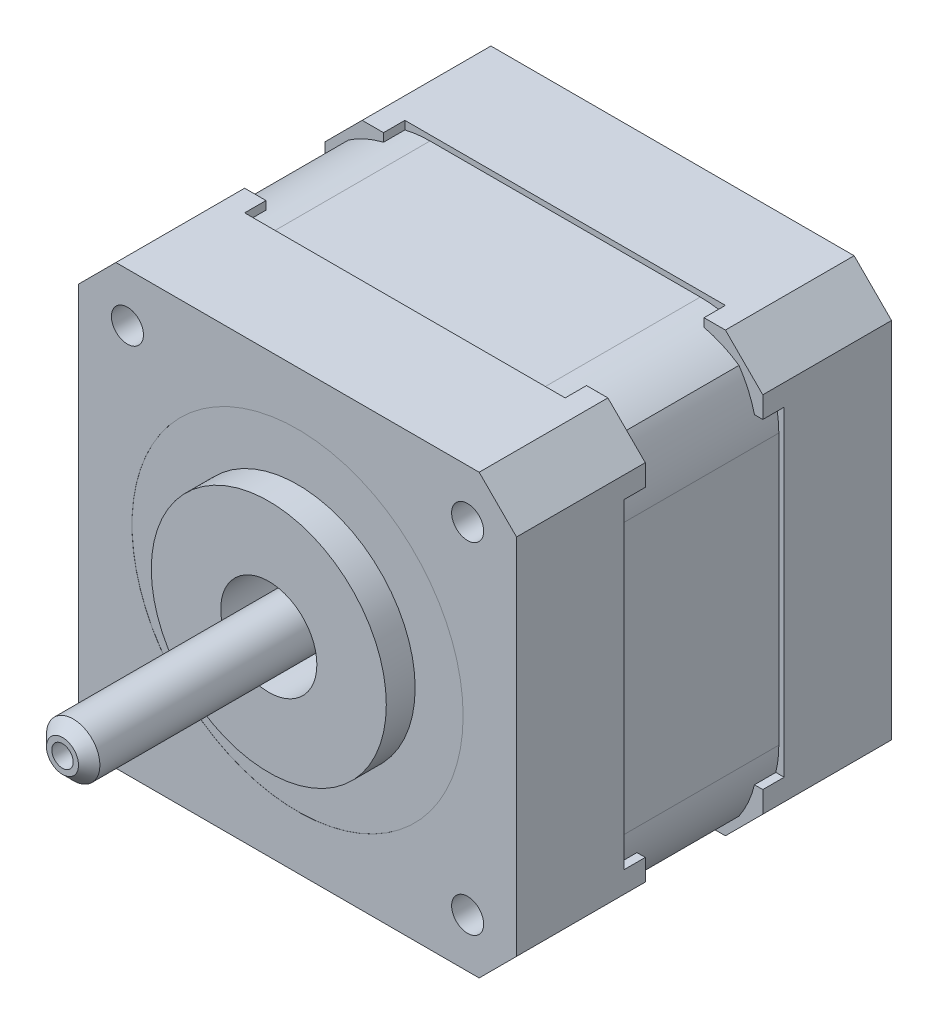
ISO-10303-21;
HEADER;
FILE_DESCRIPTION(('STEP AP214'),'2;1');
FILE_NAME('part.step','',(''),(''),'','','');
FILE_SCHEMA(('AUTOMOTIVE_DESIGN { 1 0 10303 214 1 1 1 1 }'));
ENDSEC;
DATA;
#1=APPLICATION_CONTEXT('core data for automotive mechanical design processes');
#2=APPLICATION_PROTOCOL_DEFINITION('international standard','automotive_design',2000,#1);
#3=PRODUCT_CONTEXT('',#1,'mechanical');
#4=PRODUCT('Part','Part','',(#3));
#5=PRODUCT_RELATED_PRODUCT_CATEGORY('part','',(#4));
#6=PRODUCT_DEFINITION_FORMATION('','',#4);
#7=PRODUCT_DEFINITION_CONTEXT('part definition',#1,'design');
#8=PRODUCT_DEFINITION('design','',#6,#7);
#9=PRODUCT_DEFINITION_SHAPE('','',#8);
#10=(LENGTH_UNIT() NAMED_UNIT(*) SI_UNIT(.MILLI.,.METRE.));
#11=(NAMED_UNIT(*) PLANE_ANGLE_UNIT() SI_UNIT($,.RADIAN.));
#12=(NAMED_UNIT(*) SI_UNIT($,.STERADIAN.) SOLID_ANGLE_UNIT());
#13=UNCERTAINTY_MEASURE_WITH_UNIT(LENGTH_MEASURE(1.E-05),#10,'distance_accuracy_value','');
#14=(GEOMETRIC_REPRESENTATION_CONTEXT(3) GLOBAL_UNCERTAINTY_ASSIGNED_CONTEXT((#13)) GLOBAL_UNIT_ASSIGNED_CONTEXT((#10,
#11,#12)) REPRESENTATION_CONTEXT('',''));
#15=CARTESIAN_POINT('',(0.,0.,0.));
#16=DIRECTION('',(0.,0.,1.));
#17=DIRECTION('',(1.,0.,0.));
#18=AXIS2_PLACEMENT_3D('',#15,#16,#17);
#19=CARTESIAN_POINT('',(15.,5.49999999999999,-24.55));
#20=DIRECTION('',(0.,0.,-1.));
#21=DIRECTION('',(-1.,0.,0.));
#22=AXIS2_PLACEMENT_3D('',#19,#20,#21);
#23=PLANE('',#22);
#24=CARTESIAN_POINT('',(15.,5.49999999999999,-24.55));
#25=DIRECTION('',(0.,0.,-1.));
#26=DIRECTION('',(-1.,0.,0.));
#27=AXIS2_PLACEMENT_3D('',#24,#25,#26);
#28=CIRCLE('',#27,1.50000000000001);
#29=CARTESIAN_POINT('',(13.5,5.49999999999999,-24.55));
#30=VERTEX_POINT('',#29);
#31=EDGE_CURVE('E1666',#30,#30,#28,.T.);
#32=ORIENTED_EDGE('',*,*,#31,.T.);
#33=EDGE_LOOP('',(#32));
#34=FACE_BOUND('',#33,.T.);
#35=DIRECTION('',(0.,1.,0.));
#36=VECTOR('',#35,1.);
#37=CARTESIAN_POINT('',(15.15,0.,-24.55));
#38=LINE('',#37,#36);
#39=CARTESIAN_POINT('',(15.15,5.65,-24.55));
#40=VERTEX_POINT('',#39);
#41=CARTESIAN_POINT('',(15.15,6.5,-24.55));
#42=VERTEX_POINT('',#41);
#43=EDGE_CURVE('E788',#40,#42,#38,.T.);
#44=ORIENTED_EDGE('',*,*,#43,.T.);
#45=DIRECTION('',(-1.,0.,0.));
#46=VECTOR('',#45,1.);
#47=CARTESIAN_POINT('',(0.,6.5,-24.55));
#48=LINE('',#47,#46);
#49=CARTESIAN_POINT('',(14.85,6.5,-24.55));
#50=VERTEX_POINT('',#49);
#51=EDGE_CURVE('E51',#42,#50,#48,.T.);
#52=ORIENTED_EDGE('',*,*,#51,.T.);
#53=DIRECTION('',(0.,1.,0.));
#54=VECTOR('',#53,1.);
#55=CARTESIAN_POINT('',(14.85,0.,-24.55));
#56=LINE('',#55,#54);
#57=CARTESIAN_POINT('',(14.85,5.65,-24.55));
#58=VERTEX_POINT('',#57);
#59=EDGE_CURVE('E758',#58,#50,#56,.T.);
#60=ORIENTED_EDGE('',*,*,#59,.F.);
#61=DIRECTION('',(-1.,0.,0.));
#62=VECTOR('',#61,1.);
#63=CARTESIAN_POINT('',(0.,5.65000000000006,-24.55));
#64=LINE('',#63,#62);
#65=CARTESIAN_POINT('',(14.,5.65,-24.55));
#66=VERTEX_POINT('',#65);
#67=EDGE_CURVE('E761',#58,#66,#64,.T.);
#68=ORIENTED_EDGE('',*,*,#67,.T.);
#69=DIRECTION('',(0.,-1.,0.));
#70=VECTOR('',#69,1.);
#71=CARTESIAN_POINT('',(14.,0.,-24.55));
#72=LINE('',#71,#70);
#73=CARTESIAN_POINT('',(14.,5.35,-24.55));
#74=VERTEX_POINT('',#73);
#75=EDGE_CURVE('E811',#66,#74,#72,.T.);
#76=ORIENTED_EDGE('',*,*,#75,.T.);
#77=DIRECTION('',(-1.,0.,0.));
#78=VECTOR('',#77,1.);
#79=CARTESIAN_POINT('',(0.,5.35000000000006,-24.55));
#80=LINE('',#79,#78);
#81=CARTESIAN_POINT('',(14.85,5.35,-24.55));
#82=VERTEX_POINT('',#81);
#83=EDGE_CURVE('E808',#82,#74,#80,.T.);
#84=ORIENTED_EDGE('',*,*,#83,.F.);
#85=DIRECTION('',(0.,-1.,0.));
#86=VECTOR('',#85,1.);
#87=CARTESIAN_POINT('',(14.85,0.,-24.55));
#88=LINE('',#87,#86);
#89=CARTESIAN_POINT('',(14.85,4.5,-24.55));
#90=VERTEX_POINT('',#89);
#91=EDGE_CURVE('E805',#82,#90,#88,.T.);
#92=ORIENTED_EDGE('',*,*,#91,.T.);
#93=DIRECTION('',(1.,0.,0.));
#94=VECTOR('',#93,1.);
#95=CARTESIAN_POINT('',(0.,4.5,-24.55));
#96=LINE('',#95,#94);
#97=CARTESIAN_POINT('',(15.15,4.5,-24.55));
#98=VERTEX_POINT('',#97);
#99=EDGE_CURVE('E802',#90,#98,#96,.T.);
#100=ORIENTED_EDGE('',*,*,#99,.T.);
#101=DIRECTION('',(0.,-1.,0.));
#102=VECTOR('',#101,1.);
#103=CARTESIAN_POINT('',(15.15,0.,-24.55));
#104=LINE('',#103,#102);
#105=CARTESIAN_POINT('',(15.15,5.35,-24.55));
#106=VERTEX_POINT('',#105);
#107=EDGE_CURVE('E799',#106,#98,#104,.T.);
#108=ORIENTED_EDGE('',*,*,#107,.F.);
#109=DIRECTION('',(1.,0.,0.));
#110=VECTOR('',#109,1.);
#111=CARTESIAN_POINT('',(0.,5.35,-24.55));
#112=LINE('',#111,#110);
#113=CARTESIAN_POINT('',(16.,5.35,-24.55));
#114=VERTEX_POINT('',#113);
#115=EDGE_CURVE('E796',#106,#114,#112,.T.);
#116=ORIENTED_EDGE('',*,*,#115,.T.);
#117=DIRECTION('',(0.,1.,0.));
#118=VECTOR('',#117,1.);
#119=CARTESIAN_POINT('',(16.,0.,-24.55));
#120=LINE('',#119,#118);
#121=CARTESIAN_POINT('',(16.,5.65,-24.55));
#122=VERTEX_POINT('',#121);
#123=EDGE_CURVE('E793',#114,#122,#120,.T.);
#124=ORIENTED_EDGE('',*,*,#123,.T.);
#125=DIRECTION('',(1.,0.,0.));
#126=VECTOR('',#125,1.);
#127=CARTESIAN_POINT('',(0.,5.65,-24.55));
#128=LINE('',#127,#126);
#129=EDGE_CURVE('E790',#40,#122,#128,.T.);
#130=ORIENTED_EDGE('',*,*,#129,.F.);
#131=EDGE_LOOP('',(#44,#52,#60,#68,#76,#84,#92,#100,#108,#116,#124,#130));
#132=FACE_BOUND('',#131,.T.);
#133=ADVANCED_FACE('F36',(#34,#132),#23,.T.);
#134=CARTESIAN_POINT('',(-15.,5.5,-24.55));
#135=DIRECTION('',(0.,0.,1.));
#136=DIRECTION('',(1.,0.,0.));
#137=AXIS2_PLACEMENT_3D('',#134,#135,#136);
#138=PLANE('',#137);
#139=CARTESIAN_POINT('',(-15.,5.5,-24.55));
#140=DIRECTION('',(0.,0.,1.));
#141=DIRECTION('',(1.,0.,0.));
#142=AXIS2_PLACEMENT_3D('',#139,#140,#141);
#143=CIRCLE('',#142,1.5);
#144=CARTESIAN_POINT('',(-13.5,5.5,-24.55));
#145=VERTEX_POINT('',#144);
#146=EDGE_CURVE('E1669',#145,#145,#143,.F.);
#147=ORIENTED_EDGE('',*,*,#146,.T.);
#148=EDGE_LOOP('',(#147));
#149=FACE_BOUND('',#148,.T.);
#150=DIRECTION('',(0.,-1.,0.));
#151=VECTOR('',#150,1.);
#152=CARTESIAN_POINT('',(-15.15,0.,-24.55));
#153=LINE('',#152,#151);
#154=CARTESIAN_POINT('',(-15.15,5.35,-24.55));
#155=VERTEX_POINT('',#154);
#156=CARTESIAN_POINT('',(-15.15,4.5,-24.55));
#157=VERTEX_POINT('',#156);
#158=EDGE_CURVE('E59',#155,#157,#153,.T.);
#159=ORIENTED_EDGE('',*,*,#158,.T.);
#160=DIRECTION('',(-1.,0.,0.));
#161=VECTOR('',#160,1.);
#162=CARTESIAN_POINT('',(0.,4.5,-24.55));
#163=LINE('',#162,#161);
#164=CARTESIAN_POINT('',(-14.85,4.5,-24.55));
#165=VERTEX_POINT('',#164);
#166=EDGE_CURVE('E840',#165,#157,#163,.T.);
#167=ORIENTED_EDGE('',*,*,#166,.F.);
#168=DIRECTION('',(0.,-1.,0.));
#169=VECTOR('',#168,1.);
#170=CARTESIAN_POINT('',(-14.85,0.,-24.55));
#171=LINE('',#170,#169);
#172=CARTESIAN_POINT('',(-14.85,5.35,-24.55));
#173=VERTEX_POINT('',#172);
#174=EDGE_CURVE('E899',#173,#165,#171,.T.);
#175=ORIENTED_EDGE('',*,*,#174,.F.);
#176=DIRECTION('',(1.,0.,0.));
#177=VECTOR('',#176,1.);
#178=CARTESIAN_POINT('',(0.,5.35,-24.55));
#179=LINE('',#178,#177);
#180=CARTESIAN_POINT('',(-14.,5.35,-24.55));
#181=VERTEX_POINT('',#180);
#182=EDGE_CURVE('E896',#173,#181,#179,.T.);
#183=ORIENTED_EDGE('',*,*,#182,.T.);
#184=DIRECTION('',(0.,-1.,0.));
#185=VECTOR('',#184,1.);
#186=CARTESIAN_POINT('',(-14.,0.,-24.55));
#187=LINE('',#186,#185);
#188=CARTESIAN_POINT('',(-14.,5.65,-24.55));
#189=VERTEX_POINT('',#188);
#190=EDGE_CURVE('E893',#189,#181,#187,.T.);
#191=ORIENTED_EDGE('',*,*,#190,.F.);
#192=DIRECTION('',(1.,0.,0.));
#193=VECTOR('',#192,1.);
#194=CARTESIAN_POINT('',(0.,5.65,-24.55));
#195=LINE('',#194,#193);
#196=CARTESIAN_POINT('',(-14.85,5.65,-24.55));
#197=VERTEX_POINT('',#196);
#198=EDGE_CURVE('E890',#197,#189,#195,.T.);
#199=ORIENTED_EDGE('',*,*,#198,.F.);
#200=DIRECTION('',(0.,1.,0.));
#201=VECTOR('',#200,1.);
#202=CARTESIAN_POINT('',(-14.85,0.,-24.55));
#203=LINE('',#202,#201);
#204=CARTESIAN_POINT('',(-14.85,6.5,-24.55));
#205=VERTEX_POINT('',#204);
#206=EDGE_CURVE('E887',#197,#205,#203,.T.);
#207=ORIENTED_EDGE('',*,*,#206,.T.);
#208=DIRECTION('',(1.,0.,0.));
#209=VECTOR('',#208,1.);
#210=CARTESIAN_POINT('',(0.,6.5,-24.55));
#211=LINE('',#210,#209);
#212=CARTESIAN_POINT('',(-15.15,6.5,-24.55));
#213=VERTEX_POINT('',#212);
#214=EDGE_CURVE('E884',#213,#205,#211,.T.);
#215=ORIENTED_EDGE('',*,*,#214,.F.);
#216=DIRECTION('',(0.,1.,0.));
#217=VECTOR('',#216,1.);
#218=CARTESIAN_POINT('',(-15.15,0.,-24.55));
#219=LINE('',#218,#217);
#220=CARTESIAN_POINT('',(-15.15,5.65,-24.55));
#221=VERTEX_POINT('',#220);
#222=EDGE_CURVE('E881',#221,#213,#219,.T.);
#223=ORIENTED_EDGE('',*,*,#222,.F.);
#224=DIRECTION('',(-1.,0.,0.));
#225=VECTOR('',#224,1.);
#226=CARTESIAN_POINT('',(0.,5.65,-24.55));
#227=LINE('',#226,#225);
#228=CARTESIAN_POINT('',(-16.,5.65,-24.55));
#229=VERTEX_POINT('',#228);
#230=EDGE_CURVE('E878',#221,#229,#227,.T.);
#231=ORIENTED_EDGE('',*,*,#230,.T.);
#232=DIRECTION('',(0.,1.,0.));
#233=VECTOR('',#232,1.);
#234=CARTESIAN_POINT('',(-16.,0.,-24.55));
#235=LINE('',#234,#233);
#236=CARTESIAN_POINT('',(-16.,5.35,-24.55));
#237=VERTEX_POINT('',#236);
#238=EDGE_CURVE('E875',#237,#229,#235,.T.);
#239=ORIENTED_EDGE('',*,*,#238,.F.);
#240=DIRECTION('',(-1.,0.,0.));
#241=VECTOR('',#240,1.);
#242=CARTESIAN_POINT('',(0.,5.35,-24.55));
#243=LINE('',#242,#241);
#244=EDGE_CURVE('E872',#155,#237,#243,.T.);
#245=ORIENTED_EDGE('',*,*,#244,.F.);
#246=EDGE_LOOP('',(#159,#167,#175,#183,#191,#199,#207,#215,#223,#231,#239,#245));
#247=FACE_BOUND('',#246,.T.);
#248=ADVANCED_FACE('F1697',(#149,#247),#138,.F.);
#249=CARTESIAN_POINT('',(-15.,35.5,-24.55));
#250=DIRECTION('',(0.,0.,-1.));
#251=DIRECTION('',(-1.,0.,0.));
#252=AXIS2_PLACEMENT_3D('',#249,#250,#251);
#253=PLANE('',#252);
#254=CARTESIAN_POINT('',(-15.,35.5,-24.55));
#255=DIRECTION('',(0.,0.,-1.));
#256=DIRECTION('',(-1.,0.,0.));
#257=AXIS2_PLACEMENT_3D('',#254,#255,#256);
#258=CIRCLE('',#257,1.5);
#259=CARTESIAN_POINT('',(-16.5,35.5,-24.55));
#260=VERTEX_POINT('',#259);
#261=EDGE_CURVE('E1672',#260,#260,#258,.T.);
#262=ORIENTED_EDGE('',*,*,#261,.T.);
#263=EDGE_LOOP('',(#262));
#264=FACE_BOUND('',#263,.T.);
#265=DIRECTION('',(1.,0.,0.));
#266=VECTOR('',#265,1.);
#267=CARTESIAN_POINT('',(0.,35.35,-24.55));
#268=LINE('',#267,#266);
#269=CARTESIAN_POINT('',(-14.85,35.35,-24.55));
#270=VERTEX_POINT('',#269);
#271=CARTESIAN_POINT('',(-14.,35.35,-24.55));
#272=VERTEX_POINT('',#271);
#273=EDGE_CURVE('E960',#270,#272,#268,.T.);
#274=ORIENTED_EDGE('',*,*,#273,.T.);
#275=DIRECTION('',(0.,1.,0.));
#276=VECTOR('',#275,1.);
#277=CARTESIAN_POINT('',(-14.,0.,-24.55));
#278=LINE('',#277,#276);
#279=CARTESIAN_POINT('',(-14.,35.65,-24.55));
#280=VERTEX_POINT('',#279);
#281=EDGE_CURVE('E906',#272,#280,#278,.T.);
#282=ORIENTED_EDGE('',*,*,#281,.T.);
#283=DIRECTION('',(1.,0.,0.));
#284=VECTOR('',#283,1.);
#285=CARTESIAN_POINT('',(0.,35.65,-24.55));
#286=LINE('',#285,#284);
#287=CARTESIAN_POINT('',(-14.85,35.65,-24.55));
#288=VERTEX_POINT('',#287);
#289=EDGE_CURVE('E931',#288,#280,#286,.T.);
#290=ORIENTED_EDGE('',*,*,#289,.F.);
#291=DIRECTION('',(0.,1.,0.));
#292=VECTOR('',#291,1.);
#293=CARTESIAN_POINT('',(-14.85,0.,-24.55));
#294=LINE('',#293,#292);
#295=CARTESIAN_POINT('',(-14.85,36.5,-24.55));
#296=VERTEX_POINT('',#295);
#297=EDGE_CURVE('E987',#288,#296,#294,.T.);
#298=ORIENTED_EDGE('',*,*,#297,.T.);
#299=DIRECTION('',(-1.,0.,0.));
#300=VECTOR('',#299,1.);
#301=CARTESIAN_POINT('',(0.,36.5,-24.55));
#302=LINE('',#301,#300);
#303=CARTESIAN_POINT('',(-15.15,36.5,-24.55));
#304=VERTEX_POINT('',#303);
#305=EDGE_CURVE('E984',#296,#304,#302,.T.);
#306=ORIENTED_EDGE('',*,*,#305,.T.);
#307=DIRECTION('',(0.,1.,0.));
#308=VECTOR('',#307,1.);
#309=CARTESIAN_POINT('',(-15.15,0.,-24.55));
#310=LINE('',#309,#308);
#311=CARTESIAN_POINT('',(-15.15,35.65,-24.55));
#312=VERTEX_POINT('',#311);
#313=EDGE_CURVE('E981',#312,#304,#310,.T.);
#314=ORIENTED_EDGE('',*,*,#313,.F.);
#315=DIRECTION('',(-1.,0.,0.));
#316=VECTOR('',#315,1.);
#317=CARTESIAN_POINT('',(0.,35.65,-24.55));
#318=LINE('',#317,#316);
#319=CARTESIAN_POINT('',(-16.,35.65,-24.55));
#320=VERTEX_POINT('',#319);
#321=EDGE_CURVE('E978',#312,#320,#318,.T.);
#322=ORIENTED_EDGE('',*,*,#321,.T.);
#323=DIRECTION('',(0.,-1.,0.));
#324=VECTOR('',#323,1.);
#325=CARTESIAN_POINT('',(-16.,0.,-24.55));
#326=LINE('',#325,#324);
#327=CARTESIAN_POINT('',(-16.,35.35,-24.55));
#328=VERTEX_POINT('',#327);
#329=EDGE_CURVE('E975',#320,#328,#326,.T.);
#330=ORIENTED_EDGE('',*,*,#329,.T.);
#331=DIRECTION('',(-1.,0.,0.));
#332=VECTOR('',#331,1.);
#333=CARTESIAN_POINT('',(0.,35.35,-24.55));
#334=LINE('',#333,#332);
#335=CARTESIAN_POINT('',(-15.15,35.35,-24.55));
#336=VERTEX_POINT('',#335);
#337=EDGE_CURVE('E972',#336,#328,#334,.T.);
#338=ORIENTED_EDGE('',*,*,#337,.F.);
#339=DIRECTION('',(0.,-1.,0.));
#340=VECTOR('',#339,1.);
#341=CARTESIAN_POINT('',(-15.15,0.,-24.55));
#342=LINE('',#341,#340);
#343=CARTESIAN_POINT('',(-15.15,34.5,-24.55));
#344=VERTEX_POINT('',#343);
#345=EDGE_CURVE('E969',#336,#344,#342,.T.);
#346=ORIENTED_EDGE('',*,*,#345,.T.);
#347=DIRECTION('',(1.,0.,0.));
#348=VECTOR('',#347,1.);
#349=CARTESIAN_POINT('',(0.,34.5,-24.55));
#350=LINE('',#349,#348);
#351=CARTESIAN_POINT('',(-14.85,34.5,-24.55));
#352=VERTEX_POINT('',#351);
#353=EDGE_CURVE('E966',#344,#352,#350,.T.);
#354=ORIENTED_EDGE('',*,*,#353,.T.);
#355=DIRECTION('',(0.,-1.,0.));
#356=VECTOR('',#355,1.);
#357=CARTESIAN_POINT('',(-14.85,0.,-24.55));
#358=LINE('',#357,#356);
#359=EDGE_CURVE('E963',#270,#352,#358,.T.);
#360=ORIENTED_EDGE('',*,*,#359,.F.);
#361=EDGE_LOOP('',(#274,#282,#290,#298,#306,#314,#322,#330,#338,#346,#354,#360));
#362=FACE_BOUND('',#361,.T.);
#363=ADVANCED_FACE('F1703',(#264,#362),#253,.T.);
#364=CARTESIAN_POINT('',(15.,35.5,-24.55));
#365=DIRECTION('',(0.,0.,1.));
#366=DIRECTION('',(1.,0.,0.));
#367=AXIS2_PLACEMENT_3D('',#364,#365,#366);
#368=PLANE('',#367);
#369=CARTESIAN_POINT('',(15.,35.5,-24.55));
#370=DIRECTION('',(0.,0.,1.));
#371=DIRECTION('',(1.,0.,0.));
#372=AXIS2_PLACEMENT_3D('',#369,#370,#371);
#373=CIRCLE('',#372,1.5);
#374=CARTESIAN_POINT('',(16.5,35.5,-24.55));
#375=VERTEX_POINT('',#374);
#376=EDGE_CURVE('E1675',#375,#375,#373,.F.);
#377=ORIENTED_EDGE('',*,*,#376,.T.);
#378=EDGE_LOOP('',(#377));
#379=FACE_BOUND('',#378,.T.);
#380=DIRECTION('',(0.,1.,0.));
#381=VECTOR('',#380,1.);
#382=CARTESIAN_POINT('',(15.15,0.,-24.55));
#383=LINE('',#382,#381);
#384=CARTESIAN_POINT('',(15.15,35.65,-24.55));
#385=VERTEX_POINT('',#384);
#386=CARTESIAN_POINT('',(15.15,36.5,-24.55));
#387=VERTEX_POINT('',#386);
#388=EDGE_CURVE('E994',#385,#387,#383,.T.);
#389=ORIENTED_EDGE('',*,*,#388,.T.);
#390=DIRECTION('',(1.,0.,0.));
#391=VECTOR('',#390,1.);
#392=CARTESIAN_POINT('',(0.,36.5,-24.55));
#393=LINE('',#392,#391);
#394=CARTESIAN_POINT('',(14.85,36.5,-24.55));
#395=VERTEX_POINT('',#394);
#396=EDGE_CURVE('E1020',#395,#387,#393,.T.);
#397=ORIENTED_EDGE('',*,*,#396,.F.);
#398=DIRECTION('',(0.,1.,0.));
#399=VECTOR('',#398,1.);
#400=CARTESIAN_POINT('',(14.85,0.,-24.55));
#401=LINE('',#400,#399);
#402=CARTESIAN_POINT('',(14.85,35.65,-24.55));
#403=VERTEX_POINT('',#402);
#404=EDGE_CURVE('E1080',#403,#395,#401,.T.);
#405=ORIENTED_EDGE('',*,*,#404,.F.);
#406=DIRECTION('',(-1.,0.,0.));
#407=VECTOR('',#406,1.);
#408=CARTESIAN_POINT('',(0.,35.65,-24.55));
#409=LINE('',#408,#407);
#410=CARTESIAN_POINT('',(14.,35.65,-24.55));
#411=VERTEX_POINT('',#410);
#412=EDGE_CURVE('E1077',#403,#411,#409,.T.);
#413=ORIENTED_EDGE('',*,*,#412,.T.);
#414=DIRECTION('',(0.,1.,0.));
#415=VECTOR('',#414,1.);
#416=CARTESIAN_POINT('',(14.,0.,-24.55));
#417=LINE('',#416,#415);
#418=CARTESIAN_POINT('',(14.,35.35,-24.55));
#419=VERTEX_POINT('',#418);
#420=EDGE_CURVE('E1074',#419,#411,#417,.T.);
#421=ORIENTED_EDGE('',*,*,#420,.F.);
#422=DIRECTION('',(-1.,0.,0.));
#423=VECTOR('',#422,1.);
#424=CARTESIAN_POINT('',(0.,35.35,-24.55));
#425=LINE('',#424,#423);
#426=CARTESIAN_POINT('',(14.85,35.35,-24.55));
#427=VERTEX_POINT('',#426);
#428=EDGE_CURVE('E1071',#427,#419,#425,.T.);
#429=ORIENTED_EDGE('',*,*,#428,.F.);
#430=DIRECTION('',(0.,-1.,0.));
#431=VECTOR('',#430,1.);
#432=CARTESIAN_POINT('',(14.8499999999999,0.,-24.55));
#433=LINE('',#432,#431);
#434=CARTESIAN_POINT('',(14.85,34.5,-24.55));
#435=VERTEX_POINT('',#434);
#436=EDGE_CURVE('E1068',#427,#435,#433,.T.);
#437=ORIENTED_EDGE('',*,*,#436,.T.);
#438=DIRECTION('',(-1.,0.,0.));
#439=VECTOR('',#438,1.);
#440=CARTESIAN_POINT('',(0.,34.5,-24.55));
#441=LINE('',#440,#439);
#442=CARTESIAN_POINT('',(15.15,34.5,-24.55));
#443=VERTEX_POINT('',#442);
#444=EDGE_CURVE('E1065',#443,#435,#441,.T.);
#445=ORIENTED_EDGE('',*,*,#444,.F.);
#446=DIRECTION('',(0.,-1.,0.));
#447=VECTOR('',#446,1.);
#448=CARTESIAN_POINT('',(15.1499999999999,0.,-24.55));
#449=LINE('',#448,#447);
#450=CARTESIAN_POINT('',(15.15,35.35,-24.55));
#451=VERTEX_POINT('',#450);
#452=EDGE_CURVE('E1062',#451,#443,#449,.T.);
#453=ORIENTED_EDGE('',*,*,#452,.F.);
#454=DIRECTION('',(1.,0.,0.));
#455=VECTOR('',#454,1.);
#456=CARTESIAN_POINT('',(0.,35.35,-24.55));
#457=LINE('',#456,#455);
#458=CARTESIAN_POINT('',(16.,35.35,-24.55));
#459=VERTEX_POINT('',#458);
#460=EDGE_CURVE('E1059',#451,#459,#457,.T.);
#461=ORIENTED_EDGE('',*,*,#460,.T.);
#462=DIRECTION('',(0.,-1.,0.));
#463=VECTOR('',#462,1.);
#464=CARTESIAN_POINT('',(16.,0.,-24.55));
#465=LINE('',#464,#463);
#466=CARTESIAN_POINT('',(16.,35.65,-24.55));
#467=VERTEX_POINT('',#466);
#468=EDGE_CURVE('E1056',#467,#459,#465,.T.);
#469=ORIENTED_EDGE('',*,*,#468,.F.);
#470=DIRECTION('',(1.,0.,0.));
#471=VECTOR('',#470,1.);
#472=CARTESIAN_POINT('',(0.,35.65,-24.55));
#473=LINE('',#472,#471);
#474=EDGE_CURVE('E1053',#385,#467,#473,.T.);
#475=ORIENTED_EDGE('',*,*,#474,.F.);
#476=EDGE_LOOP('',(#389,#397,#405,#413,#421,#429,#437,#445,#453,#461,#469,#475));
#477=FACE_BOUND('',#476,.T.);
#478=ADVANCED_FACE('F1711',(#379,#477),#368,.F.);
#479=CARTESIAN_POINT('',(0.,0.,-15.));
#480=DIRECTION('',(0.,0.,-1.));
#481=DIRECTION('',(-1.,0.,0.));
#482=AXIS2_PLACEMENT_3D('',#479,#480,#481);
#483=PLANE('',#482);
#484=DIRECTION('',(0.,-1.,0.));
#485=VECTOR('',#484,1.);
#486=CARTESIAN_POINT('',(14.9999999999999,0.,-15.));
#487=LINE('',#486,#485);
#488=CARTESIAN_POINT('',(15.,41.,-15.));
#489=VERTEX_POINT('',#488);
#490=CARTESIAN_POINT('',(15.,40.2201368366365,-15.));
#491=VERTEX_POINT('',#490);
#492=EDGE_CURVE('E1197',#489,#491,#487,.T.);
#493=ORIENTED_EDGE('',*,*,#492,.F.);
#494=DIRECTION('',(1.,0.,0.));
#495=VECTOR('',#494,1.);
#496=CARTESIAN_POINT('',(-17.,41.,-15.));
#497=LINE('',#496,#495);
#498=CARTESIAN_POINT('',(-15.,41.,-15.));
#499=VERTEX_POINT('',#498);
#500=EDGE_CURVE('E1283',#499,#489,#497,.T.);
#501=ORIENTED_EDGE('',*,*,#500,.F.);
#502=DIRECTION('',(0.,-1.,0.));
#503=VECTOR('',#502,1.);
#504=CARTESIAN_POINT('',(-14.9999999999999,0.,-15.));
#505=LINE('',#504,#503);
#506=CARTESIAN_POINT('',(-15.,40.2201368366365,-15.));
#507=VERTEX_POINT('',#506);
#508=EDGE_CURVE('E1262',#499,#507,#505,.T.);
#509=ORIENTED_EDGE('',*,*,#508,.T.);
#510=CARTESIAN_POINT('',(-12.6507575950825,30.5,-15.));
#511=DIRECTION('',(0.,0.,-1.));
#512=DIRECTION('',(-1.,0.,0.));
#513=AXIS2_PLACEMENT_3D('',#510,#511,#512);
#514=CIRCLE('',#513,10.);
#515=CARTESIAN_POINT('',(-12.6507575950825,40.5,-15.));
#516=VERTEX_POINT('',#515);
#517=EDGE_CURVE('E1576',#507,#516,#514,.T.);
#518=ORIENTED_EDGE('',*,*,#517,.T.);
#519=DIRECTION('',(1.,0.,0.));
#520=VECTOR('',#519,1.);
#521=CARTESIAN_POINT('',(0.,40.5,-15.));
#522=LINE('',#521,#520);
#523=CARTESIAN_POINT('',(12.6507575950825,40.5,-15.));
#524=VERTEX_POINT('',#523);
#525=EDGE_CURVE('E1326',#516,#524,#522,.T.);
#526=ORIENTED_EDGE('',*,*,#525,.T.);
#527=CARTESIAN_POINT('',(12.6507575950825,30.5,-15.));
#528=DIRECTION('',(0.,0.,-1.));
#529=DIRECTION('',(-1.,0.,0.));
#530=AXIS2_PLACEMENT_3D('',#527,#528,#529);
#531=CIRCLE('',#530,10.);
#532=EDGE_CURVE('E1586',#524,#491,#531,.T.);
#533=ORIENTED_EDGE('',*,*,#532,.T.);
#534=EDGE_LOOP('',(#493,#501,#509,#518,#526,#533));
#535=FACE_BOUND('',#534,.T.);
#536=ADVANCED_FACE('F1853',(#535),#483,.F.);
#537=CARTESIAN_POINT('',(0.,40.5,-15.));
#538=DIRECTION('',(0.,-1.,0.));
#539=DIRECTION('',(0.,0.,-1.));
#540=AXIS2_PLACEMENT_3D('',#537,#538,#539);
#541=PLANE('',#540);
#542=ORIENTED_EDGE('',*,*,#525,.F.);
#543=DIRECTION('',(0.,0.,1.));
#544=VECTOR('',#543,1.);
#545=CARTESIAN_POINT('',(-12.6507575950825,40.5,-15.));
#546=LINE('',#545,#544);
#547=CARTESIAN_POINT('',(-12.6507575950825,40.5,0.));
#548=VERTEX_POINT('',#547);
#549=EDGE_CURVE('E3364',#516,#548,#546,.T.);
#550=ORIENTED_EDGE('',*,*,#549,.T.);
#551=DIRECTION('',(1.,0.,0.));
#552=VECTOR('',#551,1.);
#553=CARTESIAN_POINT('',(0.,40.5,0.));
#554=LINE('',#553,#552);
#555=CARTESIAN_POINT('',(12.6507575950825,40.5,0.));
#556=VERTEX_POINT('',#555);
#557=EDGE_CURVE('E1325',#548,#556,#554,.T.);
#558=ORIENTED_EDGE('',*,*,#557,.T.);
#559=DIRECTION('',(0.,0.,1.));
#560=VECTOR('',#559,1.);
#561=CARTESIAN_POINT('',(12.6507575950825,40.5,-15.));
#562=LINE('',#561,#560);
#563=EDGE_CURVE('E3368',#556,#524,#562,.F.);
#564=ORIENTED_EDGE('',*,*,#563,.T.);
#565=EDGE_LOOP('',(#542,#550,#558,#564));
#566=FACE_BOUND('',#565,.T.);
#567=ADVANCED_FACE('F1899',(#566),#541,.F.);
#568=DIRECTION('',(0.,-1.,0.));
#569=VECTOR('',#568,1.);
#570=CARTESIAN_POINT('',(20.5,37.5,-15.));
#571=LINE('',#570,#569);
#572=CARTESIAN_POINT('',(20.5,35.5,-15.));
#573=VERTEX_POINT('',#572);
#574=CARTESIAN_POINT('',(20.5,5.50000000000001,-15.));
#575=VERTEX_POINT('',#574);
#576=EDGE_CURVE('E1305',#573,#575,#571,.T.);
#577=ORIENTED_EDGE('',*,*,#576,.F.);
#578=DIRECTION('',(-1.,0.,0.));
#579=VECTOR('',#578,1.);
#580=CARTESIAN_POINT('',(0.,35.5,-15.));
#581=LINE('',#580,#579);
#582=CARTESIAN_POINT('',(19.7201368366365,35.5,-15.));
#583=VERTEX_POINT('',#582);
#584=EDGE_CURVE('E1208',#573,#583,#581,.T.);
#585=ORIENTED_EDGE('',*,*,#584,.T.);
#586=CARTESIAN_POINT('',(10.,33.1507575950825,-15.));
#587=DIRECTION('',(0.,0.,-1.));
#588=DIRECTION('',(-1.,0.,0.));
#589=AXIS2_PLACEMENT_3D('',#586,#587,#588);
#590=CIRCLE('',#589,10.);
#591=CARTESIAN_POINT('',(20.,33.1507575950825,-15.));
#592=VERTEX_POINT('',#591);
#593=EDGE_CURVE('E1608',#583,#592,#590,.T.);
#594=ORIENTED_EDGE('',*,*,#593,.T.);
#595=DIRECTION('',(0.,-1.,0.));
#596=VECTOR('',#595,1.);
#597=CARTESIAN_POINT('',(20.,0.,-15.));
#598=LINE('',#597,#596);
#599=CARTESIAN_POINT('',(20.,7.84924240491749,-15.));
#600=VERTEX_POINT('',#599);
#601=EDGE_CURVE('E1329',#592,#600,#598,.T.);
#602=ORIENTED_EDGE('',*,*,#601,.T.);
#603=CARTESIAN_POINT('',(10.,7.84924240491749,-15.));
#604=DIRECTION('',(0.,0.,-1.));
#605=DIRECTION('',(-1.,0.,0.));
#606=AXIS2_PLACEMENT_3D('',#603,#604,#605);
#607=CIRCLE('',#606,10.);
#608=CARTESIAN_POINT('',(19.7201368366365,5.50000000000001,-15.));
#609=VERTEX_POINT('',#608);
#610=EDGE_CURVE('E1618',#600,#609,#607,.T.);
#611=ORIENTED_EDGE('',*,*,#610,.T.);
#612=DIRECTION('',(-1.,0.,0.));
#613=VECTOR('',#612,1.);
#614=CARTESIAN_POINT('',(0.,5.50000000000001,-15.));
#615=LINE('',#614,#613);
#616=EDGE_CURVE('E1216',#575,#609,#615,.T.);
#617=ORIENTED_EDGE('',*,*,#616,.F.);
#618=EDGE_LOOP('',(#577,#585,#594,#602,#611,#617));
#619=FACE_BOUND('',#618,.T.);
#620=ADVANCED_FACE('F1897',(#619),#483,.F.);
#621=CARTESIAN_POINT('',(20.,0.,-15.));
#622=DIRECTION('',(-1.,0.,0.));
#623=DIRECTION('',(0.,0.,1.));
#624=AXIS2_PLACEMENT_3D('',#621,#622,#623);
#625=PLANE('',#624);
#626=ORIENTED_EDGE('',*,*,#601,.F.);
#627=DIRECTION('',(0.,0.,1.));
#628=VECTOR('',#627,1.);
#629=CARTESIAN_POINT('',(20.,33.1507575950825,-15.));
#630=LINE('',#629,#628);
#631=CARTESIAN_POINT('',(20.,33.1507575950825,0.));
#632=VERTEX_POINT('',#631);
#633=EDGE_CURVE('E3357',#592,#632,#630,.T.);
#634=ORIENTED_EDGE('',*,*,#633,.T.);
#635=DIRECTION('',(0.,-1.,0.));
#636=VECTOR('',#635,1.);
#637=CARTESIAN_POINT('',(20.,0.,0.));
#638=LINE('',#637,#636);
#639=CARTESIAN_POINT('',(20.,7.84924240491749,0.));
#640=VERTEX_POINT('',#639);
#641=EDGE_CURVE('E1342',#632,#640,#638,.T.);
#642=ORIENTED_EDGE('',*,*,#641,.T.);
#643=DIRECTION('',(0.,0.,1.));
#644=VECTOR('',#643,1.);
#645=CARTESIAN_POINT('',(20.,7.84924240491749,-15.));
#646=LINE('',#645,#644);
#647=EDGE_CURVE('E3362',#640,#600,#646,.F.);
#648=ORIENTED_EDGE('',*,*,#647,.T.);
#649=EDGE_LOOP('',(#626,#634,#642,#648));
#650=FACE_BOUND('',#649,.T.);
#651=ADVANCED_FACE('F1893',(#650),#625,.F.);
#652=CARTESIAN_POINT('',(0.,0.5,-15.));
#653=DIRECTION('',(0.,1.,0.));
#654=DIRECTION('',(0.,0.,1.));
#655=AXIS2_PLACEMENT_3D('',#652,#653,#654);
#656=PLANE('',#655);
#657=DIRECTION('',(-1.,0.,0.));
#658=VECTOR('',#657,1.);
#659=CARTESIAN_POINT('',(0.,0.5,0.));
#660=LINE('',#659,#658);
#661=CARTESIAN_POINT('',(12.6507575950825,0.5,0.));
#662=VERTEX_POINT('',#661);
#663=CARTESIAN_POINT('',(-12.6507575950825,0.5,0.));
#664=VERTEX_POINT('',#663);
#665=EDGE_CURVE('E1345',#662,#664,#660,.T.);
#666=ORIENTED_EDGE('',*,*,#665,.T.);
#667=DIRECTION('',(0.,0.,1.));
#668=VECTOR('',#667,1.);
#669=CARTESIAN_POINT('',(-12.6507575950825,0.5,-15.));
#670=LINE('',#669,#668);
#671=CARTESIAN_POINT('',(-12.6507575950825,0.5,-15.));
#672=VERTEX_POINT('',#671);
#673=EDGE_CURVE('E1500',#664,#672,#670,.F.);
#674=ORIENTED_EDGE('',*,*,#673,.T.);
#675=DIRECTION('',(-1.,0.,0.));
#676=VECTOR('',#675,1.);
#677=CARTESIAN_POINT('',(0.,0.5,-15.));
#678=LINE('',#677,#676);
#679=CARTESIAN_POINT('',(12.6507575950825,0.5,-15.));
#680=VERTEX_POINT('',#679);
#681=EDGE_CURVE('E1333',#680,#672,#678,.T.);
#682=ORIENTED_EDGE('',*,*,#681,.F.);
#683=DIRECTION('',(0.,0.,1.));
#684=VECTOR('',#683,1.);
#685=CARTESIAN_POINT('',(12.6507575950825,0.5,-15.));
#686=LINE('',#685,#684);
#687=EDGE_CURVE('E1441',#680,#662,#686,.T.);
#688=ORIENTED_EDGE('',*,*,#687,.T.);
#689=EDGE_LOOP('',(#666,#674,#682,#688));
#690=FACE_BOUND('',#689,.T.);
#691=ADVANCED_FACE('F1890',(#690),#656,.F.);
#692=DIRECTION('',(-1.,0.,0.));
#693=VECTOR('',#692,1.);
#694=CARTESIAN_POINT('',(17.,0.,-15.));
#695=LINE('',#694,#693);
#696=CARTESIAN_POINT('',(15.,0.,-15.));
#697=VERTEX_POINT('',#696);
#698=CARTESIAN_POINT('',(-15.,0.,-15.));
#699=VERTEX_POINT('',#698);
#700=EDGE_CURVE('E1307',#697,#699,#695,.T.);
#701=ORIENTED_EDGE('',*,*,#700,.F.);
#702=DIRECTION('',(0.,1.,0.));
#703=VECTOR('',#702,1.);
#704=CARTESIAN_POINT('',(15.,0.,-15.));
#705=LINE('',#704,#703);
#706=CARTESIAN_POINT('',(15.,0.779863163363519,-15.));
#707=VERTEX_POINT('',#706);
#708=EDGE_CURVE('E1221',#697,#707,#705,.T.);
#709=ORIENTED_EDGE('',*,*,#708,.T.);
#710=CARTESIAN_POINT('',(12.6507575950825,10.5,-15.));
#711=DIRECTION('',(0.,0.,-1.));
#712=DIRECTION('',(-1.,0.,0.));
#713=AXIS2_PLACEMENT_3D('',#710,#711,#712);
#714=CIRCLE('',#713,10.);
#715=EDGE_CURVE('E1640',#707,#680,#714,.T.);
#716=ORIENTED_EDGE('',*,*,#715,.T.);
#717=ORIENTED_EDGE('',*,*,#681,.T.);
#718=CARTESIAN_POINT('',(-12.6507575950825,10.5,-15.));
#719=DIRECTION('',(0.,0.,-1.));
#720=DIRECTION('',(-1.,0.,0.));
#721=AXIS2_PLACEMENT_3D('',#718,#719,#720);
#722=CIRCLE('',#721,10.);
#723=CARTESIAN_POINT('',(-15.,0.779863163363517,-15.));
#724=VERTEX_POINT('',#723);
#725=EDGE_CURVE('E3379',#672,#724,#722,.T.);
#726=ORIENTED_EDGE('',*,*,#725,.T.);
#727=DIRECTION('',(0.,1.,0.));
#728=VECTOR('',#727,1.);
#729=CARTESIAN_POINT('',(-15.,0.,-15.));
#730=LINE('',#729,#728);
#731=EDGE_CURVE('E1239',#699,#724,#730,.T.);
#732=ORIENTED_EDGE('',*,*,#731,.F.);
#733=EDGE_LOOP('',(#701,#709,#716,#717,#726,#732));
#734=FACE_BOUND('',#733,.T.);
#735=ADVANCED_FACE('F1854',(#734),#483,.F.);
#736=CARTESIAN_POINT('',(-20.,0.,-15.));
#737=DIRECTION('',(1.,0.,0.));
#738=DIRECTION('',(0.,0.,-1.));
#739=AXIS2_PLACEMENT_3D('',#736,#737,#738);
#740=PLANE('',#739);
#741=DIRECTION('',(0.,1.,0.));
#742=VECTOR('',#741,1.);
#743=CARTESIAN_POINT('',(-20.,0.,-15.));
#744=LINE('',#743,#742);
#745=CARTESIAN_POINT('',(-20.,7.84924240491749,-15.));
#746=VERTEX_POINT('',#745);
#747=CARTESIAN_POINT('',(-20.,33.1507575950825,-15.));
#748=VERTEX_POINT('',#747);
#749=EDGE_CURVE('E1336',#746,#748,#744,.T.);
#750=ORIENTED_EDGE('',*,*,#749,.F.);
#751=DIRECTION('',(0.,0.,1.));
#752=VECTOR('',#751,1.);
#753=CARTESIAN_POINT('',(-20.,7.84924240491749,-15.));
#754=LINE('',#753,#752);
#755=CARTESIAN_POINT('',(-20.,7.84924240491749,0.));
#756=VERTEX_POINT('',#755);
#757=EDGE_CURVE('E3404',#746,#756,#754,.T.);
#758=ORIENTED_EDGE('',*,*,#757,.T.);
#759=DIRECTION('',(0.,1.,0.));
#760=VECTOR('',#759,1.);
#761=CARTESIAN_POINT('',(-20.,0.,0.));
#762=LINE('',#761,#760);
#763=CARTESIAN_POINT('',(-20.,33.1507575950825,0.));
#764=VERTEX_POINT('',#763);
#765=EDGE_CURVE('E1330',#756,#764,#762,.T.);
#766=ORIENTED_EDGE('',*,*,#765,.T.);
#767=DIRECTION('',(0.,0.,1.));
#768=VECTOR('',#767,1.);
#769=CARTESIAN_POINT('',(-20.,33.1507575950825,-15.));
#770=LINE('',#769,#768);
#771=EDGE_CURVE('E3410',#764,#748,#770,.F.);
#772=ORIENTED_EDGE('',*,*,#771,.T.);
#773=EDGE_LOOP('',(#750,#758,#766,#772));
#774=FACE_BOUND('',#773,.T.);
#775=ADVANCED_FACE('F1885',(#774),#740,.F.);
#776=CARTESIAN_POINT('',(0.,0.,0.));
#777=DIRECTION('',(0.,0.,-1.));
#778=DIRECTION('',(-1.,0.,0.));
#779=AXIS2_PLACEMENT_3D('',#776,#777,#778);
#780=PLANE('',#779);
#781=DIRECTION('',(0.,-1.,0.));
#782=VECTOR('',#781,1.);
#783=CARTESIAN_POINT('',(15.0000000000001,0.,0.));
#784=LINE('',#783,#782);
#785=CARTESIAN_POINT('',(15.,41.,0.));
#786=VERTEX_POINT('',#785);
#787=CARTESIAN_POINT('',(15.,40.2201368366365,0.));
#788=VERTEX_POINT('',#787);
#789=EDGE_CURVE('E1412',#786,#788,#784,.T.);
#790=ORIENTED_EDGE('',*,*,#789,.T.);
#791=CARTESIAN_POINT('',(12.6507575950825,30.5,0.));
#792=DIRECTION('',(0.,0.,-1.));
#793=DIRECTION('',(-1.,0.,0.));
#794=AXIS2_PLACEMENT_3D('',#791,#792,#793);
#795=CIRCLE('',#794,10.);
#796=EDGE_CURVE('E1584',#788,#556,#795,.F.);
#797=ORIENTED_EDGE('',*,*,#796,.T.);
#798=ORIENTED_EDGE('',*,*,#557,.F.);
#799=CARTESIAN_POINT('',(-12.6507575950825,30.5,0.));
#800=DIRECTION('',(0.,0.,-1.));
#801=DIRECTION('',(-1.,0.,0.));
#802=AXIS2_PLACEMENT_3D('',#799,#800,#801);
#803=CIRCLE('',#802,10.);
#804=CARTESIAN_POINT('',(-15.,40.2201368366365,0.));
#805=VERTEX_POINT('',#804);
#806=EDGE_CURVE('E1568',#548,#805,#803,.F.);
#807=ORIENTED_EDGE('',*,*,#806,.T.);
#808=DIRECTION('',(0.,-1.,0.));
#809=VECTOR('',#808,1.);
#810=CARTESIAN_POINT('',(-15.0000000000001,0.,0.));
#811=LINE('',#810,#809);
#812=CARTESIAN_POINT('',(-15.,41.,0.));
#813=VERTEX_POINT('',#812);
#814=EDGE_CURVE('E1396',#813,#805,#811,.T.);
#815=ORIENTED_EDGE('',*,*,#814,.F.);
#816=DIRECTION('',(-1.,0.,0.));
#817=VECTOR('',#816,1.);
#818=CARTESIAN_POINT('',(-17.,41.,0.));
#819=LINE('',#818,#817);
#820=EDGE_CURVE('E1439',#786,#813,#819,.T.);
#821=ORIENTED_EDGE('',*,*,#820,.F.);
#822=EDGE_LOOP('',(#790,#797,#798,#807,#815,#821));
#823=FACE_BOUND('',#822,.T.);
#824=ADVANCED_FACE('F1888',(#823),#780,.T.);
#825=DIRECTION('',(-1.,0.,0.));
#826=VECTOR('',#825,1.);
#827=CARTESIAN_POINT('',(0.,5.5,0.));
#828=LINE('',#827,#826);
#829=CARTESIAN_POINT('',(20.5,5.5,0.));
#830=VERTEX_POINT('',#829);
#831=CARTESIAN_POINT('',(19.7201368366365,5.5,0.));
#832=VERTEX_POINT('',#831);
#833=EDGE_CURVE('E1339',#830,#832,#828,.T.);
#834=ORIENTED_EDGE('',*,*,#833,.T.);
#835=CARTESIAN_POINT('',(10.,7.84924240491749,0.));
#836=DIRECTION('',(0.,0.,-1.));
#837=DIRECTION('',(-1.,0.,0.));
#838=AXIS2_PLACEMENT_3D('',#835,#836,#837);
#839=CIRCLE('',#838,10.);
#840=EDGE_CURVE('E1616',#832,#640,#839,.F.);
#841=ORIENTED_EDGE('',*,*,#840,.T.);
#842=ORIENTED_EDGE('',*,*,#641,.F.);
#843=CARTESIAN_POINT('',(10.,33.1507575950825,0.));
#844=DIRECTION('',(0.,0.,-1.));
#845=DIRECTION('',(-1.,0.,0.));
#846=AXIS2_PLACEMENT_3D('',#843,#844,#845);
#847=CIRCLE('',#846,10.);
#848=CARTESIAN_POINT('',(19.7201368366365,35.5,0.));
#849=VERTEX_POINT('',#848);
#850=EDGE_CURVE('E1594',#632,#849,#847,.F.);
#851=ORIENTED_EDGE('',*,*,#850,.T.);
#852=DIRECTION('',(-1.,0.,0.));
#853=VECTOR('',#852,1.);
#854=CARTESIAN_POINT('',(0.,35.5,0.));
#855=LINE('',#854,#853);
#856=CARTESIAN_POINT('',(20.5,35.5,0.));
#857=VERTEX_POINT('',#856);
#858=EDGE_CURVE('E1416',#857,#849,#855,.T.);
#859=ORIENTED_EDGE('',*,*,#858,.F.);
#860=DIRECTION('',(0.,1.,0.));
#861=VECTOR('',#860,1.);
#862=CARTESIAN_POINT('',(20.5,3.5,0.));
#863=LINE('',#862,#861);
#864=EDGE_CURVE('E1436',#830,#857,#863,.T.);
#865=ORIENTED_EDGE('',*,*,#864,.F.);
#866=EDGE_LOOP('',(#834,#841,#842,#851,#859,#865));
#867=FACE_BOUND('',#866,.T.);
#868=ADVANCED_FACE('F1951',(#867),#780,.T.);
#869=DIRECTION('',(0.,1.,0.));
#870=VECTOR('',#869,1.);
#871=CARTESIAN_POINT('',(-15.,0.,0.));
#872=LINE('',#871,#870);
#873=CARTESIAN_POINT('',(-15.,0.,0.));
#874=VERTEX_POINT('',#873);
#875=CARTESIAN_POINT('',(-15.,0.779863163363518,0.));
#876=VERTEX_POINT('',#875);
#877=EDGE_CURVE('E1375',#874,#876,#872,.T.);
#878=ORIENTED_EDGE('',*,*,#877,.T.);
#879=CARTESIAN_POINT('',(-12.6507575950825,10.5,0.));
#880=DIRECTION('',(0.,0.,-1.));
#881=DIRECTION('',(-1.,0.,0.));
#882=AXIS2_PLACEMENT_3D('',#879,#880,#881);
#883=CIRCLE('',#882,10.);
#884=EDGE_CURVE('E3377',#876,#664,#883,.F.);
#885=ORIENTED_EDGE('',*,*,#884,.T.);
#886=ORIENTED_EDGE('',*,*,#665,.F.);
#887=CARTESIAN_POINT('',(12.6507575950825,10.5,0.));
#888=DIRECTION('',(0.,0.,-1.));
#889=DIRECTION('',(-1.,0.,0.));
#890=AXIS2_PLACEMENT_3D('',#887,#888,#889);
#891=CIRCLE('',#890,10.);
#892=CARTESIAN_POINT('',(15.,0.77986316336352,0.));
#893=VERTEX_POINT('',#892);
#894=EDGE_CURVE('E1626',#662,#893,#891,.F.);
#895=ORIENTED_EDGE('',*,*,#894,.T.);
#896=DIRECTION('',(0.,1.,0.));
#897=VECTOR('',#896,1.);
#898=CARTESIAN_POINT('',(15.,0.,0.));
#899=LINE('',#898,#897);
#900=CARTESIAN_POINT('',(15.,0.,0.));
#901=VERTEX_POINT('',#900);
#902=EDGE_CURVE('E1353',#901,#893,#899,.T.);
#903=ORIENTED_EDGE('',*,*,#902,.F.);
#904=DIRECTION('',(1.,0.,0.));
#905=VECTOR('',#904,1.);
#906=CARTESIAN_POINT('',(-17.,0.,0.));
#907=LINE('',#906,#905);
#908=EDGE_CURVE('E1440',#874,#901,#907,.T.);
#909=ORIENTED_EDGE('',*,*,#908,.F.);
#910=EDGE_LOOP('',(#878,#885,#886,#895,#903,#909));
#911=FACE_BOUND('',#910,.T.);
#912=ADVANCED_FACE('F3204',(#911),#780,.T.);
#913=DIRECTION('',(1.,0.,0.));
#914=VECTOR('',#913,1.);
#915=CARTESIAN_POINT('',(0.,35.5,0.));
#916=LINE('',#915,#914);
#917=CARTESIAN_POINT('',(-20.5,35.5,0.));
#918=VERTEX_POINT('',#917);
#919=CARTESIAN_POINT('',(-19.7201368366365,35.5,0.));
#920=VERTEX_POINT('',#919);
#921=EDGE_CURVE('E1392',#918,#920,#916,.T.);
#922=ORIENTED_EDGE('',*,*,#921,.T.);
#923=CARTESIAN_POINT('',(-10.,33.1507575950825,0.));
#924=DIRECTION('',(0.,0.,-1.));
#925=DIRECTION('',(-1.,0.,0.));
#926=AXIS2_PLACEMENT_3D('',#923,#924,#925);
#927=CIRCLE('',#926,10.);
#928=EDGE_CURVE('E1553',#920,#764,#927,.F.);
#929=ORIENTED_EDGE('',*,*,#928,.T.);
#930=ORIENTED_EDGE('',*,*,#765,.F.);
#931=CARTESIAN_POINT('',(-10.,7.84924240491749,0.));
#932=DIRECTION('',(0.,0.,-1.));
#933=DIRECTION('',(-1.,0.,0.));
#934=AXIS2_PLACEMENT_3D('',#931,#932,#933);
#935=CIRCLE('',#934,10.);
#936=CARTESIAN_POINT('',(-19.7201368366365,5.5,0.));
#937=VERTEX_POINT('',#936);
#938=EDGE_CURVE('E3387',#756,#937,#935,.F.);
#939=ORIENTED_EDGE('',*,*,#938,.T.);
#940=DIRECTION('',(1.,0.,0.));
#941=VECTOR('',#940,1.);
#942=CARTESIAN_POINT('',(0.,5.5,0.));
#943=LINE('',#942,#941);
#944=CARTESIAN_POINT('',(-20.5,5.5,0.));
#945=VERTEX_POINT('',#944);
#946=EDGE_CURVE('E1370',#945,#937,#943,.T.);
#947=ORIENTED_EDGE('',*,*,#946,.F.);
#948=DIRECTION('',(0.,-1.,0.));
#949=VECTOR('',#948,1.);
#950=CARTESIAN_POINT('',(-20.5,3.5,0.));
#951=LINE('',#950,#949);
#952=EDGE_CURVE('E1465',#918,#945,#951,.T.);
#953=ORIENTED_EDGE('',*,*,#952,.F.);
#954=EDGE_LOOP('',(#922,#929,#930,#939,#947,#953));
#955=FACE_BOUND('',#954,.T.);
#956=ADVANCED_FACE('F1953',(#955),#780,.T.);
#957=CARTESIAN_POINT('',(-17.,41.,10.05));
#958=DIRECTION('',(0.707106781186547,-0.707106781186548,0.));
#959=DIRECTION('',(0.707106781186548,0.707106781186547,0.));
#960=AXIS2_PLACEMENT_3D('',#957,#958,#959);
#961=PLANE('',#960);
#962=DIRECTION('',(0.,0.,-1.));
#963=VECTOR('',#962,1.);
#964=CARTESIAN_POINT('',(-17.,41.,10.05));
#965=LINE('',#964,#963);
#966=CARTESIAN_POINT('',(-17.,41.,10.05));
#967=VERTEX_POINT('',#966);
#968=CARTESIAN_POINT('',(-17.,41.,-2.));
#969=VERTEX_POINT('',#968);
#970=EDGE_CURVE('E1449',#967,#969,#965,.T.);
#971=ORIENTED_EDGE('',*,*,#970,.T.);
#972=DIRECTION('',(0.707106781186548,0.707106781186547,0.));
#973=VECTOR('',#972,1.);
#974=CARTESIAN_POINT('',(-29.,29.,-2.));
#975=LINE('',#974,#973);
#976=CARTESIAN_POINT('',(-20.5,37.5,-2.));
#977=VERTEX_POINT('',#976);
#978=EDGE_CURVE('E1399',#977,#969,#975,.T.);
#979=ORIENTED_EDGE('',*,*,#978,.F.);
#980=DIRECTION('',(0.,0.,-1.));
#981=VECTOR('',#980,1.);
#982=CARTESIAN_POINT('',(-20.5,37.5,10.05));
#983=LINE('',#982,#981);
#984=CARTESIAN_POINT('',(-20.5,37.5,10.05));
#985=VERTEX_POINT('',#984);
#986=EDGE_CURVE('E1455',#985,#977,#983,.T.);
#987=ORIENTED_EDGE('',*,*,#986,.F.);
#988=DIRECTION('',(-0.707106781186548,-0.707106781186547,0.));
#989=VECTOR('',#988,1.);
#990=CARTESIAN_POINT('',(-17.,41.,10.05));
#991=LINE('',#990,#989);
#992=EDGE_CURVE('E1429',#967,#985,#991,.T.);
#993=ORIENTED_EDGE('',*,*,#992,.F.);
#994=EDGE_LOOP('',(#971,#979,#987,#993));
#995=FACE_BOUND('',#994,.T.);
#996=ADVANCED_FACE('F1497',(#995),#961,.F.);
#997=CARTESIAN_POINT('',(-20.5,3.5,10.05));
#998=DIRECTION('',(1.,0.,0.));
#999=DIRECTION('',(0.,0.,-1.));
#1000=AXIS2_PLACEMENT_3D('',#997,#998,#999);
#1001=PLANE('',#1000);
#1002=ORIENTED_EDGE('',*,*,#986,.T.);
#1003=DIRECTION('',(0.,1.,0.));
#1004=VECTOR('',#1003,1.);
#1005=CARTESIAN_POINT('',(-20.5,0.,-2.));
#1006=LINE('',#1005,#1004);
#1007=CARTESIAN_POINT('',(-20.5,35.5,-2.));
#1008=VERTEX_POINT('',#1007);
#1009=EDGE_CURVE('E1395',#1008,#977,#1006,.T.);
#1010=ORIENTED_EDGE('',*,*,#1009,.F.);
#1011=DIRECTION('',(0.,0.,1.));
#1012=VECTOR('',#1011,1.);
#1013=CARTESIAN_POINT('',(-20.5,35.5,-2.));
#1014=LINE('',#1013,#1012);
#1015=EDGE_CURVE('E1410',#1008,#918,#1014,.T.);
#1016=ORIENTED_EDGE('',*,*,#1015,.T.);
#1017=ORIENTED_EDGE('',*,*,#952,.T.);
#1018=DIRECTION('',(0.,0.,1.));
#1019=VECTOR('',#1018,1.);
#1020=CARTESIAN_POINT('',(-20.5,5.5,-2.));
#1021=LINE('',#1020,#1019);
#1022=CARTESIAN_POINT('',(-20.5,5.5,-2.));
#1023=VERTEX_POINT('',#1022);
#1024=EDGE_CURVE('E1390',#1023,#945,#1021,.T.);
#1025=ORIENTED_EDGE('',*,*,#1024,.F.);
#1026=DIRECTION('',(0.,1.,0.));
#1027=VECTOR('',#1026,1.);
#1028=CARTESIAN_POINT('',(-20.5,0.,-2.));
#1029=LINE('',#1028,#1027);
#1030=CARTESIAN_POINT('',(-20.5,3.5,-2.));
#1031=VERTEX_POINT('',#1030);
#1032=EDGE_CURVE('E1371',#1031,#1023,#1029,.T.);
#1033=ORIENTED_EDGE('',*,*,#1032,.F.);
#1034=DIRECTION('',(0.,0.,-1.));
#1035=VECTOR('',#1034,1.);
#1036=CARTESIAN_POINT('',(-20.5,3.5,10.05));
#1037=LINE('',#1036,#1035);
#1038=CARTESIAN_POINT('',(-20.5,3.5,10.05));
#1039=VERTEX_POINT('',#1038);
#1040=EDGE_CURVE('E1499',#1039,#1031,#1037,.T.);
#1041=ORIENTED_EDGE('',*,*,#1040,.F.);
#1042=DIRECTION('',(0.,-1.,0.));
#1043=VECTOR('',#1042,1.);
#1044=CARTESIAN_POINT('',(-20.5,3.5,10.05));
#1045=LINE('',#1044,#1043);
#1046=EDGE_CURVE('E1486',#985,#1039,#1045,.T.);
#1047=ORIENTED_EDGE('',*,*,#1046,.F.);
#1048=EDGE_LOOP('',(#1002,#1010,#1016,#1017,#1025,#1033,#1041,#1047));
#1049=FACE_BOUND('',#1048,.T.);
#1050=ADVANCED_FACE('F1975',(#1049),#1001,.F.);
#1051=CARTESIAN_POINT('',(-17.,0.,10.05));
#1052=DIRECTION('',(0.707106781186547,0.707106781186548,0.));
#1053=DIRECTION('',(-0.707106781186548,0.707106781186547,0.));
#1054=AXIS2_PLACEMENT_3D('',#1051,#1052,#1053);
#1055=PLANE('',#1054);
#1056=ORIENTED_EDGE('',*,*,#1040,.T.);
#1057=DIRECTION('',(-0.707106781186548,0.707106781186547,0.));
#1058=VECTOR('',#1057,1.);
#1059=CARTESIAN_POINT('',(-8.49999999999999,-8.5,-2.));
#1060=LINE('',#1059,#1058);
#1061=CARTESIAN_POINT('',(-17.,0.,-2.));
#1062=VERTEX_POINT('',#1061);
#1063=EDGE_CURVE('E1382',#1062,#1031,#1060,.T.);
#1064=ORIENTED_EDGE('',*,*,#1063,.F.);
#1065=DIRECTION('',(0.,0.,-1.));
#1066=VECTOR('',#1065,1.);
#1067=CARTESIAN_POINT('',(-17.,0.,10.05));
#1068=LINE('',#1067,#1066);
#1069=CARTESIAN_POINT('',(-17.,0.,10.05));
#1070=VERTEX_POINT('',#1069);
#1071=EDGE_CURVE('E1501',#1070,#1062,#1068,.T.);
#1072=ORIENTED_EDGE('',*,*,#1071,.F.);
#1073=DIRECTION('',(0.707106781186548,-0.707106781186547,0.));
#1074=VECTOR('',#1073,1.);
#1075=CARTESIAN_POINT('',(-17.,0.,10.05));
#1076=LINE('',#1075,#1074);
#1077=EDGE_CURVE('E1485',#1039,#1070,#1076,.T.);
#1078=ORIENTED_EDGE('',*,*,#1077,.F.);
#1079=EDGE_LOOP('',(#1056,#1064,#1072,#1078));
#1080=FACE_BOUND('',#1079,.T.);
#1081=ADVANCED_FACE('F1971',(#1080),#1055,.F.);
#1082=CARTESIAN_POINT('',(-17.,0.,10.05));
#1083=DIRECTION('',(0.,1.,0.));
#1084=DIRECTION('',(0.,0.,1.));
#1085=AXIS2_PLACEMENT_3D('',#1082,#1083,#1084);
#1086=PLANE('',#1085);
#1087=ORIENTED_EDGE('',*,*,#1071,.T.);
#1088=DIRECTION('',(-1.,0.,0.));
#1089=VECTOR('',#1088,1.);
#1090=CARTESIAN_POINT('',(0.,0.,-2.));
#1091=LINE('',#1090,#1089);
#1092=CARTESIAN_POINT('',(-15.,0.,-2.));
#1093=VERTEX_POINT('',#1092);
#1094=EDGE_CURVE('E1379',#1093,#1062,#1091,.T.);
#1095=ORIENTED_EDGE('',*,*,#1094,.F.);
#1096=DIRECTION('',(0.,0.,1.));
#1097=VECTOR('',#1096,1.);
#1098=CARTESIAN_POINT('',(-15.,0.,-2.));
#1099=LINE('',#1098,#1097);
#1100=EDGE_CURVE('E1385',#1093,#874,#1099,.T.);
#1101=ORIENTED_EDGE('',*,*,#1100,.T.);
#1102=ORIENTED_EDGE('',*,*,#908,.T.);
#1103=DIRECTION('',(0.,0.,1.));
#1104=VECTOR('',#1103,1.);
#1105=CARTESIAN_POINT('',(15.,0.,-2.));
#1106=LINE('',#1105,#1104);
#1107=CARTESIAN_POINT('',(15.,0.,-2.));
#1108=VERTEX_POINT('',#1107);
#1109=EDGE_CURVE('E1363',#1108,#901,#1106,.T.);
#1110=ORIENTED_EDGE('',*,*,#1109,.F.);
#1111=DIRECTION('',(-1.,0.,0.));
#1112=VECTOR('',#1111,1.);
#1113=CARTESIAN_POINT('',(0.,0.,-2.));
#1114=LINE('',#1113,#1112);
#1115=CARTESIAN_POINT('',(17.,0.,-2.));
#1116=VERTEX_POINT('',#1115);
#1117=EDGE_CURVE('E1359',#1116,#1108,#1114,.T.);
#1118=ORIENTED_EDGE('',*,*,#1117,.F.);
#1119=DIRECTION('',(0.,0.,-1.));
#1120=VECTOR('',#1119,1.);
#1121=CARTESIAN_POINT('',(17.,0.,10.05));
#1122=LINE('',#1121,#1120);
#1123=CARTESIAN_POINT('',(17.,0.,10.05));
#1124=VERTEX_POINT('',#1123);
#1125=EDGE_CURVE('E1505',#1124,#1116,#1122,.T.);
#1126=ORIENTED_EDGE('',*,*,#1125,.F.);
#1127=DIRECTION('',(1.,0.,0.));
#1128=VECTOR('',#1127,1.);
#1129=CARTESIAN_POINT('',(-17.,0.,10.05));
#1130=LINE('',#1129,#1128);
#1131=EDGE_CURVE('E1483',#1070,#1124,#1130,.T.);
#1132=ORIENTED_EDGE('',*,*,#1131,.F.);
#1133=EDGE_LOOP('',(#1087,#1095,#1101,#1102,#1110,#1118,#1126,#1132));
#1134=FACE_BOUND('',#1133,.T.);
#1135=ADVANCED_FACE('F1967',(#1134),#1086,.F.);
#1136=CARTESIAN_POINT('',(17.,0.,10.05));
#1137=DIRECTION('',(-0.707106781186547,0.707106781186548,0.));
#1138=DIRECTION('',(-0.707106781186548,-0.707106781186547,0.));
#1139=AXIS2_PLACEMENT_3D('',#1136,#1137,#1138);
#1140=PLANE('',#1139);
#1141=ORIENTED_EDGE('',*,*,#1125,.T.);
#1142=DIRECTION('',(-0.707106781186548,-0.707106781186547,0.));
#1143=VECTOR('',#1142,1.);
#1144=CARTESIAN_POINT('',(8.49999999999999,-8.5,-2.));
#1145=LINE('',#1144,#1143);
#1146=CARTESIAN_POINT('',(20.5,3.5,-2.));
#1147=VERTEX_POINT('',#1146);
#1148=EDGE_CURVE('E1356',#1147,#1116,#1145,.T.);
#1149=ORIENTED_EDGE('',*,*,#1148,.F.);
#1150=DIRECTION('',(0.,0.,-1.));
#1151=VECTOR('',#1150,1.);
#1152=CARTESIAN_POINT('',(20.5,3.5,10.05));
#1153=LINE('',#1152,#1151);
#1154=CARTESIAN_POINT('',(20.5,3.5,10.05));
#1155=VERTEX_POINT('',#1154);
#1156=EDGE_CURVE('E1509',#1155,#1147,#1153,.T.);
#1157=ORIENTED_EDGE('',*,*,#1156,.F.);
#1158=DIRECTION('',(0.707106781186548,0.707106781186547,0.));
#1159=VECTOR('',#1158,1.);
#1160=CARTESIAN_POINT('',(17.,0.,10.05));
#1161=LINE('',#1160,#1159);
#1162=EDGE_CURVE('E1481',#1124,#1155,#1161,.T.);
#1163=ORIENTED_EDGE('',*,*,#1162,.F.);
#1164=EDGE_LOOP('',(#1141,#1149,#1157,#1163));
#1165=FACE_BOUND('',#1164,.T.);
#1166=ADVANCED_FACE('F1963',(#1165),#1140,.F.);
#1167=CARTESIAN_POINT('',(20.5,3.5,10.05));
#1168=DIRECTION('',(-1.,0.,0.));
#1169=DIRECTION('',(0.,0.,1.));
#1170=AXIS2_PLACEMENT_3D('',#1167,#1168,#1169);
#1171=PLANE('',#1170);
#1172=ORIENTED_EDGE('',*,*,#1156,.T.);
#1173=DIRECTION('',(0.,-1.,0.));
#1174=VECTOR('',#1173,1.);
#1175=CARTESIAN_POINT('',(20.5,0.,-2.));
#1176=LINE('',#1175,#1174);
#1177=CARTESIAN_POINT('',(20.5,5.5,-2.));
#1178=VERTEX_POINT('',#1177);
#1179=EDGE_CURVE('E1352',#1178,#1147,#1176,.T.);
#1180=ORIENTED_EDGE('',*,*,#1179,.F.);
#1181=DIRECTION('',(0.,0.,1.));
#1182=VECTOR('',#1181,1.);
#1183=CARTESIAN_POINT('',(20.5,5.5,-2.));
#1184=LINE('',#1183,#1182);
#1185=EDGE_CURVE('E1367',#1178,#830,#1184,.T.);
#1186=ORIENTED_EDGE('',*,*,#1185,.T.);
#1187=ORIENTED_EDGE('',*,*,#864,.T.);
#1188=DIRECTION('',(0.,0.,1.));
#1189=VECTOR('',#1188,1.);
#1190=CARTESIAN_POINT('',(20.5,35.5,-2.));
#1191=LINE('',#1190,#1189);
#1192=CARTESIAN_POINT('',(20.5,35.5,-2.));
#1193=VERTEX_POINT('',#1192);
#1194=EDGE_CURVE('E1426',#1193,#857,#1191,.T.);
#1195=ORIENTED_EDGE('',*,*,#1194,.F.);
#1196=DIRECTION('',(0.,-1.,0.));
#1197=VECTOR('',#1196,1.);
#1198=CARTESIAN_POINT('',(20.5,0.,-2.));
#1199=LINE('',#1198,#1197);
#1200=CARTESIAN_POINT('',(20.5,37.5,-2.));
#1201=VERTEX_POINT('',#1200);
#1202=EDGE_CURVE('E1422',#1201,#1193,#1199,.T.);
#1203=ORIENTED_EDGE('',*,*,#1202,.F.);
#1204=DIRECTION('',(0.,0.,-1.));
#1205=VECTOR('',#1204,1.);
#1206=CARTESIAN_POINT('',(20.5,37.5,10.05));
#1207=LINE('',#1206,#1205);
#1208=CARTESIAN_POINT('',(20.5,37.5,10.05));
#1209=VERTEX_POINT('',#1208);
#1210=EDGE_CURVE('E1511',#1209,#1201,#1207,.T.);
#1211=ORIENTED_EDGE('',*,*,#1210,.F.);
#1212=DIRECTION('',(0.,1.,0.));
#1213=VECTOR('',#1212,1.);
#1214=CARTESIAN_POINT('',(20.5,3.5,10.05));
#1215=LINE('',#1214,#1213);
#1216=EDGE_CURVE('E1479',#1155,#1209,#1215,.T.);
#1217=ORIENTED_EDGE('',*,*,#1216,.F.);
#1218=EDGE_LOOP('',(#1172,#1180,#1186,#1187,#1195,#1203,#1211,#1217));
#1219=FACE_BOUND('',#1218,.T.);
#1220=ADVANCED_FACE('F1959',(#1219),#1171,.F.);
#1221=CARTESIAN_POINT('',(17.,41.,10.05));
#1222=DIRECTION('',(-0.707106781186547,-0.707106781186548,0.));
#1223=DIRECTION('',(0.707106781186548,-0.707106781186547,0.));
#1224=AXIS2_PLACEMENT_3D('',#1221,#1222,#1223);
#1225=PLANE('',#1224);
#1226=ORIENTED_EDGE('',*,*,#1210,.T.);
#1227=DIRECTION('',(0.707106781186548,-0.707106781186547,0.));
#1228=VECTOR('',#1227,1.);
#1229=CARTESIAN_POINT('',(29.,29.,-2.));
#1230=LINE('',#1229,#1228);
#1231=CARTESIAN_POINT('',(17.,41.,-2.));
#1232=VERTEX_POINT('',#1231);
#1233=EDGE_CURVE('E1419',#1232,#1201,#1230,.T.);
#1234=ORIENTED_EDGE('',*,*,#1233,.F.);
#1235=DIRECTION('',(0.,0.,-1.));
#1236=VECTOR('',#1235,1.);
#1237=CARTESIAN_POINT('',(17.,41.,10.05));
#1238=LINE('',#1237,#1236);
#1239=CARTESIAN_POINT('',(17.,41.,10.05));
#1240=VERTEX_POINT('',#1239);
#1241=EDGE_CURVE('E1512',#1240,#1232,#1238,.T.);
#1242=ORIENTED_EDGE('',*,*,#1241,.F.);
#1243=DIRECTION('',(-0.707106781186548,0.707106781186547,0.));
#1244=VECTOR('',#1243,1.);
#1245=CARTESIAN_POINT('',(17.,41.,10.05));
#1246=LINE('',#1245,#1244);
#1247=EDGE_CURVE('E1477',#1209,#1240,#1246,.T.);
#1248=ORIENTED_EDGE('',*,*,#1247,.F.);
#1249=EDGE_LOOP('',(#1226,#1234,#1242,#1248));
#1250=FACE_BOUND('',#1249,.T.);
#1251=ADVANCED_FACE('F1956',(#1250),#1225,.F.);
#1252=CARTESIAN_POINT('',(-17.,41.,10.05));
#1253=DIRECTION('',(0.,-1.,0.));
#1254=DIRECTION('',(0.,0.,-1.));
#1255=AXIS2_PLACEMENT_3D('',#1252,#1253,#1254);
#1256=PLANE('',#1255);
#1257=ORIENTED_EDGE('',*,*,#1241,.T.);
#1258=DIRECTION('',(1.,0.,0.));
#1259=VECTOR('',#1258,1.);
#1260=CARTESIAN_POINT('',(0.,41.,-2.));
#1261=LINE('',#1260,#1259);
#1262=CARTESIAN_POINT('',(15.,41.,-2.));
#1263=VERTEX_POINT('',#1262);
#1264=EDGE_CURVE('E1415',#1263,#1232,#1261,.T.);
#1265=ORIENTED_EDGE('',*,*,#1264,.F.);
#1266=DIRECTION('',(0.,0.,1.));
#1267=VECTOR('',#1266,1.);
#1268=CARTESIAN_POINT('',(15.,41.,-2.));
#1269=LINE('',#1268,#1267);
#1270=EDGE_CURVE('E1462',#1263,#786,#1269,.T.);
#1271=ORIENTED_EDGE('',*,*,#1270,.T.);
#1272=ORIENTED_EDGE('',*,*,#820,.T.);
#1273=DIRECTION('',(0.,0.,1.));
#1274=VECTOR('',#1273,1.);
#1275=CARTESIAN_POINT('',(-15.,41.,-2.));
#1276=LINE('',#1275,#1274);
#1277=CARTESIAN_POINT('',(-15.,41.,-2.));
#1278=VERTEX_POINT('',#1277);
#1279=EDGE_CURVE('E1406',#1278,#813,#1276,.T.);
#1280=ORIENTED_EDGE('',*,*,#1279,.F.);
#1281=DIRECTION('',(1.,0.,0.));
#1282=VECTOR('',#1281,1.);
#1283=CARTESIAN_POINT('',(0.,41.,-2.));
#1284=LINE('',#1283,#1282);
#1285=EDGE_CURVE('E1402',#969,#1278,#1284,.T.);
#1286=ORIENTED_EDGE('',*,*,#1285,.F.);
#1287=ORIENTED_EDGE('',*,*,#970,.F.);
#1288=DIRECTION('',(-1.,0.,0.));
#1289=VECTOR('',#1288,1.);
#1290=CARTESIAN_POINT('',(-17.,41.,10.05));
#1291=LINE('',#1290,#1289);
#1292=EDGE_CURVE('E1475',#1240,#967,#1291,.T.);
#1293=ORIENTED_EDGE('',*,*,#1292,.F.);
#1294=EDGE_LOOP('',(#1257,#1265,#1271,#1272,#1280,#1286,#1287,#1293));
#1295=FACE_BOUND('',#1294,.T.);
#1296=ADVANCED_FACE('F1519',(#1295),#1256,.F.);
#1297=CARTESIAN_POINT('',(0.,0.,10.05));
#1298=DIRECTION('',(0.,0.,-1.));
#1299=DIRECTION('',(-1.,0.,0.));
#1300=AXIS2_PLACEMENT_3D('',#1297,#1298,#1299);
#1301=PLANE('',#1300);
#1302=CARTESIAN_POINT('',(-15.9215728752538,4.57842712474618,10.05));
#1303=DIRECTION('',(0.,0.,1.));
#1304=DIRECTION('',(1.,0.,0.));
#1305=AXIS2_PLACEMENT_3D('',#1302,#1303,#1304);
#1306=CIRCLE('',#1305,1.49999999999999);
#1307=CARTESIAN_POINT('',(-14.4215728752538,4.57842712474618,10.05));
#1308=VERTEX_POINT('',#1307);
#1309=EDGE_CURVE('E2331',#1308,#1308,#1306,.F.);
#1310=ORIENTED_EDGE('',*,*,#1309,.T.);
#1311=EDGE_LOOP('',(#1310));
#1312=FACE_BOUND('',#1311,.T.);
#1313=CARTESIAN_POINT('',(15.9215728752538,4.5784271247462,10.05));
#1314=DIRECTION('',(0.,0.,1.));
#1315=DIRECTION('',(1.,0.,0.));
#1316=AXIS2_PLACEMENT_3D('',#1313,#1314,#1315);
#1317=CIRCLE('',#1316,1.49999999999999);
#1318=CARTESIAN_POINT('',(17.4215728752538,4.5784271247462,10.05));
#1319=VERTEX_POINT('',#1318);
#1320=EDGE_CURVE('E2330',#1319,#1319,#1317,.T.);
#1321=ORIENTED_EDGE('',*,*,#1320,.F.);
#1322=EDGE_LOOP('',(#1321));
#1323=FACE_BOUND('',#1322,.T.);
#1324=CARTESIAN_POINT('',(-15.9215728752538,36.4215728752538,10.05));
#1325=DIRECTION('',(0.,0.,1.));
#1326=DIRECTION('',(1.,0.,0.));
#1327=AXIS2_PLACEMENT_3D('',#1324,#1325,#1326);
#1328=CIRCLE('',#1327,1.5);
#1329=CARTESIAN_POINT('',(-14.4215728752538,36.4215728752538,10.05));
#1330=VERTEX_POINT('',#1329);
#1331=EDGE_CURVE('E2340',#1330,#1330,#1328,.T.);
#1332=ORIENTED_EDGE('',*,*,#1331,.F.);
#1333=EDGE_LOOP('',(#1332));
#1334=FACE_BOUND('',#1333,.T.);
#1335=CARTESIAN_POINT('',(15.9215728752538,36.4215728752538,10.05));
#1336=DIRECTION('',(0.,0.,1.));
#1337=DIRECTION('',(1.,0.,0.));
#1338=AXIS2_PLACEMENT_3D('',#1335,#1336,#1337);
#1339=CIRCLE('',#1338,1.5);
#1340=CARTESIAN_POINT('',(17.4215728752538,36.4215728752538,10.05));
#1341=VERTEX_POINT('',#1340);
#1342=EDGE_CURVE('E2345',#1341,#1341,#1339,.F.);
#1343=ORIENTED_EDGE('',*,*,#1342,.T.);
#1344=EDGE_LOOP('',(#1343));
#1345=FACE_BOUND('',#1344,.T.);
#1346=CARTESIAN_POINT('',(0.,20.5,10.05));
#1347=DIRECTION('',(0.,0.,1.));
#1348=DIRECTION('',(1.,0.,0.));
#1349=AXIS2_PLACEMENT_3D('',#1346,#1347,#1348);
#1350=CIRCLE('',#1349,15.5);
#1351=CARTESIAN_POINT('',(15.5,20.5,10.05));
#1352=VERTEX_POINT('',#1351);
#1353=EDGE_CURVE('E2360',#1352,#1352,#1350,.T.);
#1354=ORIENTED_EDGE('',*,*,#1353,.F.);
#1355=EDGE_LOOP('',(#1354));
#1356=FACE_BOUND('',#1355,.T.);
#1357=ORIENTED_EDGE('',*,*,#992,.T.);
#1358=ORIENTED_EDGE('',*,*,#1046,.T.);
#1359=ORIENTED_EDGE('',*,*,#1077,.T.);
#1360=ORIENTED_EDGE('',*,*,#1131,.T.);
#1361=ORIENTED_EDGE('',*,*,#1162,.T.);
#1362=ORIENTED_EDGE('',*,*,#1216,.T.);
#1363=ORIENTED_EDGE('',*,*,#1247,.T.);
#1364=ORIENTED_EDGE('',*,*,#1292,.T.);
#1365=EDGE_LOOP('',(#1357,#1358,#1359,#1360,#1361,#1362,#1363,#1364));
#1366=FACE_BOUND('',#1365,.T.);
#1367=ADVANCED_FACE('F1492',(#1312,#1323,#1334,#1345,#1356,#1366),#1301,.F.);
#1368=CARTESIAN_POINT('',(15.0000000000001,0.,-2.));
#1369=DIRECTION('',(-1.,0.,0.));
#1370=DIRECTION('',(0.,-1.,0.));
#1371=AXIS2_PLACEMENT_3D('',#1368,#1369,#1370);
#1372=PLANE('',#1371);
#1373=ORIENTED_EDGE('',*,*,#789,.F.);
#1374=ORIENTED_EDGE('',*,*,#1270,.F.);
#1375=DIRECTION('',(0.,-1.,0.));
#1376=VECTOR('',#1375,1.);
#1377=CARTESIAN_POINT('',(15.0000000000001,0.,-2.));
#1378=LINE('',#1377,#1376);
#1379=CARTESIAN_POINT('',(15.,40.2201368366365,-2.));
#1380=VERTEX_POINT('',#1379);
#1381=EDGE_CURVE('E1413',#1263,#1380,#1378,.T.);
#1382=ORIENTED_EDGE('',*,*,#1381,.T.);
#1383=DIRECTION('',(0.,0.,1.));
#1384=VECTOR('',#1383,1.);
#1385=CARTESIAN_POINT('',(15.,40.2201368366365,-2.));
#1386=LINE('',#1385,#1384);
#1387=EDGE_CURVE('E1581',#1380,#788,#1386,.T.);
#1388=ORIENTED_EDGE('',*,*,#1387,.T.);
#1389=EDGE_LOOP('',(#1373,#1374,#1382,#1388));
#1390=FACE_BOUND('',#1389,.T.);
#1391=ADVANCED_FACE('F1941',(#1390),#1372,.T.);
#1392=CARTESIAN_POINT('',(0.,35.5,-2.));
#1393=DIRECTION('',(0.,1.,0.));
#1394=DIRECTION('',(0.,0.,1.));
#1395=AXIS2_PLACEMENT_3D('',#1392,#1393,#1394);
#1396=PLANE('',#1395);
#1397=ORIENTED_EDGE('',*,*,#858,.T.);
#1398=DIRECTION('',(0.,0.,1.));
#1399=VECTOR('',#1398,1.);
#1400=CARTESIAN_POINT('',(19.7201368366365,35.5,0.));
#1401=LINE('',#1400,#1399);
#1402=CARTESIAN_POINT('',(19.7201368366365,35.5,-2.));
#1403=VERTEX_POINT('',#1402);
#1404=EDGE_CURVE('E1597',#849,#1403,#1401,.F.);
#1405=ORIENTED_EDGE('',*,*,#1404,.T.);
#1406=DIRECTION('',(-1.,0.,0.));
#1407=VECTOR('',#1406,1.);
#1408=CARTESIAN_POINT('',(0.,35.5,-2.));
#1409=LINE('',#1408,#1407);
#1410=EDGE_CURVE('E1424',#1193,#1403,#1409,.T.);
#1411=ORIENTED_EDGE('',*,*,#1410,.F.);
#1412=ORIENTED_EDGE('',*,*,#1194,.T.);
#1413=EDGE_LOOP('',(#1397,#1405,#1411,#1412));
#1414=FACE_BOUND('',#1413,.T.);
#1415=ADVANCED_FACE('F1937',(#1414),#1396,.F.);
#1416=CARTESIAN_POINT('',(0.,0.,-2.));
#1417=DIRECTION('',(0.,0.,-1.));
#1418=DIRECTION('',(-1.,0.,0.));
#1419=AXIS2_PLACEMENT_3D('',#1416,#1417,#1418);
#1420=PLANE('',#1419);
#1421=ORIENTED_EDGE('',*,*,#1381,.F.);
#1422=ORIENTED_EDGE('',*,*,#1264,.T.);
#1423=ORIENTED_EDGE('',*,*,#1233,.T.);
#1424=ORIENTED_EDGE('',*,*,#1202,.T.);
#1425=ORIENTED_EDGE('',*,*,#1410,.T.);
#1426=CARTESIAN_POINT('',(10.,33.1507575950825,-2.));
#1427=DIRECTION('',(0.,0.,-1.));
#1428=DIRECTION('',(-1.,0.,0.));
#1429=AXIS2_PLACEMENT_3D('',#1426,#1427,#1428);
#1430=CIRCLE('',#1429,10.);
#1431=CARTESIAN_POINT('',(18.271123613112,38.771123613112,-2.));
#1432=VERTEX_POINT('',#1431);
#1433=EDGE_CURVE('E1600',#1403,#1432,#1430,.F.);
#1434=ORIENTED_EDGE('',*,*,#1433,.T.);
#1435=CARTESIAN_POINT('',(12.6507575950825,30.5,-2.));
#1436=DIRECTION('',(0.,0.,-1.));
#1437=DIRECTION('',(-1.,0.,0.));
#1438=AXIS2_PLACEMENT_3D('',#1435,#1436,#1437);
#1439=CIRCLE('',#1438,10.);
#1440=EDGE_CURVE('E1578',#1432,#1380,#1439,.F.);
#1441=ORIENTED_EDGE('',*,*,#1440,.T.);
#1442=EDGE_LOOP('',(#1421,#1422,#1423,#1424,#1425,#1434,#1441));
#1443=FACE_BOUND('',#1442,.T.);
#1444=ADVANCED_FACE('F1933',(#1443),#1420,.T.);
#1445=CARTESIAN_POINT('',(0.,35.5,-2.));
#1446=DIRECTION('',(0.,-1.,0.));
#1447=DIRECTION('',(0.,0.,-1.));
#1448=AXIS2_PLACEMENT_3D('',#1445,#1446,#1447);
#1449=PLANE('',#1448);
#1450=ORIENTED_EDGE('',*,*,#921,.F.);
#1451=ORIENTED_EDGE('',*,*,#1015,.F.);
#1452=DIRECTION('',(1.,0.,0.));
#1453=VECTOR('',#1452,1.);
#1454=CARTESIAN_POINT('',(0.,35.5,-2.));
#1455=LINE('',#1454,#1453);
#1456=CARTESIAN_POINT('',(-19.7201368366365,35.5,-2.));
#1457=VERTEX_POINT('',#1456);
#1458=EDGE_CURVE('E1393',#1008,#1457,#1455,.T.);
#1459=ORIENTED_EDGE('',*,*,#1458,.T.);
#1460=DIRECTION('',(0.,0.,1.));
#1461=VECTOR('',#1460,1.);
#1462=CARTESIAN_POINT('',(-19.7201368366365,35.5,-2.));
#1463=LINE('',#1462,#1461);
#1464=EDGE_CURVE('E1550',#1457,#920,#1463,.T.);
#1465=ORIENTED_EDGE('',*,*,#1464,.T.);
#1466=EDGE_LOOP('',(#1450,#1451,#1459,#1465));
#1467=FACE_BOUND('',#1466,.T.);
#1468=ADVANCED_FACE('F1930',(#1467),#1449,.T.);
#1469=CARTESIAN_POINT('',(-15.0000000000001,0.,-2.));
#1470=DIRECTION('',(-1.,0.,0.));
#1471=DIRECTION('',(0.,-1.,0.));
#1472=AXIS2_PLACEMENT_3D('',#1469,#1470,#1471);
#1473=PLANE('',#1472);
#1474=ORIENTED_EDGE('',*,*,#814,.T.);
#1475=DIRECTION('',(0.,0.,1.));
#1476=VECTOR('',#1475,1.);
#1477=CARTESIAN_POINT('',(-15.,40.2201368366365,0.));
#1478=LINE('',#1477,#1476);
#1479=CARTESIAN_POINT('',(-15.,40.2201368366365,-2.));
#1480=VERTEX_POINT('',#1479);
#1481=EDGE_CURVE('E1526',#805,#1480,#1478,.F.);
#1482=ORIENTED_EDGE('',*,*,#1481,.T.);
#1483=DIRECTION('',(0.,-1.,0.));
#1484=VECTOR('',#1483,1.);
#1485=CARTESIAN_POINT('',(-15.0000000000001,0.,-2.));
#1486=LINE('',#1485,#1484);
#1487=EDGE_CURVE('E1404',#1278,#1480,#1486,.T.);
#1488=ORIENTED_EDGE('',*,*,#1487,.F.);
#1489=ORIENTED_EDGE('',*,*,#1279,.T.);
#1490=EDGE_LOOP('',(#1474,#1482,#1488,#1489));
#1491=FACE_BOUND('',#1490,.T.);
#1492=ADVANCED_FACE('F1524',(#1491),#1473,.F.);
#1493=CARTESIAN_POINT('',(0.,0.,-2.));
#1494=DIRECTION('',(0.,0.,-1.));
#1495=DIRECTION('',(-1.,0.,0.));
#1496=AXIS2_PLACEMENT_3D('',#1493,#1494,#1495);
#1497=PLANE('',#1496);
#1498=ORIENTED_EDGE('',*,*,#1458,.F.);
#1499=ORIENTED_EDGE('',*,*,#1009,.T.);
#1500=ORIENTED_EDGE('',*,*,#978,.T.);
#1501=ORIENTED_EDGE('',*,*,#1285,.T.);
#1502=ORIENTED_EDGE('',*,*,#1487,.T.);
#1503=CARTESIAN_POINT('',(-12.6507575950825,30.5,-2.));
#1504=DIRECTION('',(0.,0.,-1.));
#1505=DIRECTION('',(-1.,0.,0.));
#1506=AXIS2_PLACEMENT_3D('',#1503,#1504,#1505);
#1507=CIRCLE('',#1506,10.);
#1508=CARTESIAN_POINT('',(-18.271123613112,38.771123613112,-2.));
#1509=VERTEX_POINT('',#1508);
#1510=EDGE_CURVE('E1529',#1480,#1509,#1507,.F.);
#1511=ORIENTED_EDGE('',*,*,#1510,.T.);
#1512=CARTESIAN_POINT('',(-10.,33.1507575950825,-2.));
#1513=DIRECTION('',(0.,0.,-1.));
#1514=DIRECTION('',(-1.,0.,0.));
#1515=AXIS2_PLACEMENT_3D('',#1512,#1513,#1514);
#1516=CIRCLE('',#1515,10.);
#1517=EDGE_CURVE('E1532',#1509,#1457,#1516,.F.);
#1518=ORIENTED_EDGE('',*,*,#1517,.T.);
#1519=EDGE_LOOP('',(#1498,#1499,#1500,#1501,#1502,#1511,#1518));
#1520=FACE_BOUND('',#1519,.T.);
#1521=ADVANCED_FACE('F1517',(#1520),#1497,.T.);
#1522=CARTESIAN_POINT('',(0.,5.5,-2.));
#1523=DIRECTION('',(0.,-1.,0.));
#1524=DIRECTION('',(0.,0.,-1.));
#1525=AXIS2_PLACEMENT_3D('',#1522,#1523,#1524);
#1526=PLANE('',#1525);
#1527=ORIENTED_EDGE('',*,*,#946,.T.);
#1528=DIRECTION('',(0.,0.,1.));
#1529=VECTOR('',#1528,1.);
#1530=CARTESIAN_POINT('',(-19.7201368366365,5.5,0.));
#1531=LINE('',#1530,#1529);
#1532=CARTESIAN_POINT('',(-19.7201368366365,5.5,-2.));
#1533=VERTEX_POINT('',#1532);
#1534=EDGE_CURVE('E3390',#937,#1533,#1531,.F.);
#1535=ORIENTED_EDGE('',*,*,#1534,.T.);
#1536=DIRECTION('',(1.,0.,0.));
#1537=VECTOR('',#1536,1.);
#1538=CARTESIAN_POINT('',(0.,5.5,-2.));
#1539=LINE('',#1538,#1537);
#1540=EDGE_CURVE('E1374',#1023,#1533,#1539,.T.);
#1541=ORIENTED_EDGE('',*,*,#1540,.F.);
#1542=ORIENTED_EDGE('',*,*,#1024,.T.);
#1543=EDGE_LOOP('',(#1527,#1535,#1541,#1542));
#1544=FACE_BOUND('',#1543,.T.);
#1545=ADVANCED_FACE('F1921',(#1544),#1526,.F.);
#1546=CARTESIAN_POINT('',(-15.,0.,-2.));
#1547=DIRECTION('',(1.,0.,0.));
#1548=DIRECTION('',(0.,1.,0.));
#1549=AXIS2_PLACEMENT_3D('',#1546,#1547,#1548);
#1550=PLANE('',#1549);
#1551=ORIENTED_EDGE('',*,*,#877,.F.);
#1552=ORIENTED_EDGE('',*,*,#1100,.F.);
#1553=DIRECTION('',(0.,1.,0.));
#1554=VECTOR('',#1553,1.);
#1555=CARTESIAN_POINT('',(-15.,0.,-2.));
#1556=LINE('',#1555,#1554);
#1557=CARTESIAN_POINT('',(-15.,0.779863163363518,-2.));
#1558=VERTEX_POINT('',#1557);
#1559=EDGE_CURVE('E1377',#1093,#1558,#1556,.T.);
#1560=ORIENTED_EDGE('',*,*,#1559,.T.);
#1561=DIRECTION('',(0.,0.,1.));
#1562=VECTOR('',#1561,1.);
#1563=CARTESIAN_POINT('',(-15.,0.779863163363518,-2.));
#1564=LINE('',#1563,#1562);
#1565=EDGE_CURVE('E3374',#1558,#876,#1564,.T.);
#1566=ORIENTED_EDGE('',*,*,#1565,.T.);
#1567=EDGE_LOOP('',(#1551,#1552,#1560,#1566));
#1568=FACE_BOUND('',#1567,.T.);
#1569=ADVANCED_FACE('F1917',(#1568),#1550,.T.);
#1570=CARTESIAN_POINT('',(0.,0.,-2.));
#1571=DIRECTION('',(0.,0.,-1.));
#1572=DIRECTION('',(-1.,0.,0.));
#1573=AXIS2_PLACEMENT_3D('',#1570,#1571,#1572);
#1574=PLANE('',#1573);
#1575=ORIENTED_EDGE('',*,*,#1032,.T.);
#1576=ORIENTED_EDGE('',*,*,#1540,.T.);
#1577=CARTESIAN_POINT('',(-10.,7.84924240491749,-2.));
#1578=DIRECTION('',(0.,0.,-1.));
#1579=DIRECTION('',(-1.,0.,0.));
#1580=AXIS2_PLACEMENT_3D('',#1577,#1578,#1579);
#1581=CIRCLE('',#1580,10.);
#1582=CARTESIAN_POINT('',(-18.271123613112,2.22887638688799,-2.));
#1583=VERTEX_POINT('',#1582);
#1584=EDGE_CURVE('E3393',#1533,#1583,#1581,.F.);
#1585=ORIENTED_EDGE('',*,*,#1584,.T.);
#1586=CARTESIAN_POINT('',(-12.6507575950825,10.5,-2.));
#1587=DIRECTION('',(0.,0.,-1.));
#1588=DIRECTION('',(-1.,0.,0.));
#1589=AXIS2_PLACEMENT_3D('',#1586,#1587,#1588);
#1590=CIRCLE('',#1589,10.);
#1591=EDGE_CURVE('E3366',#1583,#1558,#1590,.F.);
#1592=ORIENTED_EDGE('',*,*,#1591,.T.);
#1593=ORIENTED_EDGE('',*,*,#1559,.F.);
#1594=ORIENTED_EDGE('',*,*,#1094,.T.);
#1595=ORIENTED_EDGE('',*,*,#1063,.T.);
#1596=EDGE_LOOP('',(#1575,#1576,#1585,#1592,#1593,#1594,#1595));
#1597=FACE_BOUND('',#1596,.T.);
#1598=ADVANCED_FACE('F1913',(#1597),#1574,.T.);
#1599=CARTESIAN_POINT('',(0.,5.5,-2.));
#1600=DIRECTION('',(0.,1.,0.));
#1601=DIRECTION('',(0.,0.,1.));
#1602=AXIS2_PLACEMENT_3D('',#1599,#1600,#1601);
#1603=PLANE('',#1602);
#1604=ORIENTED_EDGE('',*,*,#833,.F.);
#1605=ORIENTED_EDGE('',*,*,#1185,.F.);
#1606=DIRECTION('',(-1.,0.,0.));
#1607=VECTOR('',#1606,1.);
#1608=CARTESIAN_POINT('',(0.,5.5,-2.));
#1609=LINE('',#1608,#1607);
#1610=CARTESIAN_POINT('',(19.7201368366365,5.5,-2.));
#1611=VERTEX_POINT('',#1610);
#1612=EDGE_CURVE('E1350',#1178,#1611,#1609,.T.);
#1613=ORIENTED_EDGE('',*,*,#1612,.T.);
#1614=DIRECTION('',(0.,0.,1.));
#1615=VECTOR('',#1614,1.);
#1616=CARTESIAN_POINT('',(19.7201368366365,5.5,-2.));
#1617=LINE('',#1616,#1615);
#1618=EDGE_CURVE('E1613',#1611,#832,#1617,.T.);
#1619=ORIENTED_EDGE('',*,*,#1618,.T.);
#1620=EDGE_LOOP('',(#1604,#1605,#1613,#1619));
#1621=FACE_BOUND('',#1620,.T.);
#1622=ADVANCED_FACE('F1909',(#1621),#1603,.T.);
#1623=CARTESIAN_POINT('',(15.,0.,-2.));
#1624=DIRECTION('',(1.,0.,0.));
#1625=DIRECTION('',(0.,1.,0.));
#1626=AXIS2_PLACEMENT_3D('',#1623,#1624,#1625);
#1627=PLANE('',#1626);
#1628=ORIENTED_EDGE('',*,*,#902,.T.);
#1629=DIRECTION('',(0.,0.,1.));
#1630=VECTOR('',#1629,1.);
#1631=CARTESIAN_POINT('',(15.,0.77986316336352,0.));
#1632=LINE('',#1631,#1630);
#1633=CARTESIAN_POINT('',(15.,0.779863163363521,-2.));
#1634=VERTEX_POINT('',#1633);
#1635=EDGE_CURVE('E1629',#893,#1634,#1632,.F.);
#1636=ORIENTED_EDGE('',*,*,#1635,.T.);
#1637=DIRECTION('',(0.,1.,0.));
#1638=VECTOR('',#1637,1.);
#1639=CARTESIAN_POINT('',(15.,0.,-2.));
#1640=LINE('',#1639,#1638);
#1641=EDGE_CURVE('E1361',#1108,#1634,#1640,.T.);
#1642=ORIENTED_EDGE('',*,*,#1641,.F.);
#1643=ORIENTED_EDGE('',*,*,#1109,.T.);
#1644=EDGE_LOOP('',(#1628,#1636,#1642,#1643));
#1645=FACE_BOUND('',#1644,.T.);
#1646=ADVANCED_FACE('F1905',(#1645),#1627,.F.);
#1647=CARTESIAN_POINT('',(0.,0.,-2.));
#1648=DIRECTION('',(0.,0.,-1.));
#1649=DIRECTION('',(-1.,0.,0.));
#1650=AXIS2_PLACEMENT_3D('',#1647,#1648,#1649);
#1651=PLANE('',#1650);
#1652=ORIENTED_EDGE('',*,*,#1641,.T.);
#1653=CARTESIAN_POINT('',(12.6507575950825,10.5,-2.));
#1654=DIRECTION('',(0.,0.,-1.));
#1655=DIRECTION('',(-1.,0.,0.));
#1656=AXIS2_PLACEMENT_3D('',#1653,#1654,#1655);
#1657=CIRCLE('',#1656,10.);
#1658=CARTESIAN_POINT('',(18.271123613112,2.22887638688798,-2.));
#1659=VERTEX_POINT('',#1658);
#1660=EDGE_CURVE('E1632',#1634,#1659,#1657,.F.);
#1661=ORIENTED_EDGE('',*,*,#1660,.T.);
#1662=CARTESIAN_POINT('',(10.,7.84924240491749,-2.));
#1663=DIRECTION('',(0.,0.,-1.));
#1664=DIRECTION('',(-1.,0.,0.));
#1665=AXIS2_PLACEMENT_3D('',#1662,#1663,#1664);
#1666=CIRCLE('',#1665,10.);
#1667=EDGE_CURVE('E1610',#1659,#1611,#1666,.F.);
#1668=ORIENTED_EDGE('',*,*,#1667,.T.);
#1669=ORIENTED_EDGE('',*,*,#1612,.F.);
#1670=ORIENTED_EDGE('',*,*,#1179,.T.);
#1671=ORIENTED_EDGE('',*,*,#1148,.T.);
#1672=ORIENTED_EDGE('',*,*,#1117,.T.);
#1673=EDGE_LOOP('',(#1652,#1661,#1668,#1669,#1670,#1671,#1672));
#1674=FACE_BOUND('',#1673,.T.);
#1675=ADVANCED_FACE('F1851',(#1674),#1651,.T.);
#1676=DIRECTION('',(0.,1.,0.));
#1677=VECTOR('',#1676,1.);
#1678=CARTESIAN_POINT('',(-20.5,3.5,-15.));
#1679=LINE('',#1678,#1677);
#1680=CARTESIAN_POINT('',(-20.5,5.5,-15.));
#1681=VERTEX_POINT('',#1680);
#1682=CARTESIAN_POINT('',(-20.5,35.5,-15.));
#1683=VERTEX_POINT('',#1682);
#1684=EDGE_CURVE('E1288',#1681,#1683,#1679,.T.);
#1685=ORIENTED_EDGE('',*,*,#1684,.F.);
#1686=DIRECTION('',(1.,0.,0.));
#1687=VECTOR('',#1686,1.);
#1688=CARTESIAN_POINT('',(0.,5.5,-15.));
#1689=LINE('',#1688,#1687);
#1690=CARTESIAN_POINT('',(-19.7201368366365,5.5,-15.));
#1691=VERTEX_POINT('',#1690);
#1692=EDGE_CURVE('E1244',#1681,#1691,#1689,.T.);
#1693=ORIENTED_EDGE('',*,*,#1692,.T.);
#1694=CARTESIAN_POINT('',(-10.,7.84924240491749,-15.));
#1695=DIRECTION('',(0.,0.,-1.));
#1696=DIRECTION('',(-1.,0.,0.));
#1697=AXIS2_PLACEMENT_3D('',#1694,#1695,#1696);
#1698=CIRCLE('',#1697,10.);
#1699=EDGE_CURVE('E1551',#1691,#746,#1698,.T.);
#1700=ORIENTED_EDGE('',*,*,#1699,.T.);
#1701=ORIENTED_EDGE('',*,*,#749,.T.);
#1702=CARTESIAN_POINT('',(-10.,33.1507575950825,-15.));
#1703=DIRECTION('',(0.,0.,-1.));
#1704=DIRECTION('',(-1.,0.,0.));
#1705=AXIS2_PLACEMENT_3D('',#1702,#1703,#1704);
#1706=CIRCLE('',#1705,10.);
#1707=CARTESIAN_POINT('',(-19.7201368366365,35.5,-15.));
#1708=VERTEX_POINT('',#1707);
#1709=EDGE_CURVE('E1560',#748,#1708,#1706,.T.);
#1710=ORIENTED_EDGE('',*,*,#1709,.T.);
#1711=DIRECTION('',(1.,0.,0.));
#1712=VECTOR('',#1711,1.);
#1713=CARTESIAN_POINT('',(0.,35.5,-15.));
#1714=LINE('',#1713,#1712);
#1715=EDGE_CURVE('E1266',#1683,#1708,#1714,.T.);
#1716=ORIENTED_EDGE('',*,*,#1715,.F.);
#1717=EDGE_LOOP('',(#1685,#1693,#1700,#1701,#1710,#1716));
#1718=FACE_BOUND('',#1717,.T.);
#1719=ADVANCED_FACE('F1847',(#1718),#483,.F.);
#1720=CARTESIAN_POINT('',(-17.,41.,-25.05));
#1721=DIRECTION('',(0.,-1.,0.));
#1722=DIRECTION('',(1.,0.,0.));
#1723=AXIS2_PLACEMENT_3D('',#1720,#1721,#1722);
#1724=PLANE('',#1723);
#1725=DIRECTION('',(0.,0.,1.));
#1726=VECTOR('',#1725,1.);
#1727=CARTESIAN_POINT('',(-17.,41.,-25.05));
#1728=LINE('',#1727,#1726);
#1729=CARTESIAN_POINT('',(-17.,41.,-25.05));
#1730=VERTEX_POINT('',#1729);
#1731=CARTESIAN_POINT('',(-17.,41.,-13.));
#1732=VERTEX_POINT('',#1731);
#1733=EDGE_CURVE('E1302',#1730,#1732,#1728,.T.);
#1734=ORIENTED_EDGE('',*,*,#1733,.T.);
#1735=DIRECTION('',(-1.,0.,0.));
#1736=VECTOR('',#1735,1.);
#1737=CARTESIAN_POINT('',(0.,41.,-13.));
#1738=LINE('',#1737,#1736);
#1739=CARTESIAN_POINT('',(-15.,41.,-13.));
#1740=VERTEX_POINT('',#1739);
#1741=EDGE_CURVE('E1265',#1740,#1732,#1738,.T.);
#1742=ORIENTED_EDGE('',*,*,#1741,.F.);
#1743=DIRECTION('',(0.,0.,-1.));
#1744=VECTOR('',#1743,1.);
#1745=CARTESIAN_POINT('',(-15.,41.,-13.));
#1746=LINE('',#1745,#1744);
#1747=EDGE_CURVE('E1281',#1740,#499,#1746,.T.);
#1748=ORIENTED_EDGE('',*,*,#1747,.T.);
#1749=ORIENTED_EDGE('',*,*,#500,.T.);
#1750=DIRECTION('',(0.,0.,-1.));
#1751=VECTOR('',#1750,1.);
#1752=CARTESIAN_POINT('',(15.,41.,-13.));
#1753=LINE('',#1752,#1751);
#1754=CARTESIAN_POINT('',(15.,41.,-13.));
#1755=VERTEX_POINT('',#1754);
#1756=EDGE_CURVE('E1207',#1755,#489,#1753,.T.);
#1757=ORIENTED_EDGE('',*,*,#1756,.F.);
#1758=DIRECTION('',(-1.,0.,0.));
#1759=VECTOR('',#1758,1.);
#1760=CARTESIAN_POINT('',(0.,41.,-13.));
#1761=LINE('',#1760,#1759);
#1762=CARTESIAN_POINT('',(17.,41.,-13.));
#1763=VERTEX_POINT('',#1762);
#1764=EDGE_CURVE('E1203',#1763,#1755,#1761,.T.);
#1765=ORIENTED_EDGE('',*,*,#1764,.F.);
#1766=DIRECTION('',(0.,0.,1.));
#1767=VECTOR('',#1766,1.);
#1768=CARTESIAN_POINT('',(17.,41.,-25.05));
#1769=LINE('',#1768,#1767);
#1770=CARTESIAN_POINT('',(17.,41.,-25.05));
#1771=VERTEX_POINT('',#1770);
#1772=EDGE_CURVE('E1323',#1771,#1763,#1769,.T.);
#1773=ORIENTED_EDGE('',*,*,#1772,.F.);
#1774=DIRECTION('',(1.,0.,0.));
#1775=VECTOR('',#1774,1.);
#1776=CARTESIAN_POINT('',(-17.,41.,-25.05));
#1777=LINE('',#1776,#1775);
#1778=EDGE_CURVE('E1284',#1730,#1771,#1777,.T.);
#1779=ORIENTED_EDGE('',*,*,#1778,.F.);
#1780=EDGE_LOOP('',(#1734,#1742,#1748,#1749,#1757,#1765,#1773,#1779));
#1781=FACE_BOUND('',#1780,.T.);
#1782=ADVANCED_FACE('F1850',(#1781),#1724,.F.);
#1783=CARTESIAN_POINT('',(17.,41.,-25.05));
#1784=DIRECTION('',(-0.707106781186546,-0.707106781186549,0.));
#1785=DIRECTION('',(0.707106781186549,-0.707106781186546,0.));
#1786=AXIS2_PLACEMENT_3D('',#1783,#1784,#1785);
#1787=PLANE('',#1786);
#1788=ORIENTED_EDGE('',*,*,#1772,.T.);
#1789=DIRECTION('',(-0.707106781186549,0.707106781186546,0.));
#1790=VECTOR('',#1789,1.);
#1791=CARTESIAN_POINT('',(29.,29.0000000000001,-13.));
#1792=LINE('',#1791,#1790);
#1793=CARTESIAN_POINT('',(20.5,37.5,-13.));
#1794=VERTEX_POINT('',#1793);
#1795=EDGE_CURVE('E1200',#1794,#1763,#1792,.T.);
#1796=ORIENTED_EDGE('',*,*,#1795,.F.);
#1797=DIRECTION('',(0.,0.,1.));
#1798=VECTOR('',#1797,1.);
#1799=CARTESIAN_POINT('',(20.5,37.5,-25.05));
#1800=LINE('',#1799,#1798);
#1801=CARTESIAN_POINT('',(20.5,37.5,-25.05));
#1802=VERTEX_POINT('',#1801);
#1803=EDGE_CURVE('E1321',#1802,#1794,#1800,.T.);
#1804=ORIENTED_EDGE('',*,*,#1803,.F.);
#1805=DIRECTION('',(0.707106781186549,-0.707106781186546,0.));
#1806=VECTOR('',#1805,1.);
#1807=CARTESIAN_POINT('',(17.,41.,-25.05));
#1808=LINE('',#1807,#1806);
#1809=EDGE_CURVE('E1287',#1771,#1802,#1808,.T.);
#1810=ORIENTED_EDGE('',*,*,#1809,.F.);
#1811=EDGE_LOOP('',(#1788,#1796,#1804,#1810));
#1812=FACE_BOUND('',#1811,.T.);
#1813=ADVANCED_FACE('F1877',(#1812),#1787,.F.);
#1814=CARTESIAN_POINT('',(20.5,37.5,-25.05));
#1815=DIRECTION('',(-1.,0.,0.));
#1816=DIRECTION('',(0.,-1.,0.));
#1817=AXIS2_PLACEMENT_3D('',#1814,#1815,#1816);
#1818=PLANE('',#1817);
#1819=ORIENTED_EDGE('',*,*,#1803,.T.);
#1820=DIRECTION('',(0.,1.,0.));
#1821=VECTOR('',#1820,1.);
#1822=CARTESIAN_POINT('',(20.5,0.,-13.));
#1823=LINE('',#1822,#1821);
#1824=CARTESIAN_POINT('',(20.5,35.5,-13.));
#1825=VERTEX_POINT('',#1824);
#1826=EDGE_CURVE('E1196',#1825,#1794,#1823,.T.);
#1827=ORIENTED_EDGE('',*,*,#1826,.F.);
#1828=DIRECTION('',(0.,0.,-1.));
#1829=VECTOR('',#1828,1.);
#1830=CARTESIAN_POINT('',(20.5,35.5,-13.));
#1831=LINE('',#1830,#1829);
#1832=EDGE_CURVE('E1213',#1825,#573,#1831,.T.);
#1833=ORIENTED_EDGE('',*,*,#1832,.T.);
#1834=ORIENTED_EDGE('',*,*,#576,.T.);
#1835=DIRECTION('',(0.,0.,-1.));
#1836=VECTOR('',#1835,1.);
#1837=CARTESIAN_POINT('',(20.5,5.50000000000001,-13.));
#1838=LINE('',#1837,#1836);
#1839=CARTESIAN_POINT('',(20.5,5.50000000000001,-13.));
#1840=VERTEX_POINT('',#1839);
#1841=EDGE_CURVE('E1236',#1840,#575,#1838,.T.);
#1842=ORIENTED_EDGE('',*,*,#1841,.F.);
#1843=DIRECTION('',(0.,1.,0.));
#1844=VECTOR('',#1843,1.);
#1845=CARTESIAN_POINT('',(20.5,0.,-13.));
#1846=LINE('',#1845,#1844);
#1847=CARTESIAN_POINT('',(20.5,3.5,-13.));
#1848=VERTEX_POINT('',#1847);
#1849=EDGE_CURVE('E1217',#1848,#1840,#1846,.T.);
#1850=ORIENTED_EDGE('',*,*,#1849,.F.);
#1851=DIRECTION('',(0.,0.,1.));
#1852=VECTOR('',#1851,1.);
#1853=CARTESIAN_POINT('',(20.5,3.5,-25.05));
#1854=LINE('',#1853,#1852);
#1855=CARTESIAN_POINT('',(20.5,3.5,-25.05));
#1856=VERTEX_POINT('',#1855);
#1857=EDGE_CURVE('E1319',#1856,#1848,#1854,.T.);
#1858=ORIENTED_EDGE('',*,*,#1857,.F.);
#1859=DIRECTION('',(0.,-1.,0.));
#1860=VECTOR('',#1859,1.);
#1861=CARTESIAN_POINT('',(20.5,37.5,-25.05));
#1862=LINE('',#1861,#1860);
#1863=EDGE_CURVE('E1290',#1802,#1856,#1862,.T.);
#1864=ORIENTED_EDGE('',*,*,#1863,.F.);
#1865=EDGE_LOOP('',(#1819,#1827,#1833,#1834,#1842,#1850,#1858,#1864));
#1866=FACE_BOUND('',#1865,.T.);
#1867=ADVANCED_FACE('F1873',(#1866),#1818,.F.);
#1868=CARTESIAN_POINT('',(20.5,3.5,-25.05));
#1869=DIRECTION('',(-0.707106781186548,0.707106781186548,0.));
#1870=DIRECTION('',(-0.707106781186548,-0.707106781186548,0.));
#1871=AXIS2_PLACEMENT_3D('',#1868,#1869,#1870);
#1872=PLANE('',#1871);
#1873=ORIENTED_EDGE('',*,*,#1857,.T.);
#1874=DIRECTION('',(0.707106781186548,0.707106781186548,0.));
#1875=VECTOR('',#1874,1.);
#1876=CARTESIAN_POINT('',(8.5,-8.5,-13.));
#1877=LINE('',#1876,#1875);
#1878=CARTESIAN_POINT('',(17.,0.,-13.));
#1879=VERTEX_POINT('',#1878);
#1880=EDGE_CURVE('E1228',#1879,#1848,#1877,.T.);
#1881=ORIENTED_EDGE('',*,*,#1880,.F.);
#1882=DIRECTION('',(0.,0.,1.));
#1883=VECTOR('',#1882,1.);
#1884=CARTESIAN_POINT('',(17.,0.,-25.05));
#1885=LINE('',#1884,#1883);
#1886=CARTESIAN_POINT('',(17.,0.,-25.05));
#1887=VERTEX_POINT('',#1886);
#1888=EDGE_CURVE('E1317',#1887,#1879,#1885,.T.);
#1889=ORIENTED_EDGE('',*,*,#1888,.F.);
#1890=DIRECTION('',(-0.707106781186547,-0.707106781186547,0.));
#1891=VECTOR('',#1890,1.);
#1892=CARTESIAN_POINT('',(20.5,3.5,-25.05));
#1893=LINE('',#1892,#1891);
#1894=EDGE_CURVE('E1292',#1856,#1887,#1893,.T.);
#1895=ORIENTED_EDGE('',*,*,#1894,.F.);
#1896=EDGE_LOOP('',(#1873,#1881,#1889,#1895));
#1897=FACE_BOUND('',#1896,.T.);
#1898=ADVANCED_FACE('F1869',(#1897),#1872,.F.);
#1899=CARTESIAN_POINT('',(17.,0.,-25.05));
#1900=DIRECTION('',(0.,1.,0.));
#1901=DIRECTION('',(-1.,0.,0.));
#1902=AXIS2_PLACEMENT_3D('',#1899,#1900,#1901);
#1903=PLANE('',#1902);
#1904=ORIENTED_EDGE('',*,*,#1888,.T.);
#1905=DIRECTION('',(1.,0.,0.));
#1906=VECTOR('',#1905,1.);
#1907=CARTESIAN_POINT('',(0.,0.,-13.));
#1908=LINE('',#1907,#1906);
#1909=CARTESIAN_POINT('',(15.,0.,-13.));
#1910=VERTEX_POINT('',#1909);
#1911=EDGE_CURVE('E1225',#1910,#1879,#1908,.T.);
#1912=ORIENTED_EDGE('',*,*,#1911,.F.);
#1913=DIRECTION('',(0.,0.,-1.));
#1914=VECTOR('',#1913,1.);
#1915=CARTESIAN_POINT('',(15.,0.,-13.));
#1916=LINE('',#1915,#1914);
#1917=EDGE_CURVE('E1231',#1910,#697,#1916,.T.);
#1918=ORIENTED_EDGE('',*,*,#1917,.T.);
#1919=ORIENTED_EDGE('',*,*,#700,.T.);
#1920=DIRECTION('',(0.,0.,-1.));
#1921=VECTOR('',#1920,1.);
#1922=CARTESIAN_POINT('',(-15.,0.,-13.));
#1923=LINE('',#1922,#1921);
#1924=CARTESIAN_POINT('',(-15.,0.,-13.));
#1925=VERTEX_POINT('',#1924);
#1926=EDGE_CURVE('E1259',#1925,#699,#1923,.T.);
#1927=ORIENTED_EDGE('',*,*,#1926,.F.);
#1928=DIRECTION('',(1.,0.,0.));
#1929=VECTOR('',#1928,1.);
#1930=CARTESIAN_POINT('',(0.,0.,-13.));
#1931=LINE('',#1930,#1929);
#1932=CARTESIAN_POINT('',(-17.,0.,-13.));
#1933=VERTEX_POINT('',#1932);
#1934=EDGE_CURVE('E1240',#1933,#1925,#1931,.T.);
#1935=ORIENTED_EDGE('',*,*,#1934,.F.);
#1936=DIRECTION('',(0.,0.,1.));
#1937=VECTOR('',#1936,1.);
#1938=CARTESIAN_POINT('',(-17.,0.,-25.05));
#1939=LINE('',#1938,#1937);
#1940=CARTESIAN_POINT('',(-17.,0.,-25.05));
#1941=VERTEX_POINT('',#1940);
#1942=EDGE_CURVE('E1315',#1941,#1933,#1939,.T.);
#1943=ORIENTED_EDGE('',*,*,#1942,.F.);
#1944=DIRECTION('',(-1.,0.,0.));
#1945=VECTOR('',#1944,1.);
#1946=CARTESIAN_POINT('',(17.,0.,-25.05));
#1947=LINE('',#1946,#1945);
#1948=EDGE_CURVE('E1294',#1887,#1941,#1947,.T.);
#1949=ORIENTED_EDGE('',*,*,#1948,.F.);
#1950=EDGE_LOOP('',(#1904,#1912,#1918,#1919,#1927,#1935,#1943,#1949));
#1951=FACE_BOUND('',#1950,.T.);
#1952=ADVANCED_FACE('F1865',(#1951),#1903,.F.);
#1953=CARTESIAN_POINT('',(-17.,0.,-25.05));
#1954=DIRECTION('',(0.707106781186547,0.707106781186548,0.));
#1955=DIRECTION('',(-0.707106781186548,0.707106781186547,0.));
#1956=AXIS2_PLACEMENT_3D('',#1953,#1954,#1955);
#1957=PLANE('',#1956);
#1958=ORIENTED_EDGE('',*,*,#1942,.T.);
#1959=DIRECTION('',(0.707106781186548,-0.707106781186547,0.));
#1960=VECTOR('',#1959,1.);
#1961=CARTESIAN_POINT('',(-8.49999999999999,-8.5,-13.));
#1962=LINE('',#1961,#1960);
#1963=CARTESIAN_POINT('',(-20.5,3.5,-13.));
#1964=VERTEX_POINT('',#1963);
#1965=EDGE_CURVE('E1251',#1964,#1933,#1962,.T.);
#1966=ORIENTED_EDGE('',*,*,#1965,.F.);
#1967=DIRECTION('',(0.,0.,1.));
#1968=VECTOR('',#1967,1.);
#1969=CARTESIAN_POINT('',(-20.5,3.5,-25.05));
#1970=LINE('',#1969,#1968);
#1971=CARTESIAN_POINT('',(-20.5,3.5,-25.05));
#1972=VERTEX_POINT('',#1971);
#1973=EDGE_CURVE('E1313',#1972,#1964,#1970,.T.);
#1974=ORIENTED_EDGE('',*,*,#1973,.F.);
#1975=DIRECTION('',(-0.707106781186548,0.707106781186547,0.));
#1976=VECTOR('',#1975,1.);
#1977=CARTESIAN_POINT('',(-17.,0.,-25.05));
#1978=LINE('',#1977,#1976);
#1979=EDGE_CURVE('E1296',#1941,#1972,#1978,.T.);
#1980=ORIENTED_EDGE('',*,*,#1979,.F.);
#1981=EDGE_LOOP('',(#1958,#1966,#1974,#1980));
#1982=FACE_BOUND('',#1981,.T.);
#1983=ADVANCED_FACE('F1861',(#1982),#1957,.F.);
#1984=CARTESIAN_POINT('',(-20.5,3.5,-25.05));
#1985=DIRECTION('',(1.,0.,0.));
#1986=DIRECTION('',(0.,0.,-1.));
#1987=AXIS2_PLACEMENT_3D('',#1984,#1985,#1986);
#1988=PLANE('',#1987);
#1989=ORIENTED_EDGE('',*,*,#1973,.T.);
#1990=DIRECTION('',(0.,-1.,0.));
#1991=VECTOR('',#1990,1.);
#1992=CARTESIAN_POINT('',(-20.5,0.,-13.));
#1993=LINE('',#1992,#1991);
#1994=CARTESIAN_POINT('',(-20.5,5.5,-13.));
#1995=VERTEX_POINT('',#1994);
#1996=EDGE_CURVE('E1248',#1995,#1964,#1993,.T.);
#1997=ORIENTED_EDGE('',*,*,#1996,.F.);
#1998=DIRECTION('',(0.,0.,-1.));
#1999=VECTOR('',#1998,1.);
#2000=CARTESIAN_POINT('',(-20.5,5.5,-13.));
#2001=LINE('',#2000,#1999);
#2002=EDGE_CURVE('E1254',#1995,#1681,#2001,.T.);
#2003=ORIENTED_EDGE('',*,*,#2002,.T.);
#2004=ORIENTED_EDGE('',*,*,#1684,.T.);
#2005=DIRECTION('',(0.,0.,-1.));
#2006=VECTOR('',#2005,1.);
#2007=CARTESIAN_POINT('',(-20.5,35.5,-13.));
#2008=LINE('',#2007,#2006);
#2009=CARTESIAN_POINT('',(-20.5,35.5,-13.));
#2010=VERTEX_POINT('',#2009);
#2011=EDGE_CURVE('E1276',#2010,#1683,#2008,.T.);
#2012=ORIENTED_EDGE('',*,*,#2011,.F.);
#2013=DIRECTION('',(0.,-1.,0.));
#2014=VECTOR('',#2013,1.);
#2015=CARTESIAN_POINT('',(-20.5,0.,-13.));
#2016=LINE('',#2015,#2014);
#2017=CARTESIAN_POINT('',(-20.5,37.5,-13.));
#2018=VERTEX_POINT('',#2017);
#2019=EDGE_CURVE('E1272',#2018,#2010,#2016,.T.);
#2020=ORIENTED_EDGE('',*,*,#2019,.F.);
#2021=DIRECTION('',(0.,0.,1.));
#2022=VECTOR('',#2021,1.);
#2023=CARTESIAN_POINT('',(-20.5,37.5,-25.05));
#2024=LINE('',#2023,#2022);
#2025=CARTESIAN_POINT('',(-20.5,37.5,-25.05));
#2026=VERTEX_POINT('',#2025);
#2027=EDGE_CURVE('E1311',#2026,#2018,#2024,.T.);
#2028=ORIENTED_EDGE('',*,*,#2027,.F.);
#2029=DIRECTION('',(0.,1.,0.));
#2030=VECTOR('',#2029,1.);
#2031=CARTESIAN_POINT('',(-20.5,3.5,-25.05));
#2032=LINE('',#2031,#2030);
#2033=EDGE_CURVE('E1298',#1972,#2026,#2032,.T.);
#2034=ORIENTED_EDGE('',*,*,#2033,.F.);
#2035=EDGE_LOOP('',(#1989,#1997,#2003,#2004,#2012,#2020,#2028,#2034));
#2036=FACE_BOUND('',#2035,.T.);
#2037=ADVANCED_FACE('F1857',(#2036),#1988,.F.);
#2038=CARTESIAN_POINT('',(-20.5,37.5,-25.05));
#2039=DIRECTION('',(0.707106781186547,-0.707106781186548,0.));
#2040=DIRECTION('',(0.707106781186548,0.707106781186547,0.));
#2041=AXIS2_PLACEMENT_3D('',#2038,#2039,#2040);
#2042=PLANE('',#2041);
#2043=ORIENTED_EDGE('',*,*,#2027,.T.);
#2044=DIRECTION('',(-0.707106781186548,-0.707106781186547,0.));
#2045=VECTOR('',#2044,1.);
#2046=CARTESIAN_POINT('',(-29.,29.,-13.));
#2047=LINE('',#2046,#2045);
#2048=EDGE_CURVE('E1269',#1732,#2018,#2047,.T.);
#2049=ORIENTED_EDGE('',*,*,#2048,.F.);
#2050=ORIENTED_EDGE('',*,*,#1733,.F.);
#2051=DIRECTION('',(0.707106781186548,0.707106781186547,0.));
#2052=VECTOR('',#2051,1.);
#2053=CARTESIAN_POINT('',(-20.5,37.5,-25.05));
#2054=LINE('',#2053,#2052);
#2055=EDGE_CURVE('E1300',#2026,#1730,#2054,.T.);
#2056=ORIENTED_EDGE('',*,*,#2055,.F.);
#2057=EDGE_LOOP('',(#2043,#2049,#2050,#2056));
#2058=FACE_BOUND('',#2057,.T.);
#2059=ADVANCED_FACE('F1845',(#2058),#2042,.F.);
#2060=CARTESIAN_POINT('',(0.,0.,-25.05));
#2061=DIRECTION('',(0.,0.,-1.));
#2062=DIRECTION('',(-1.,0.,0.));
#2063=AXIS2_PLACEMENT_3D('',#2060,#2061,#2062);
#2064=PLANE('',#2063);
#2065=CARTESIAN_POINT('',(15.,35.5,-25.05));
#2066=DIRECTION('',(0.,0.,1.));
#2067=DIRECTION('',(1.,0.,0.));
#2068=AXIS2_PLACEMENT_3D('',#2065,#2066,#2067);
#2069=CIRCLE('',#2068,3.00000000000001);
#2070=CARTESIAN_POINT('',(18.,35.5,-25.05));
#2071=VERTEX_POINT('',#2070);
#2072=EDGE_CURVE('E1116',#2071,#2071,#2069,.T.);
#2073=ORIENTED_EDGE('',*,*,#2072,.T.);
#2074=EDGE_LOOP('',(#2073));
#2075=FACE_BOUND('',#2074,.T.);
#2076=CARTESIAN_POINT('',(-15.,5.5,-25.05));
#2077=DIRECTION('',(0.,0.,1.));
#2078=DIRECTION('',(1.,0.,0.));
#2079=AXIS2_PLACEMENT_3D('',#2076,#2077,#2078);
#2080=CIRCLE('',#2079,2.99999999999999);
#2081=CARTESIAN_POINT('',(-12.,5.5,-25.05));
#2082=VERTEX_POINT('',#2081);
#2083=EDGE_CURVE('E1122',#2082,#2082,#2080,.T.);
#2084=ORIENTED_EDGE('',*,*,#2083,.T.);
#2085=EDGE_LOOP('',(#2084));
#2086=FACE_BOUND('',#2085,.T.);
#2087=CARTESIAN_POINT('',(-15.,35.5,-25.05));
#2088=DIRECTION('',(0.,0.,-1.));
#2089=DIRECTION('',(-1.,0.,0.));
#2090=AXIS2_PLACEMENT_3D('',#2087,#2088,#2089);
#2091=CIRCLE('',#2090,3.);
#2092=CARTESIAN_POINT('',(-18.,35.5,-25.05));
#2093=VERTEX_POINT('',#2092);
#2094=EDGE_CURVE('E1128',#2093,#2093,#2091,.T.);
#2095=ORIENTED_EDGE('',*,*,#2094,.F.);
#2096=EDGE_LOOP('',(#2095));
#2097=FACE_BOUND('',#2096,.T.);
#2098=CARTESIAN_POINT('',(15.,5.49999999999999,-25.05));
#2099=DIRECTION('',(0.,0.,-1.));
#2100=DIRECTION('',(-1.,0.,0.));
#2101=AXIS2_PLACEMENT_3D('',#2098,#2099,#2100);
#2102=CIRCLE('',#2101,3.);
#2103=CARTESIAN_POINT('',(12.,5.49999999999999,-25.05));
#2104=VERTEX_POINT('',#2103);
#2105=EDGE_CURVE('E1131',#2104,#2104,#2102,.T.);
#2106=ORIENTED_EDGE('',*,*,#2105,.F.);
#2107=EDGE_LOOP('',(#2106));
#2108=FACE_BOUND('',#2107,.T.);
#2109=CARTESIAN_POINT('',(0.,20.5,-25.05));
#2110=DIRECTION('',(0.,0.,-1.));
#2111=DIRECTION('',(-1.,0.,0.));
#2112=AXIS2_PLACEMENT_3D('',#2109,#2110,#2111);
#2113=CIRCLE('',#2112,5.);
#2114=CARTESIAN_POINT('',(-5.,20.5,-25.05));
#2115=VERTEX_POINT('',#2114);
#2116=EDGE_CURVE('E1651',#2115,#2115,#2113,.F.);
#2117=ORIENTED_EDGE('',*,*,#2116,.T.);
#2118=EDGE_LOOP('',(#2117));
#2119=FACE_BOUND('',#2118,.T.);
#2120=ORIENTED_EDGE('',*,*,#1778,.T.);
#2121=ORIENTED_EDGE('',*,*,#1809,.T.);
#2122=ORIENTED_EDGE('',*,*,#1863,.T.);
#2123=ORIENTED_EDGE('',*,*,#1894,.T.);
#2124=ORIENTED_EDGE('',*,*,#1948,.T.);
#2125=ORIENTED_EDGE('',*,*,#1979,.T.);
#2126=ORIENTED_EDGE('',*,*,#2033,.T.);
#2127=ORIENTED_EDGE('',*,*,#2055,.T.);
#2128=EDGE_LOOP('',(#2120,#2121,#2122,#2123,#2124,#2125,#2126,#2127));
#2129=FACE_BOUND('',#2128,.T.);
#2130=ADVANCED_FACE('F1841',(#2075,#2086,#2097,#2108,#2119,#2129),#2064,.T.);
#2131=CARTESIAN_POINT('',(-14.9999999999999,0.,-13.));
#2132=DIRECTION('',(1.,0.,0.));
#2133=DIRECTION('',(0.,1.,0.));
#2134=AXIS2_PLACEMENT_3D('',#2131,#2132,#2133);
#2135=PLANE('',#2134);
#2136=ORIENTED_EDGE('',*,*,#508,.F.);
#2137=ORIENTED_EDGE('',*,*,#1747,.F.);
#2138=DIRECTION('',(0.,-1.,0.));
#2139=VECTOR('',#2138,1.);
#2140=CARTESIAN_POINT('',(-14.9999999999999,0.,-13.));
#2141=LINE('',#2140,#2139);
#2142=CARTESIAN_POINT('',(-15.,40.2201368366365,-13.));
#2143=VERTEX_POINT('',#2142);
#2144=EDGE_CURVE('E1263',#1740,#2143,#2141,.T.);
#2145=ORIENTED_EDGE('',*,*,#2144,.T.);
#2146=DIRECTION('',(0.,0.,1.));
#2147=VECTOR('',#2146,1.);
#2148=CARTESIAN_POINT('',(-15.,40.2201368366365,-13.));
#2149=LINE('',#2148,#2147);
#2150=EDGE_CURVE('E1573',#2143,#507,#2149,.F.);
#2151=ORIENTED_EDGE('',*,*,#2150,.T.);
#2152=EDGE_LOOP('',(#2136,#2137,#2145,#2151));
#2153=FACE_BOUND('',#2152,.T.);
#2154=ADVANCED_FACE('F1837',(#2153),#2135,.T.);
#2155=CARTESIAN_POINT('',(0.,35.5,-13.));
#2156=DIRECTION('',(0.,1.,0.));
#2157=DIRECTION('',(0.,0.,1.));
#2158=AXIS2_PLACEMENT_3D('',#2155,#2156,#2157);
#2159=PLANE('',#2158);
#2160=ORIENTED_EDGE('',*,*,#1715,.T.);
#2161=DIRECTION('',(0.,0.,1.));
#2162=VECTOR('',#2161,1.);
#2163=CARTESIAN_POINT('',(-19.7201368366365,35.5,-15.));
#2164=LINE('',#2163,#2162);
#2165=CARTESIAN_POINT('',(-19.7201368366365,35.5,-13.));
#2166=VERTEX_POINT('',#2165);
#2167=EDGE_CURVE('E1563',#1708,#2166,#2164,.T.);
#2168=ORIENTED_EDGE('',*,*,#2167,.T.);
#2169=DIRECTION('',(1.,0.,0.));
#2170=VECTOR('',#2169,1.);
#2171=CARTESIAN_POINT('',(0.,35.5,-13.));
#2172=LINE('',#2171,#2170);
#2173=EDGE_CURVE('E1274',#2010,#2166,#2172,.T.);
#2174=ORIENTED_EDGE('',*,*,#2173,.F.);
#2175=ORIENTED_EDGE('',*,*,#2011,.T.);
#2176=EDGE_LOOP('',(#2160,#2168,#2174,#2175));
#2177=FACE_BOUND('',#2176,.T.);
#2178=ADVANCED_FACE('F1833',(#2177),#2159,.F.);
#2179=CARTESIAN_POINT('',(0.,0.,-13.));
#2180=DIRECTION('',(0.,0.,1.));
#2181=DIRECTION('',(1.,0.,0.));
#2182=AXIS2_PLACEMENT_3D('',#2179,#2180,#2181);
#2183=PLANE('',#2182);
#2184=ORIENTED_EDGE('',*,*,#2144,.F.);
#2185=ORIENTED_EDGE('',*,*,#1741,.T.);
#2186=ORIENTED_EDGE('',*,*,#2048,.T.);
#2187=ORIENTED_EDGE('',*,*,#2019,.T.);
#2188=ORIENTED_EDGE('',*,*,#2173,.T.);
#2189=CARTESIAN_POINT('',(-10.,33.1507575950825,-13.));
#2190=DIRECTION('',(0.,0.,1.));
#2191=DIRECTION('',(1.,0.,0.));
#2192=AXIS2_PLACEMENT_3D('',#2189,#2190,#2191);
#2193=CIRCLE('',#2192,10.);
#2194=CARTESIAN_POINT('',(-18.271123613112,38.771123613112,-13.));
#2195=VERTEX_POINT('',#2194);
#2196=EDGE_CURVE('E1566',#2166,#2195,#2193,.F.);
#2197=ORIENTED_EDGE('',*,*,#2196,.T.);
#2198=CARTESIAN_POINT('',(-12.6507575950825,30.5,-13.));
#2199=DIRECTION('',(0.,0.,1.));
#2200=DIRECTION('',(1.,0.,0.));
#2201=AXIS2_PLACEMENT_3D('',#2198,#2199,#2200);
#2202=CIRCLE('',#2201,10.);
#2203=EDGE_CURVE('E1535',#2195,#2143,#2202,.F.);
#2204=ORIENTED_EDGE('',*,*,#2203,.T.);
#2205=EDGE_LOOP('',(#2184,#2185,#2186,#2187,#2188,#2197,#2204));
#2206=FACE_BOUND('',#2205,.T.);
#2207=ADVANCED_FACE('F1829',(#2206),#2183,.T.);
#2208=CARTESIAN_POINT('',(-15.,0.,-13.));
#2209=DIRECTION('',(-1.,0.,0.));
#2210=DIRECTION('',(0.,-1.,0.));
#2211=AXIS2_PLACEMENT_3D('',#2208,#2209,#2210);
#2212=PLANE('',#2211);
#2213=ORIENTED_EDGE('',*,*,#731,.T.);
#2214=DIRECTION('',(0.,0.,1.));
#2215=VECTOR('',#2214,1.);
#2216=CARTESIAN_POINT('',(-15.,0.779863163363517,-15.));
#2217=LINE('',#2216,#2215);
#2218=CARTESIAN_POINT('',(-15.,0.779863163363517,-13.));
#2219=VERTEX_POINT('',#2218);
#2220=EDGE_CURVE('E3382',#724,#2219,#2217,.T.);
#2221=ORIENTED_EDGE('',*,*,#2220,.T.);
#2222=DIRECTION('',(0.,1.,0.));
#2223=VECTOR('',#2222,1.);
#2224=CARTESIAN_POINT('',(-15.,0.,-13.));
#2225=LINE('',#2224,#2223);
#2226=EDGE_CURVE('E1243',#1925,#2219,#2225,.T.);
#2227=ORIENTED_EDGE('',*,*,#2226,.F.);
#2228=ORIENTED_EDGE('',*,*,#1926,.T.);
#2229=EDGE_LOOP('',(#2213,#2221,#2227,#2228));
#2230=FACE_BOUND('',#2229,.T.);
#2231=ADVANCED_FACE('F1825',(#2230),#2212,.F.);
#2232=CARTESIAN_POINT('',(0.,5.5,-13.));
#2233=DIRECTION('',(0.,1.,0.));
#2234=DIRECTION('',(0.,0.,1.));
#2235=AXIS2_PLACEMENT_3D('',#2232,#2233,#2234);
#2236=PLANE('',#2235);
#2237=ORIENTED_EDGE('',*,*,#1692,.F.);
#2238=ORIENTED_EDGE('',*,*,#2002,.F.);
#2239=DIRECTION('',(1.,0.,0.));
#2240=VECTOR('',#2239,1.);
#2241=CARTESIAN_POINT('',(0.,5.5,-13.));
#2242=LINE('',#2241,#2240);
#2243=CARTESIAN_POINT('',(-19.7201368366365,5.5,-13.));
#2244=VERTEX_POINT('',#2243);
#2245=EDGE_CURVE('E1246',#1995,#2244,#2242,.T.);
#2246=ORIENTED_EDGE('',*,*,#2245,.T.);
#2247=DIRECTION('',(0.,0.,1.));
#2248=VECTOR('',#2247,1.);
#2249=CARTESIAN_POINT('',(-19.7201368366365,5.5,-13.));
#2250=LINE('',#2249,#2248);
#2251=EDGE_CURVE('E1555',#2244,#1691,#2250,.F.);
#2252=ORIENTED_EDGE('',*,*,#2251,.T.);
#2253=EDGE_LOOP('',(#2237,#2238,#2246,#2252));
#2254=FACE_BOUND('',#2253,.T.);
#2255=ADVANCED_FACE('F1821',(#2254),#2236,.T.);
#2256=CARTESIAN_POINT('',(0.,0.,-13.));
#2257=DIRECTION('',(0.,0.,1.));
#2258=DIRECTION('',(1.,0.,0.));
#2259=AXIS2_PLACEMENT_3D('',#2256,#2257,#2258);
#2260=PLANE('',#2259);
#2261=ORIENTED_EDGE('',*,*,#1934,.T.);
#2262=ORIENTED_EDGE('',*,*,#2226,.T.);
#2263=CARTESIAN_POINT('',(-12.6507575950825,10.5,-13.));
#2264=DIRECTION('',(0.,0.,1.));
#2265=DIRECTION('',(1.,0.,0.));
#2266=AXIS2_PLACEMENT_3D('',#2263,#2264,#2265);
#2267=CIRCLE('',#2266,10.);
#2268=CARTESIAN_POINT('',(-18.271123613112,2.22887638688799,-13.));
#2269=VERTEX_POINT('',#2268);
#2270=EDGE_CURVE('E3385',#2219,#2269,#2267,.F.);
#2271=ORIENTED_EDGE('',*,*,#2270,.T.);
#2272=CARTESIAN_POINT('',(-10.,7.84924240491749,-13.));
#2273=DIRECTION('',(0.,0.,1.));
#2274=DIRECTION('',(1.,0.,0.));
#2275=AXIS2_PLACEMENT_3D('',#2272,#2273,#2274);
#2276=CIRCLE('',#2275,10.);
#2277=EDGE_CURVE('E3395',#2269,#2244,#2276,.F.);
#2278=ORIENTED_EDGE('',*,*,#2277,.T.);
#2279=ORIENTED_EDGE('',*,*,#2245,.F.);
#2280=ORIENTED_EDGE('',*,*,#1996,.T.);
#2281=ORIENTED_EDGE('',*,*,#1965,.T.);
#2282=EDGE_LOOP('',(#2261,#2262,#2271,#2278,#2279,#2280,#2281));
#2283=FACE_BOUND('',#2282,.T.);
#2284=ADVANCED_FACE('F1817',(#2283),#2260,.T.);
#2285=CARTESIAN_POINT('',(0.,5.50000000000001,-13.));
#2286=DIRECTION('',(0.,-1.,0.));
#2287=DIRECTION('',(0.,0.,-1.));
#2288=AXIS2_PLACEMENT_3D('',#2285,#2286,#2287);
#2289=PLANE('',#2288);
#2290=ORIENTED_EDGE('',*,*,#616,.T.);
#2291=DIRECTION('',(0.,0.,1.));
#2292=VECTOR('',#2291,1.);
#2293=CARTESIAN_POINT('',(19.7201368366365,5.50000000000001,-15.));
#2294=LINE('',#2293,#2292);
#2295=CARTESIAN_POINT('',(19.7201368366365,5.50000000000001,-13.));
#2296=VERTEX_POINT('',#2295);
#2297=EDGE_CURVE('E1621',#609,#2296,#2294,.T.);
#2298=ORIENTED_EDGE('',*,*,#2297,.T.);
#2299=DIRECTION('',(-1.,0.,0.));
#2300=VECTOR('',#2299,1.);
#2301=CARTESIAN_POINT('',(0.,5.50000000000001,-13.));
#2302=LINE('',#2301,#2300);
#2303=EDGE_CURVE('E1220',#1840,#2296,#2302,.T.);
#2304=ORIENTED_EDGE('',*,*,#2303,.F.);
#2305=ORIENTED_EDGE('',*,*,#1841,.T.);
#2306=EDGE_LOOP('',(#2290,#2298,#2304,#2305));
#2307=FACE_BOUND('',#2306,.T.);
#2308=ADVANCED_FACE('F1813',(#2307),#2289,.F.);
#2309=CARTESIAN_POINT('',(15.,0.,-13.));
#2310=DIRECTION('',(-1.,0.,0.));
#2311=DIRECTION('',(0.,-1.,0.));
#2312=AXIS2_PLACEMENT_3D('',#2309,#2310,#2311);
#2313=PLANE('',#2312);
#2314=ORIENTED_EDGE('',*,*,#708,.F.);
#2315=ORIENTED_EDGE('',*,*,#1917,.F.);
#2316=DIRECTION('',(0.,1.,0.));
#2317=VECTOR('',#2316,1.);
#2318=CARTESIAN_POINT('',(15.,0.,-13.));
#2319=LINE('',#2318,#2317);
#2320=CARTESIAN_POINT('',(15.,0.779863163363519,-13.));
#2321=VERTEX_POINT('',#2320);
#2322=EDGE_CURVE('E1223',#1910,#2321,#2319,.T.);
#2323=ORIENTED_EDGE('',*,*,#2322,.T.);
#2324=DIRECTION('',(0.,0.,1.));
#2325=VECTOR('',#2324,1.);
#2326=CARTESIAN_POINT('',(15.,0.779863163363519,-13.));
#2327=LINE('',#2326,#2325);
#2328=EDGE_CURVE('E1637',#2321,#707,#2327,.F.);
#2329=ORIENTED_EDGE('',*,*,#2328,.T.);
#2330=EDGE_LOOP('',(#2314,#2315,#2323,#2329));
#2331=FACE_BOUND('',#2330,.T.);
#2332=ADVANCED_FACE('F1809',(#2331),#2313,.T.);
#2333=CARTESIAN_POINT('',(0.,0.,-13.));
#2334=DIRECTION('',(0.,0.,1.));
#2335=DIRECTION('',(1.,0.,0.));
#2336=AXIS2_PLACEMENT_3D('',#2333,#2334,#2335);
#2337=PLANE('',#2336);
#2338=ORIENTED_EDGE('',*,*,#1849,.T.);
#2339=ORIENTED_EDGE('',*,*,#2303,.T.);
#2340=CARTESIAN_POINT('',(10.,7.84924240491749,-13.));
#2341=DIRECTION('',(0.,0.,1.));
#2342=DIRECTION('',(1.,0.,0.));
#2343=AXIS2_PLACEMENT_3D('',#2340,#2341,#2342);
#2344=CIRCLE('',#2343,10.);
#2345=CARTESIAN_POINT('',(18.271123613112,2.22887638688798,-13.));
#2346=VERTEX_POINT('',#2345);
#2347=EDGE_CURVE('E1624',#2296,#2346,#2344,.F.);
#2348=ORIENTED_EDGE('',*,*,#2347,.T.);
#2349=CARTESIAN_POINT('',(12.6507575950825,10.5,-13.));
#2350=DIRECTION('',(0.,0.,1.));
#2351=DIRECTION('',(1.,0.,0.));
#2352=AXIS2_PLACEMENT_3D('',#2349,#2350,#2351);
#2353=CIRCLE('',#2352,10.);
#2354=EDGE_CURVE('E1634',#2346,#2321,#2353,.F.);
#2355=ORIENTED_EDGE('',*,*,#2354,.T.);
#2356=ORIENTED_EDGE('',*,*,#2322,.F.);
#2357=ORIENTED_EDGE('',*,*,#1911,.T.);
#2358=ORIENTED_EDGE('',*,*,#1880,.T.);
#2359=EDGE_LOOP('',(#2338,#2339,#2348,#2355,#2356,#2357,#2358));
#2360=FACE_BOUND('',#2359,.T.);
#2361=ADVANCED_FACE('F1805',(#2360),#2337,.T.);
#2362=CARTESIAN_POINT('',(0.,35.5,-13.));
#2363=DIRECTION('',(0.,-1.,0.));
#2364=DIRECTION('',(0.,0.,-1.));
#2365=AXIS2_PLACEMENT_3D('',#2362,#2363,#2364);
#2366=PLANE('',#2365);
#2367=ORIENTED_EDGE('',*,*,#584,.F.);
#2368=ORIENTED_EDGE('',*,*,#1832,.F.);
#2369=DIRECTION('',(-1.,0.,0.));
#2370=VECTOR('',#2369,1.);
#2371=CARTESIAN_POINT('',(0.,35.5,-13.));
#2372=LINE('',#2371,#2370);
#2373=CARTESIAN_POINT('',(19.7201368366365,35.5,-13.));
#2374=VERTEX_POINT('',#2373);
#2375=EDGE_CURVE('E1194',#1825,#2374,#2372,.T.);
#2376=ORIENTED_EDGE('',*,*,#2375,.T.);
#2377=DIRECTION('',(0.,0.,1.));
#2378=VECTOR('',#2377,1.);
#2379=CARTESIAN_POINT('',(19.7201368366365,35.5,-13.));
#2380=LINE('',#2379,#2378);
#2381=EDGE_CURVE('E1605',#2374,#583,#2380,.F.);
#2382=ORIENTED_EDGE('',*,*,#2381,.T.);
#2383=EDGE_LOOP('',(#2367,#2368,#2376,#2382));
#2384=FACE_BOUND('',#2383,.T.);
#2385=ADVANCED_FACE('F1801',(#2384),#2366,.T.);
#2386=CARTESIAN_POINT('',(14.9999999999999,0.,-13.));
#2387=DIRECTION('',(1.,0.,0.));
#2388=DIRECTION('',(0.,1.,0.));
#2389=AXIS2_PLACEMENT_3D('',#2386,#2387,#2388);
#2390=PLANE('',#2389);
#2391=ORIENTED_EDGE('',*,*,#492,.T.);
#2392=DIRECTION('',(0.,0.,1.));
#2393=VECTOR('',#2392,1.);
#2394=CARTESIAN_POINT('',(15.,40.2201368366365,-15.));
#2395=LINE('',#2394,#2393);
#2396=CARTESIAN_POINT('',(15.,40.2201368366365,-13.));
#2397=VERTEX_POINT('',#2396);
#2398=EDGE_CURVE('E1589',#491,#2397,#2395,.T.);
#2399=ORIENTED_EDGE('',*,*,#2398,.T.);
#2400=DIRECTION('',(0.,-1.,0.));
#2401=VECTOR('',#2400,1.);
#2402=CARTESIAN_POINT('',(14.9999999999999,0.,-13.));
#2403=LINE('',#2402,#2401);
#2404=EDGE_CURVE('E1205',#1755,#2397,#2403,.T.);
#2405=ORIENTED_EDGE('',*,*,#2404,.F.);
#2406=ORIENTED_EDGE('',*,*,#1756,.T.);
#2407=EDGE_LOOP('',(#2391,#2399,#2405,#2406));
#2408=FACE_BOUND('',#2407,.T.);
#2409=ADVANCED_FACE('F1797',(#2408),#2390,.F.);
#2410=CARTESIAN_POINT('',(0.,0.,-13.));
#2411=DIRECTION('',(0.,0.,1.));
#2412=DIRECTION('',(1.,0.,0.));
#2413=AXIS2_PLACEMENT_3D('',#2410,#2411,#2412);
#2414=PLANE('',#2413);
#2415=ORIENTED_EDGE('',*,*,#2375,.F.);
#2416=ORIENTED_EDGE('',*,*,#1826,.T.);
#2417=ORIENTED_EDGE('',*,*,#1795,.T.);
#2418=ORIENTED_EDGE('',*,*,#1764,.T.);
#2419=ORIENTED_EDGE('',*,*,#2404,.T.);
#2420=CARTESIAN_POINT('',(12.6507575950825,30.5,-13.));
#2421=DIRECTION('',(0.,0.,1.));
#2422=DIRECTION('',(1.,0.,0.));
#2423=AXIS2_PLACEMENT_3D('',#2420,#2421,#2422);
#2424=CIRCLE('',#2423,10.);
#2425=CARTESIAN_POINT('',(18.271123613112,38.771123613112,-13.));
#2426=VERTEX_POINT('',#2425);
#2427=EDGE_CURVE('E1592',#2397,#2426,#2424,.F.);
#2428=ORIENTED_EDGE('',*,*,#2427,.T.);
#2429=CARTESIAN_POINT('',(10.,33.1507575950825,-13.));
#2430=DIRECTION('',(0.,0.,1.));
#2431=DIRECTION('',(1.,0.,0.));
#2432=AXIS2_PLACEMENT_3D('',#2429,#2430,#2431);
#2433=CIRCLE('',#2432,10.);
#2434=EDGE_CURVE('E1602',#2426,#2374,#2433,.F.);
#2435=ORIENTED_EDGE('',*,*,#2434,.T.);
#2436=EDGE_LOOP('',(#2415,#2416,#2417,#2418,#2419,#2428,#2435));
#2437=FACE_BOUND('',#2436,.T.);
#2438=ADVANCED_FACE('F1793',(#2437),#2414,.T.);
#2439=CARTESIAN_POINT('',(-10.,7.84924240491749,-15.));
#2440=DIRECTION('',(0.,0.,1.));
#2441=DIRECTION('',(1.,0.,0.));
#2442=AXIS2_PLACEMENT_3D('',#2439,#2440,#2441);
#2443=CYLINDRICAL_SURFACE('',#2442,10.);
#2444=ORIENTED_EDGE('',*,*,#2251,.F.);
#2445=ORIENTED_EDGE('',*,*,#2277,.F.);
#2446=DIRECTION('',(0.,0.,1.));
#2447=VECTOR('',#2446,1.);
#2448=CARTESIAN_POINT('',(-18.271123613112,2.22887638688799,-7.5));
#2449=LINE('',#2448,#2447);
#2450=EDGE_CURVE('E1210',#1583,#2269,#2449,.F.);
#2451=ORIENTED_EDGE('',*,*,#2450,.F.);
#2452=ORIENTED_EDGE('',*,*,#1584,.F.);
#2453=ORIENTED_EDGE('',*,*,#1534,.F.);
#2454=ORIENTED_EDGE('',*,*,#938,.F.);
#2455=ORIENTED_EDGE('',*,*,#757,.F.);
#2456=ORIENTED_EDGE('',*,*,#1699,.F.);
#2457=EDGE_LOOP('',(#2444,#2445,#2451,#2452,#2453,#2454,#2455,#2456));
#2458=FACE_BOUND('',#2457,.T.);
#2459=ADVANCED_FACE('F1796',(#2458),#2443,.T.);
#2460=CARTESIAN_POINT('',(-12.6507575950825,10.5,-15.));
#2461=DIRECTION('',(0.,0.,1.));
#2462=DIRECTION('',(1.,0.,0.));
#2463=AXIS2_PLACEMENT_3D('',#2460,#2461,#2462);
#2464=CYLINDRICAL_SURFACE('',#2463,10.);
#2465=ORIENTED_EDGE('',*,*,#725,.F.);
#2466=ORIENTED_EDGE('',*,*,#673,.F.);
#2467=ORIENTED_EDGE('',*,*,#884,.F.);
#2468=ORIENTED_EDGE('',*,*,#1565,.F.);
#2469=ORIENTED_EDGE('',*,*,#1591,.F.);
#2470=ORIENTED_EDGE('',*,*,#2450,.T.);
#2471=ORIENTED_EDGE('',*,*,#2270,.F.);
#2472=ORIENTED_EDGE('',*,*,#2220,.F.);
#2473=EDGE_LOOP('',(#2465,#2466,#2467,#2468,#2469,#2470,#2471,#2472));
#2474=FACE_BOUND('',#2473,.T.);
#2475=ADVANCED_FACE('F1980',(#2474),#2464,.T.);
#2476=CARTESIAN_POINT('',(-12.6507575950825,30.5,-15.));
#2477=DIRECTION('',(0.,0.,1.));
#2478=DIRECTION('',(1.,0.,0.));
#2479=AXIS2_PLACEMENT_3D('',#2476,#2477,#2478);
#2480=CYLINDRICAL_SURFACE('',#2479,10.);
#2481=ORIENTED_EDGE('',*,*,#2150,.F.);
#2482=ORIENTED_EDGE('',*,*,#2203,.F.);
#2483=DIRECTION('',(0.,0.,1.));
#2484=VECTOR('',#2483,1.);
#2485=CARTESIAN_POINT('',(-18.271123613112,38.771123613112,-7.5));
#2486=LINE('',#2485,#2484);
#2487=EDGE_CURVE('E1539',#1509,#2195,#2486,.F.);
#2488=ORIENTED_EDGE('',*,*,#2487,.F.);
#2489=ORIENTED_EDGE('',*,*,#1510,.F.);
#2490=ORIENTED_EDGE('',*,*,#1481,.F.);
#2491=ORIENTED_EDGE('',*,*,#806,.F.);
#2492=ORIENTED_EDGE('',*,*,#549,.F.);
#2493=ORIENTED_EDGE('',*,*,#517,.F.);
#2494=EDGE_LOOP('',(#2481,#2482,#2488,#2489,#2490,#2491,#2492,#2493));
#2495=FACE_BOUND('',#2494,.T.);
#2496=ADVANCED_FACE('F1541',(#2495),#2480,.T.);
#2497=CARTESIAN_POINT('',(-10.,33.1507575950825,-15.));
#2498=DIRECTION('',(0.,0.,1.));
#2499=DIRECTION('',(1.,0.,0.));
#2500=AXIS2_PLACEMENT_3D('',#2497,#2498,#2499);
#2501=CYLINDRICAL_SURFACE('',#2500,10.);
#2502=ORIENTED_EDGE('',*,*,#1709,.F.);
#2503=ORIENTED_EDGE('',*,*,#771,.F.);
#2504=ORIENTED_EDGE('',*,*,#928,.F.);
#2505=ORIENTED_EDGE('',*,*,#1464,.F.);
#2506=ORIENTED_EDGE('',*,*,#1517,.F.);
#2507=ORIENTED_EDGE('',*,*,#2487,.T.);
#2508=ORIENTED_EDGE('',*,*,#2196,.F.);
#2509=ORIENTED_EDGE('',*,*,#2167,.F.);
#2510=EDGE_LOOP('',(#2502,#2503,#2504,#2505,#2506,#2507,#2508,#2509));
#2511=FACE_BOUND('',#2510,.T.);
#2512=ADVANCED_FACE('F1547',(#2511),#2501,.T.);
#2513=CARTESIAN_POINT('',(10.,33.1507575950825,-15.));
#2514=DIRECTION('',(0.,0.,1.));
#2515=DIRECTION('',(1.,0.,0.));
#2516=AXIS2_PLACEMENT_3D('',#2513,#2514,#2515);
#2517=CYLINDRICAL_SURFACE('',#2516,10.);
#2518=ORIENTED_EDGE('',*,*,#2381,.F.);
#2519=ORIENTED_EDGE('',*,*,#2434,.F.);
#2520=DIRECTION('',(0.,0.,1.));
#2521=VECTOR('',#2520,1.);
#2522=CARTESIAN_POINT('',(18.271123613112,38.771123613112,-7.5));
#2523=LINE('',#2522,#2521);
#2524=EDGE_CURVE('E1545',#1432,#2426,#2523,.F.);
#2525=ORIENTED_EDGE('',*,*,#2524,.F.);
#2526=ORIENTED_EDGE('',*,*,#1433,.F.);
#2527=ORIENTED_EDGE('',*,*,#1404,.F.);
#2528=ORIENTED_EDGE('',*,*,#850,.F.);
#2529=ORIENTED_EDGE('',*,*,#633,.F.);
#2530=ORIENTED_EDGE('',*,*,#593,.F.);
#2531=EDGE_LOOP('',(#2518,#2519,#2525,#2526,#2527,#2528,#2529,#2530));
#2532=FACE_BOUND('',#2531,.T.);
#2533=ADVANCED_FACE('F1989',(#2532),#2517,.T.);
#2534=CARTESIAN_POINT('',(12.6507575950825,30.5,-15.));
#2535=DIRECTION('',(0.,0.,1.));
#2536=DIRECTION('',(1.,0.,0.));
#2537=AXIS2_PLACEMENT_3D('',#2534,#2535,#2536);
#2538=CYLINDRICAL_SURFACE('',#2537,10.);
#2539=ORIENTED_EDGE('',*,*,#532,.F.);
#2540=ORIENTED_EDGE('',*,*,#563,.F.);
#2541=ORIENTED_EDGE('',*,*,#796,.F.);
#2542=ORIENTED_EDGE('',*,*,#1387,.F.);
#2543=ORIENTED_EDGE('',*,*,#1440,.F.);
#2544=ORIENTED_EDGE('',*,*,#2524,.T.);
#2545=ORIENTED_EDGE('',*,*,#2427,.F.);
#2546=ORIENTED_EDGE('',*,*,#2398,.F.);
#2547=EDGE_LOOP('',(#2539,#2540,#2541,#2542,#2543,#2544,#2545,#2546));
#2548=FACE_BOUND('',#2547,.T.);
#2549=ADVANCED_FACE('F1992',(#2548),#2538,.T.);
#2550=CARTESIAN_POINT('',(12.6507575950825,10.5,-15.));
#2551=DIRECTION('',(0.,0.,1.));
#2552=DIRECTION('',(1.,0.,0.));
#2553=AXIS2_PLACEMENT_3D('',#2550,#2551,#2552);
#2554=CYLINDRICAL_SURFACE('',#2553,10.);
#2555=ORIENTED_EDGE('',*,*,#2328,.F.);
#2556=ORIENTED_EDGE('',*,*,#2354,.F.);
#2557=DIRECTION('',(0.,0.,1.));
#2558=VECTOR('',#2557,1.);
#2559=CARTESIAN_POINT('',(18.271123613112,2.22887638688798,-7.5));
#2560=LINE('',#2559,#2558);
#2561=EDGE_CURVE('E1193',#1659,#2346,#2560,.F.);
#2562=ORIENTED_EDGE('',*,*,#2561,.F.);
#2563=ORIENTED_EDGE('',*,*,#1660,.F.);
#2564=ORIENTED_EDGE('',*,*,#1635,.F.);
#2565=ORIENTED_EDGE('',*,*,#894,.F.);
#2566=ORIENTED_EDGE('',*,*,#687,.F.);
#2567=ORIENTED_EDGE('',*,*,#715,.F.);
#2568=EDGE_LOOP('',(#2555,#2556,#2562,#2563,#2564,#2565,#2566,#2567));
#2569=FACE_BOUND('',#2568,.T.);
#2570=ADVANCED_FACE('F1995',(#2569),#2554,.T.);
#2571=CARTESIAN_POINT('',(10.,7.84924240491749,-15.));
#2572=DIRECTION('',(0.,0.,1.));
#2573=DIRECTION('',(1.,0.,0.));
#2574=AXIS2_PLACEMENT_3D('',#2571,#2572,#2573);
#2575=CYLINDRICAL_SURFACE('',#2574,10.);
#2576=ORIENTED_EDGE('',*,*,#610,.F.);
#2577=ORIENTED_EDGE('',*,*,#647,.F.);
#2578=ORIENTED_EDGE('',*,*,#840,.F.);
#2579=ORIENTED_EDGE('',*,*,#1618,.F.);
#2580=ORIENTED_EDGE('',*,*,#1667,.F.);
#2581=ORIENTED_EDGE('',*,*,#2561,.T.);
#2582=ORIENTED_EDGE('',*,*,#2347,.F.);
#2583=ORIENTED_EDGE('',*,*,#2297,.F.);
#2584=EDGE_LOOP('',(#2576,#2577,#2578,#2579,#2580,#2581,#2582,#2583));
#2585=FACE_BOUND('',#2584,.T.);
#2586=ADVANCED_FACE('F1791',(#2585),#2575,.T.);
#2587=CARTESIAN_POINT('',(0.,20.5,-22.05));
#2588=DIRECTION('',(0.,0.,-1.));
#2589=DIRECTION('',(-1.,0.,0.));
#2590=AXIS2_PLACEMENT_3D('',#2587,#2588,#2589);
#2591=CYLINDRICAL_SURFACE('',#2590,4.5);
#2592=CARTESIAN_POINT('',(0.,20.5,-24.55));
#2593=DIRECTION('',(0.,0.,-1.));
#2594=DIRECTION('',(-1.,0.,0.));
#2595=AXIS2_PLACEMENT_3D('',#2592,#2593,#2594);
#2596=CIRCLE('',#2595,4.5);
#2597=CARTESIAN_POINT('',(-4.5,20.5,-24.55));
#2598=VERTEX_POINT('',#2597);
#2599=EDGE_CURVE('E1642',#2598,#2598,#2596,.T.);
#2600=ORIENTED_EDGE('',*,*,#2599,.T.);
#2601=EDGE_LOOP('',(#2600));
#2602=FACE_BOUND('',#2601,.T.);
#2603=CARTESIAN_POINT('',(0.,20.5,-22.05));
#2604=DIRECTION('',(0.,0.,-1.));
#2605=DIRECTION('',(-1.,0.,0.));
#2606=AXIS2_PLACEMENT_3D('',#2603,#2604,#2605);
#2607=CIRCLE('',#2606,4.5);
#2608=CARTESIAN_POINT('',(-4.5,20.5,-22.05));
#2609=VERTEX_POINT('',#2608);
#2610=EDGE_CURVE('E1190',#2609,#2609,#2607,.T.);
#2611=ORIENTED_EDGE('',*,*,#2610,.F.);
#2612=EDGE_LOOP('',(#2611));
#2613=FACE_BOUND('',#2612,.T.);
#2614=ADVANCED_FACE('F1787',(#2602,#2613),#2591,.F.);
#2615=CARTESIAN_POINT('',(0.,20.5,-22.05));
#2616=DIRECTION('',(0.,0.,-1.));
#2617=DIRECTION('',(-1.,0.,0.));
#2618=AXIS2_PLACEMENT_3D('',#2615,#2616,#2617);
#2619=PLANE('',#2618);
#2620=CARTESIAN_POINT('',(0.,20.5,-22.05));
#2621=DIRECTION('',(0.,0.,-1.));
#2622=DIRECTION('',(-1.,0.,0.));
#2623=AXIS2_PLACEMENT_3D('',#2620,#2621,#2622);
#2624=CIRCLE('',#2623,3.);
#2625=CARTESIAN_POINT('',(-3.,20.5,-22.05));
#2626=VERTEX_POINT('',#2625);
#2627=EDGE_CURVE('E1177',#2626,#2626,#2624,.T.);
#2628=ORIENTED_EDGE('',*,*,#2627,.F.);
#2629=EDGE_LOOP('',(#2628));
#2630=FACE_BOUND('',#2629,.T.);
#2631=ORIENTED_EDGE('',*,*,#2610,.T.);
#2632=EDGE_LOOP('',(#2631));
#2633=FACE_BOUND('',#2632,.T.);
#2634=ADVANCED_FACE('F1784',(#2630,#2633),#2619,.T.);
#2635=CARTESIAN_POINT('',(0.,20.5,-24.55));
#2636=DIRECTION('',(0.,0.,-1.));
#2637=DIRECTION('',(-1.,0.,0.));
#2638=AXIS2_PLACEMENT_3D('',#2635,#2636,#2637);
#2639=TOROIDAL_SURFACE('',#2638,5.,0.5);
#2640=ORIENTED_EDGE('',*,*,#2116,.F.);
#2641=EDGE_LOOP('',(#2640));
#2642=FACE_BOUND('',#2641,.T.);
#2643=ORIENTED_EDGE('',*,*,#2599,.F.);
#2644=EDGE_LOOP('',(#2643));
#2645=FACE_BOUND('',#2644,.T.);
#2646=ADVANCED_FACE('F1782',(#2642,#2645),#2639,.T.);
#2647=CARTESIAN_POINT('',(0.,20.5,-23.05));
#2648=DIRECTION('',(0.,0.,1.));
#2649=DIRECTION('',(1.,0.,0.));
#2650=AXIS2_PLACEMENT_3D('',#2647,#2648,#2649);
#2651=CYLINDRICAL_SURFACE('',#2650,3.);
#2652=CARTESIAN_POINT('',(0.,20.5,-22.55));
#2653=DIRECTION('',(0.,0.,-1.));
#2654=DIRECTION('',(-1.,0.,0.));
#2655=AXIS2_PLACEMENT_3D('',#2652,#2653,#2654);
#2656=CIRCLE('',#2655,3.);
#2657=CARTESIAN_POINT('',(-3.,20.5,-22.55));
#2658=VERTEX_POINT('',#2657);
#2659=EDGE_CURVE('E1657',#2658,#2658,#2656,.F.);
#2660=ORIENTED_EDGE('',*,*,#2659,.T.);
#2661=EDGE_LOOP('',(#2660));
#2662=FACE_BOUND('',#2661,.T.);
#2663=ORIENTED_EDGE('',*,*,#2627,.T.);
#2664=EDGE_LOOP('',(#2663));
#2665=FACE_BOUND('',#2664,.T.);
#2666=ADVANCED_FACE('F1778',(#2662,#2665),#2651,.T.);
#2667=CARTESIAN_POINT('',(0.,20.5,-23.05));
#2668=DIRECTION('',(0.,0.,-1.));
#2669=DIRECTION('',(-1.,0.,0.));
#2670=AXIS2_PLACEMENT_3D('',#2667,#2668,#2669);
#2671=PLANE('',#2670);
#2672=DIRECTION('',(-0.858700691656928,0.512477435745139,0.));
#2673=VECTOR('',#2672,1.);
#2674=CARTESIAN_POINT('',(-0.0208829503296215,19.0567754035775,-23.05));
#2675=LINE('',#2674,#2673);
#2676=CARTESIAN_POINT('',(-0.0208829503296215,19.0567754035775,-23.05));
#2677=VERTEX_POINT('',#2676);
#2678=CARTESIAN_POINT('',(-1.26031063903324,19.7964728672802,-23.05));
#2679=VERTEX_POINT('',#2678);
#2680=EDGE_CURVE('E1137',#2677,#2679,#2675,.T.);
#2681=ORIENTED_EDGE('',*,*,#2680,.F.);
#2682=DIRECTION('',(-0.873168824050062,-0.487417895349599,0.));
#2683=VECTOR('',#2682,1.);
#2684=CARTESIAN_POINT('',(1.23942768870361,19.7603025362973,-23.05));
#2685=LINE('',#2684,#2683);
#2686=CARTESIAN_POINT('',(1.23942768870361,19.7603025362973,-23.05));
#2687=VERTEX_POINT('',#2686);
#2688=EDGE_CURVE('E1144',#2687,#2677,#2685,.T.);
#2689=ORIENTED_EDGE('',*,*,#2688,.F.);
#2690=DIRECTION('',(-0.014468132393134,-0.999895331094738,0.));
#2691=VECTOR('',#2690,1.);
#2692=CARTESIAN_POINT('',(1.26031063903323,21.2035271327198,-23.05));
#2693=LINE('',#2692,#2691);
#2694=CARTESIAN_POINT('',(1.26031063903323,21.2035271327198,-23.05));
#2695=VERTEX_POINT('',#2694);
#2696=EDGE_CURVE('E1170',#2695,#2687,#2693,.T.);
#2697=ORIENTED_EDGE('',*,*,#2696,.F.);
#2698=DIRECTION('',(0.858700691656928,-0.512477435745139,0.));
#2699=VECTOR('',#2698,1.);
#2700=CARTESIAN_POINT('',(0.0208829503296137,21.9432245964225,-23.05));
#2701=LINE('',#2700,#2699);
#2702=CARTESIAN_POINT('',(0.0208829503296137,21.9432245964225,-23.05));
#2703=VERTEX_POINT('',#2702);
#2704=EDGE_CURVE('E1167',#2703,#2695,#2701,.T.);
#2705=ORIENTED_EDGE('',*,*,#2704,.F.);
#2706=DIRECTION('',(0.873168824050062,0.487417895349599,0.));
#2707=VECTOR('',#2706,1.);
#2708=CARTESIAN_POINT('',(-1.23942768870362,21.2396974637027,-23.05));
#2709=LINE('',#2708,#2707);
#2710=CARTESIAN_POINT('',(-1.23942768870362,21.2396974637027,-23.05));
#2711=VERTEX_POINT('',#2710);
#2712=EDGE_CURVE('E1164',#2711,#2703,#2709,.T.);
#2713=ORIENTED_EDGE('',*,*,#2712,.F.);
#2714=DIRECTION('',(0.014468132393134,0.999895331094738,0.));
#2715=VECTOR('',#2714,1.);
#2716=CARTESIAN_POINT('',(-1.26031063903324,19.7964728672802,-23.05));
#2717=LINE('',#2716,#2715);
#2718=EDGE_CURVE('E1161',#2679,#2711,#2717,.T.);
#2719=ORIENTED_EDGE('',*,*,#2718,.F.);
#2720=EDGE_LOOP('',(#2681,#2689,#2697,#2705,#2713,#2719));
#2721=FACE_BOUND('',#2720,.T.);
#2722=CARTESIAN_POINT('',(0.,20.5,-23.05));
#2723=DIRECTION('',(0.,0.,-1.));
#2724=DIRECTION('',(-1.,0.,0.));
#2725=AXIS2_PLACEMENT_3D('',#2722,#2723,#2724);
#2726=CIRCLE('',#2725,2.5);
#2727=CARTESIAN_POINT('',(-2.5,20.5,-23.05));
#2728=VERTEX_POINT('',#2727);
#2729=EDGE_CURVE('E1654',#2728,#2728,#2726,.T.);
#2730=ORIENTED_EDGE('',*,*,#2729,.T.);
#2731=EDGE_LOOP('',(#2730));
#2732=FACE_BOUND('',#2731,.T.);
#2733=ADVANCED_FACE('F1775',(#2721,#2732),#2671,.T.);
#2734=CARTESIAN_POINT('',(0.,20.5,-22.55));
#2735=DIRECTION('',(0.,0.,-1.));
#2736=DIRECTION('',(-1.,0.,0.));
#2737=AXIS2_PLACEMENT_3D('',#2734,#2735,#2736);
#2738=TOROIDAL_SURFACE('',#2737,2.5,0.5);
#2739=ORIENTED_EDGE('',*,*,#2659,.F.);
#2740=EDGE_LOOP('',(#2739));
#2741=FACE_BOUND('',#2740,.T.);
#2742=ORIENTED_EDGE('',*,*,#2729,.F.);
#2743=EDGE_LOOP('',(#2742));
#2744=FACE_BOUND('',#2743,.T.);
#2745=ADVANCED_FACE('F1773',(#2741,#2744),#2738,.T.);
#2746=CARTESIAN_POINT('',(-0.0208829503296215,19.0567754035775,-22.55));
#2747=DIRECTION('',(-0.512477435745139,-0.858700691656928,0.));
#2748=DIRECTION('',(0.858700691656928,-0.512477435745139,0.));
#2749=AXIS2_PLACEMENT_3D('',#2746,#2747,#2748);
#2750=PLANE('',#2749);
#2751=ORIENTED_EDGE('',*,*,#2680,.T.);
#2752=DIRECTION('',(0.,0.,-1.));
#2753=VECTOR('',#2752,1.);
#2754=CARTESIAN_POINT('',(-1.26031063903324,19.7964728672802,-22.55));
#2755=LINE('',#2754,#2753);
#2756=CARTESIAN_POINT('',(-1.26031063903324,19.7964728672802,-22.55));
#2757=VERTEX_POINT('',#2756);
#2758=EDGE_CURVE('E1159',#2757,#2679,#2755,.T.);
#2759=ORIENTED_EDGE('',*,*,#2758,.F.);
#2760=DIRECTION('',(-0.858700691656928,0.512477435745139,0.));
#2761=VECTOR('',#2760,1.);
#2762=CARTESIAN_POINT('',(-0.0208829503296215,19.0567754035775,-22.55));
#2763=LINE('',#2762,#2761);
#2764=CARTESIAN_POINT('',(-0.0208829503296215,19.0567754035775,-22.55));
#2765=VERTEX_POINT('',#2764);
#2766=EDGE_CURVE('E1140',#2765,#2757,#2763,.T.);
#2767=ORIENTED_EDGE('',*,*,#2766,.F.);
#2768=DIRECTION('',(0.,0.,-1.));
#2769=VECTOR('',#2768,1.);
#2770=CARTESIAN_POINT('',(-0.0208829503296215,19.0567754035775,-22.55));
#2771=LINE('',#2770,#2769);
#2772=EDGE_CURVE('E1175',#2765,#2677,#2771,.T.);
#2773=ORIENTED_EDGE('',*,*,#2772,.T.);
#2774=EDGE_LOOP('',(#2751,#2759,#2767,#2773));
#2775=FACE_BOUND('',#2774,.T.);
#2776=ADVANCED_FACE('F1755',(#2775),#2750,.F.);
#2777=CARTESIAN_POINT('',(1.23942768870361,19.7603025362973,-22.55));
#2778=DIRECTION('',(0.487417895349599,-0.873168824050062,0.));
#2779=DIRECTION('',(0.873168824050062,0.487417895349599,0.));
#2780=AXIS2_PLACEMENT_3D('',#2777,#2778,#2779);
#2781=PLANE('',#2780);
#2782=ORIENTED_EDGE('',*,*,#2688,.T.);
#2783=ORIENTED_EDGE('',*,*,#2772,.F.);
#2784=DIRECTION('',(-0.873168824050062,-0.487417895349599,0.));
#2785=VECTOR('',#2784,1.);
#2786=CARTESIAN_POINT('',(1.23942768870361,19.7603025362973,-22.55));
#2787=LINE('',#2786,#2785);
#2788=CARTESIAN_POINT('',(1.23942768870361,19.7603025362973,-22.55));
#2789=VERTEX_POINT('',#2788);
#2790=EDGE_CURVE('E1156',#2789,#2765,#2787,.T.);
#2791=ORIENTED_EDGE('',*,*,#2790,.F.);
#2792=DIRECTION('',(0.,0.,-1.));
#2793=VECTOR('',#2792,1.);
#2794=CARTESIAN_POINT('',(1.23942768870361,19.7603025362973,-22.55));
#2795=LINE('',#2794,#2793);
#2796=EDGE_CURVE('E1178',#2789,#2687,#2795,.T.);
#2797=ORIENTED_EDGE('',*,*,#2796,.T.);
#2798=EDGE_LOOP('',(#2782,#2783,#2791,#2797));
#2799=FACE_BOUND('',#2798,.T.);
#2800=ADVANCED_FACE('F1751',(#2799),#2781,.F.);
#2801=CARTESIAN_POINT('',(1.26031063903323,21.2035271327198,-22.55));
#2802=DIRECTION('',(0.999895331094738,-0.014468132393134,0.));
#2803=DIRECTION('',(0.014468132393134,0.999895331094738,0.));
#2804=AXIS2_PLACEMENT_3D('',#2801,#2802,#2803);
#2805=PLANE('',#2804);
#2806=ORIENTED_EDGE('',*,*,#2696,.T.);
#2807=ORIENTED_EDGE('',*,*,#2796,.F.);
#2808=DIRECTION('',(-0.014468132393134,-0.999895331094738,0.));
#2809=VECTOR('',#2808,1.);
#2810=CARTESIAN_POINT('',(1.26031063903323,21.2035271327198,-22.55));
#2811=LINE('',#2810,#2809);
#2812=CARTESIAN_POINT('',(1.26031063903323,21.2035271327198,-22.55));
#2813=VERTEX_POINT('',#2812);
#2814=EDGE_CURVE('E1153',#2813,#2789,#2811,.T.);
#2815=ORIENTED_EDGE('',*,*,#2814,.F.);
#2816=DIRECTION('',(0.,0.,-1.));
#2817=VECTOR('',#2816,1.);
#2818=CARTESIAN_POINT('',(1.26031063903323,21.2035271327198,-22.55));
#2819=LINE('',#2818,#2817);
#2820=EDGE_CURVE('E1180',#2813,#2695,#2819,.T.);
#2821=ORIENTED_EDGE('',*,*,#2820,.T.);
#2822=EDGE_LOOP('',(#2806,#2807,#2815,#2821));
#2823=FACE_BOUND('',#2822,.T.);
#2824=ADVANCED_FACE('F1754',(#2823),#2805,.F.);
#2825=CARTESIAN_POINT('',(0.0208829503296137,21.9432245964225,-22.55));
#2826=DIRECTION('',(0.512477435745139,0.858700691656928,0.));
#2827=DIRECTION('',(-0.858700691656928,0.512477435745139,0.));
#2828=AXIS2_PLACEMENT_3D('',#2825,#2826,#2827);
#2829=PLANE('',#2828);
#2830=ORIENTED_EDGE('',*,*,#2704,.T.);
#2831=ORIENTED_EDGE('',*,*,#2820,.F.);
#2832=DIRECTION('',(0.858700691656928,-0.512477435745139,0.));
#2833=VECTOR('',#2832,1.);
#2834=CARTESIAN_POINT('',(0.0208829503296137,21.9432245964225,-22.55));
#2835=LINE('',#2834,#2833);
#2836=CARTESIAN_POINT('',(0.0208829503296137,21.9432245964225,-22.55));
#2837=VERTEX_POINT('',#2836);
#2838=EDGE_CURVE('E1150',#2837,#2813,#2835,.T.);
#2839=ORIENTED_EDGE('',*,*,#2838,.F.);
#2840=DIRECTION('',(0.,0.,-1.));
#2841=VECTOR('',#2840,1.);
#2842=CARTESIAN_POINT('',(0.0208829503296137,21.9432245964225,-22.55));
#2843=LINE('',#2842,#2841);
#2844=EDGE_CURVE('E1182',#2837,#2703,#2843,.T.);
#2845=ORIENTED_EDGE('',*,*,#2844,.T.);
#2846=EDGE_LOOP('',(#2830,#2831,#2839,#2845));
#2847=FACE_BOUND('',#2846,.T.);
#2848=ADVANCED_FACE('F1759',(#2847),#2829,.F.);
#2849=CARTESIAN_POINT('',(-1.23942768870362,21.2396974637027,-22.55));
#2850=DIRECTION('',(-0.487417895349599,0.873168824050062,0.));
#2851=DIRECTION('',(-0.873168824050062,-0.487417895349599,0.));
#2852=AXIS2_PLACEMENT_3D('',#2849,#2850,#2851);
#2853=PLANE('',#2852);
#2854=ORIENTED_EDGE('',*,*,#2712,.T.);
#2855=ORIENTED_EDGE('',*,*,#2844,.F.);
#2856=DIRECTION('',(0.873168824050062,0.487417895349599,0.));
#2857=VECTOR('',#2856,1.);
#2858=CARTESIAN_POINT('',(-1.23942768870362,21.2396974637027,-22.55));
#2859=LINE('',#2858,#2857);
#2860=CARTESIAN_POINT('',(-1.23942768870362,21.2396974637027,-22.55));
#2861=VERTEX_POINT('',#2860);
#2862=EDGE_CURVE('E1147',#2861,#2837,#2859,.T.);
#2863=ORIENTED_EDGE('',*,*,#2862,.F.);
#2864=DIRECTION('',(0.,0.,-1.));
#2865=VECTOR('',#2864,1.);
#2866=CARTESIAN_POINT('',(-1.23942768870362,21.2396974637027,-22.55));
#2867=LINE('',#2866,#2865);
#2868=EDGE_CURVE('E1184',#2861,#2711,#2867,.T.);
#2869=ORIENTED_EDGE('',*,*,#2868,.T.);
#2870=EDGE_LOOP('',(#2854,#2855,#2863,#2869));
#2871=FACE_BOUND('',#2870,.T.);
#2872=ADVANCED_FACE('F1763',(#2871),#2853,.F.);
#2873=CARTESIAN_POINT('',(-1.26031063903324,19.7964728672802,-22.55));
#2874=DIRECTION('',(-0.999895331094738,0.014468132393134,0.));
#2875=DIRECTION('',(-0.014468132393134,-0.999895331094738,0.));
#2876=AXIS2_PLACEMENT_3D('',#2873,#2874,#2875);
#2877=PLANE('',#2876);
#2878=ORIENTED_EDGE('',*,*,#2718,.T.);
#2879=ORIENTED_EDGE('',*,*,#2868,.F.);
#2880=DIRECTION('',(0.014468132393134,0.999895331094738,0.));
#2881=VECTOR('',#2880,1.);
#2882=CARTESIAN_POINT('',(-1.26031063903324,19.7964728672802,-22.55));
#2883=LINE('',#2882,#2881);
#2884=EDGE_CURVE('E1143',#2757,#2861,#2883,.T.);
#2885=ORIENTED_EDGE('',*,*,#2884,.F.);
#2886=ORIENTED_EDGE('',*,*,#2758,.T.);
#2887=EDGE_LOOP('',(#2878,#2879,#2885,#2886));
#2888=FACE_BOUND('',#2887,.T.);
#2889=ADVANCED_FACE('F1749',(#2888),#2877,.F.);
#2890=CARTESIAN_POINT('',(0.,0.,-22.55));
#2891=DIRECTION('',(0.,0.,-1.));
#2892=DIRECTION('',(-1.,0.,0.));
#2893=AXIS2_PLACEMENT_3D('',#2890,#2891,#2892);
#2894=PLANE('',#2893);
#2895=ORIENTED_EDGE('',*,*,#2766,.T.);
#2896=ORIENTED_EDGE('',*,*,#2884,.T.);
#2897=ORIENTED_EDGE('',*,*,#2862,.T.);
#2898=ORIENTED_EDGE('',*,*,#2838,.T.);
#2899=ORIENTED_EDGE('',*,*,#2814,.T.);
#2900=ORIENTED_EDGE('',*,*,#2790,.T.);
#2901=EDGE_LOOP('',(#2895,#2896,#2897,#2898,#2899,#2900));
#2902=FACE_BOUND('',#2901,.T.);
#2903=ADVANCED_FACE('F1745',(#2902),#2894,.T.);
#2904=CARTESIAN_POINT('',(15.,5.49999999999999,-24.05));
#2905=DIRECTION('',(0.,0.,-1.));
#2906=DIRECTION('',(-1.,0.,0.));
#2907=AXIS2_PLACEMENT_3D('',#2904,#2905,#2906);
#2908=CYLINDRICAL_SURFACE('',#2907,3.);
#2909=CARTESIAN_POINT('',(15.,5.49999999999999,-24.05));
#2910=DIRECTION('',(0.,0.,-1.));
#2911=DIRECTION('',(-1.,0.,0.));
#2912=AXIS2_PLACEMENT_3D('',#2909,#2910,#2911);
#2913=CIRCLE('',#2912,3.);
#2914=CARTESIAN_POINT('',(12.,5.49999999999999,-24.05));
#2915=VERTEX_POINT('',#2914);
#2916=EDGE_CURVE('E1134',#2915,#2915,#2913,.T.);
#2917=ORIENTED_EDGE('',*,*,#2916,.F.);
#2918=EDGE_LOOP('',(#2917));
#2919=FACE_BOUND('',#2918,.T.);
#2920=ORIENTED_EDGE('',*,*,#2105,.T.);
#2921=EDGE_LOOP('',(#2920));
#2922=FACE_BOUND('',#2921,.T.);
#2923=ADVANCED_FACE('F1741',(#2919,#2922),#2908,.F.);
#2924=CARTESIAN_POINT('',(0.,0.,-24.05));
#2925=DIRECTION('',(0.,0.,-1.));
#2926=DIRECTION('',(-1.,0.,0.));
#2927=AXIS2_PLACEMENT_3D('',#2924,#2925,#2926);
#2928=PLANE('',#2927);
#2929=CARTESIAN_POINT('',(15.,5.49999999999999,-24.05));
#2930=DIRECTION('',(0.,0.,-1.));
#2931=DIRECTION('',(-1.,0.,0.));
#2932=AXIS2_PLACEMENT_3D('',#2929,#2930,#2931);
#2933=CIRCLE('',#2932,2.00000000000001);
#2934=CARTESIAN_POINT('',(13.,5.49999999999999,-24.05));
#2935=VERTEX_POINT('',#2934);
#2936=EDGE_CURVE('E1087',#2935,#2935,#2933,.T.);
#2937=ORIENTED_EDGE('',*,*,#2936,.F.);
#2938=EDGE_LOOP('',(#2937));
#2939=FACE_BOUND('',#2938,.T.);
#2940=ORIENTED_EDGE('',*,*,#2916,.T.);
#2941=EDGE_LOOP('',(#2940));
#2942=FACE_BOUND('',#2941,.T.);
#2943=ADVANCED_FACE('F1734',(#2939,#2942),#2928,.T.);
#2944=CARTESIAN_POINT('',(-15.,35.5,-24.05));
#2945=DIRECTION('',(0.,0.,-1.));
#2946=DIRECTION('',(-1.,0.,0.));
#2947=AXIS2_PLACEMENT_3D('',#2944,#2945,#2946);
#2948=CYLINDRICAL_SURFACE('',#2947,3.);
#2949=CARTESIAN_POINT('',(-15.,35.5,-24.05));
#2950=DIRECTION('',(0.,0.,-1.));
#2951=DIRECTION('',(-1.,0.,0.));
#2952=AXIS2_PLACEMENT_3D('',#2949,#2950,#2951);
#2953=CIRCLE('',#2952,3.);
#2954=CARTESIAN_POINT('',(-18.,35.5,-24.05));
#2955=VERTEX_POINT('',#2954);
#2956=EDGE_CURVE('E1125',#2955,#2955,#2953,.T.);
#2957=ORIENTED_EDGE('',*,*,#2956,.F.);
#2958=EDGE_LOOP('',(#2957));
#2959=FACE_BOUND('',#2958,.T.);
#2960=ORIENTED_EDGE('',*,*,#2094,.T.);
#2961=EDGE_LOOP('',(#2960));
#2962=FACE_BOUND('',#2961,.T.);
#2963=ADVANCED_FACE('F1731',(#2959,#2962),#2948,.F.);
#2964=CARTESIAN_POINT('',(-15.,35.5,-24.05));
#2965=DIRECTION('',(0.,0.,-1.));
#2966=DIRECTION('',(-1.,0.,0.));
#2967=AXIS2_PLACEMENT_3D('',#2964,#2965,#2966);
#2968=PLANE('',#2967);
#2969=CARTESIAN_POINT('',(-15.,35.5,-24.05));
#2970=DIRECTION('',(0.,0.,-1.));
#2971=DIRECTION('',(-1.,0.,0.));
#2972=AXIS2_PLACEMENT_3D('',#2969,#2970,#2971);
#2973=CIRCLE('',#2972,2.);
#2974=CARTESIAN_POINT('',(-17.,35.5,-24.05));
#2975=VERTEX_POINT('',#2974);
#2976=EDGE_CURVE('E1112',#2975,#2975,#2973,.T.);
#2977=ORIENTED_EDGE('',*,*,#2976,.F.);
#2978=EDGE_LOOP('',(#2977));
#2979=FACE_BOUND('',#2978,.T.);
#2980=ORIENTED_EDGE('',*,*,#2956,.T.);
#2981=EDGE_LOOP('',(#2980));
#2982=FACE_BOUND('',#2981,.T.);
#2983=ADVANCED_FACE('F1726',(#2979,#2982),#2968,.T.);
#2984=CARTESIAN_POINT('',(-15.,5.5,-24.05));
#2985=DIRECTION('',(0.,0.,-1.));
#2986=DIRECTION('',(-1.,0.,0.));
#2987=AXIS2_PLACEMENT_3D('',#2984,#2985,#2986);
#2988=CYLINDRICAL_SURFACE('',#2987,2.99999999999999);
#2989=CARTESIAN_POINT('',(-15.,5.5,-24.05));
#2990=DIRECTION('',(0.,0.,1.));
#2991=DIRECTION('',(1.,0.,0.));
#2992=AXIS2_PLACEMENT_3D('',#2989,#2990,#2991);
#2993=CIRCLE('',#2992,2.99999999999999);
#2994=CARTESIAN_POINT('',(-12.,5.5,-24.05));
#2995=VERTEX_POINT('',#2994);
#2996=EDGE_CURVE('E1119',#2995,#2995,#2993,.T.);
#2997=ORIENTED_EDGE('',*,*,#2996,.T.);
#2998=EDGE_LOOP('',(#2997));
#2999=FACE_BOUND('',#2998,.T.);
#3000=ORIENTED_EDGE('',*,*,#2083,.F.);
#3001=EDGE_LOOP('',(#3000));
#3002=FACE_BOUND('',#3001,.T.);
#3003=ADVANCED_FACE('F1723',(#2999,#3002),#2988,.F.);
#3004=CARTESIAN_POINT('',(-15.,5.5,-24.05));
#3005=DIRECTION('',(0.,0.,1.));
#3006=DIRECTION('',(1.,0.,0.));
#3007=AXIS2_PLACEMENT_3D('',#3004,#3005,#3006);
#3008=PLANE('',#3007);
#3009=CARTESIAN_POINT('',(-15.,5.5,-24.05));
#3010=DIRECTION('',(0.,0.,1.));
#3011=DIRECTION('',(1.,0.,0.));
#3012=AXIS2_PLACEMENT_3D('',#3009,#3010,#3011);
#3013=CIRCLE('',#3012,2.);
#3014=CARTESIAN_POINT('',(-13.,5.5,-24.05));
#3015=VERTEX_POINT('',#3014);
#3016=EDGE_CURVE('E1660',#3015,#3015,#3013,.F.);
#3017=ORIENTED_EDGE('',*,*,#3016,.F.);
#3018=EDGE_LOOP('',(#3017));
#3019=FACE_BOUND('',#3018,.T.);
#3020=ORIENTED_EDGE('',*,*,#2996,.F.);
#3021=EDGE_LOOP('',(#3020));
#3022=FACE_BOUND('',#3021,.T.);
#3023=ADVANCED_FACE('F1717',(#3019,#3022),#3008,.F.);
#3024=CARTESIAN_POINT('',(15.,35.5,-24.05));
#3025=DIRECTION('',(0.,0.,-1.));
#3026=DIRECTION('',(-1.,0.,0.));
#3027=AXIS2_PLACEMENT_3D('',#3024,#3025,#3026);
#3028=CYLINDRICAL_SURFACE('',#3027,3.00000000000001);
#3029=CARTESIAN_POINT('',(15.,35.5,-24.05));
#3030=DIRECTION('',(0.,0.,1.));
#3031=DIRECTION('',(1.,0.,0.));
#3032=AXIS2_PLACEMENT_3D('',#3029,#3030,#3031);
#3033=CIRCLE('',#3032,3.00000000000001);
#3034=CARTESIAN_POINT('',(18.,35.5,-24.05));
#3035=VERTEX_POINT('',#3034);
#3036=EDGE_CURVE('E1115',#3035,#3035,#3033,.T.);
#3037=ORIENTED_EDGE('',*,*,#3036,.T.);
#3038=EDGE_LOOP('',(#3037));
#3039=FACE_BOUND('',#3038,.T.);
#3040=ORIENTED_EDGE('',*,*,#2072,.F.);
#3041=EDGE_LOOP('',(#3040));
#3042=FACE_BOUND('',#3041,.T.);
#3043=ADVANCED_FACE('F1713',(#3039,#3042),#3028,.F.);
#3044=CARTESIAN_POINT('',(15.,35.5,-24.05));
#3045=DIRECTION('',(0.,0.,1.));
#3046=DIRECTION('',(1.,0.,0.));
#3047=AXIS2_PLACEMENT_3D('',#3044,#3045,#3046);
#3048=PLANE('',#3047);
#3049=CARTESIAN_POINT('',(15.,35.5,-24.05));
#3050=DIRECTION('',(0.,0.,1.));
#3051=DIRECTION('',(1.,0.,0.));
#3052=AXIS2_PLACEMENT_3D('',#3049,#3050,#3051);
#3053=CIRCLE('',#3052,2.);
#3054=CARTESIAN_POINT('',(17.,35.5,-24.05));
#3055=VERTEX_POINT('',#3054);
#3056=EDGE_CURVE('E1663',#3055,#3055,#3053,.F.);
#3057=ORIENTED_EDGE('',*,*,#3056,.F.);
#3058=EDGE_LOOP('',(#3057));
#3059=FACE_BOUND('',#3058,.T.);
#3060=ORIENTED_EDGE('',*,*,#3036,.F.);
#3061=EDGE_LOOP('',(#3060));
#3062=FACE_BOUND('',#3061,.T.);
#3063=ADVANCED_FACE('F1716',(#3059,#3062),#3048,.F.);
#3064=CARTESIAN_POINT('',(15.,5.49999999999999,-24.05));
#3065=DIRECTION('',(0.,0.,-1.));
#3066=DIRECTION('',(-1.,0.,0.));
#3067=AXIS2_PLACEMENT_3D('',#3064,#3065,#3066);
#3068=TOROIDAL_SURFACE('',#3067,1.50000000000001,0.5);
#3069=ORIENTED_EDGE('',*,*,#2936,.T.);
#3070=EDGE_LOOP('',(#3069));
#3071=FACE_BOUND('',#3070,.T.);
#3072=ORIENTED_EDGE('',*,*,#31,.F.);
#3073=EDGE_LOOP('',(#3072));
#3074=FACE_BOUND('',#3073,.T.);
#3075=ADVANCED_FACE('F1721',(#3071,#3074),#3068,.T.);
#3076=CARTESIAN_POINT('',(-15.,5.5,-24.05));
#3077=DIRECTION('',(0.,0.,1.));
#3078=DIRECTION('',(1.,0.,0.));
#3079=AXIS2_PLACEMENT_3D('',#3076,#3077,#3078);
#3080=TOROIDAL_SURFACE('',#3079,1.5,0.5);
#3081=ORIENTED_EDGE('',*,*,#3016,.T.);
#3082=EDGE_LOOP('',(#3081));
#3083=FACE_BOUND('',#3082,.T.);
#3084=ORIENTED_EDGE('',*,*,#146,.F.);
#3085=EDGE_LOOP('',(#3084));
#3086=FACE_BOUND('',#3085,.T.);
#3087=ADVANCED_FACE('F2014',(#3083,#3086),#3080,.T.);
#3088=CARTESIAN_POINT('',(-15.,35.5,-24.05));
#3089=DIRECTION('',(0.,0.,-1.));
#3090=DIRECTION('',(-1.,0.,0.));
#3091=AXIS2_PLACEMENT_3D('',#3088,#3089,#3090);
#3092=TOROIDAL_SURFACE('',#3091,1.5,0.5);
#3093=ORIENTED_EDGE('',*,*,#2976,.T.);
#3094=EDGE_LOOP('',(#3093));
#3095=FACE_BOUND('',#3094,.T.);
#3096=ORIENTED_EDGE('',*,*,#261,.F.);
#3097=EDGE_LOOP('',(#3096));
#3098=FACE_BOUND('',#3097,.T.);
#3099=ADVANCED_FACE('F2018',(#3095,#3098),#3092,.T.);
#3100=CARTESIAN_POINT('',(15.,35.5,-24.05));
#3101=DIRECTION('',(0.,0.,1.));
#3102=DIRECTION('',(1.,0.,0.));
#3103=AXIS2_PLACEMENT_3D('',#3100,#3101,#3102);
#3104=TOROIDAL_SURFACE('',#3103,1.5,0.5);
#3105=ORIENTED_EDGE('',*,*,#3056,.T.);
#3106=EDGE_LOOP('',(#3105));
#3107=FACE_BOUND('',#3106,.T.);
#3108=ORIENTED_EDGE('',*,*,#376,.F.);
#3109=EDGE_LOOP('',(#3108));
#3110=FACE_BOUND('',#3109,.T.);
#3111=ADVANCED_FACE('F2021',(#3107,#3110),#3104,.T.);
#3112=CARTESIAN_POINT('',(15.15,0.,-24.45));
#3113=DIRECTION('',(-1.,0.,0.));
#3114=DIRECTION('',(0.,0.,1.));
#3115=AXIS2_PLACEMENT_3D('',#3112,#3113,#3114);
#3116=PLANE('',#3115);
#3117=ORIENTED_EDGE('',*,*,#388,.F.);
#3118=DIRECTION('',(0.,0.,-1.));
#3119=VECTOR('',#3118,1.);
#3120=CARTESIAN_POINT('',(15.15,35.65,-24.45));
#3121=LINE('',#3120,#3119);
#3122=CARTESIAN_POINT('',(15.15,35.65,-24.45));
#3123=VERTEX_POINT('',#3122);
#3124=EDGE_CURVE('E1050',#3123,#385,#3121,.T.);
#3125=ORIENTED_EDGE('',*,*,#3124,.F.);
#3126=DIRECTION('',(0.,1.,0.));
#3127=VECTOR('',#3126,1.);
#3128=CARTESIAN_POINT('',(15.15,0.,-24.45));
#3129=LINE('',#3128,#3127);
#3130=CARTESIAN_POINT('',(15.15,36.5,-24.45));
#3131=VERTEX_POINT('',#3130);
#3132=EDGE_CURVE('E1017',#3123,#3131,#3129,.T.);
#3133=ORIENTED_EDGE('',*,*,#3132,.T.);
#3134=DIRECTION('',(0.,0.,-1.));
#3135=VECTOR('',#3134,1.);
#3136=CARTESIAN_POINT('',(15.15,36.5,-24.45));
#3137=LINE('',#3136,#3135);
#3138=EDGE_CURVE('E1085',#3131,#387,#3137,.T.);
#3139=ORIENTED_EDGE('',*,*,#3138,.T.);
#3140=EDGE_LOOP('',(#3117,#3125,#3133,#3139));
#3141=FACE_BOUND('',#3140,.T.);
#3142=ADVANCED_FACE('F2024',(#3141),#3116,.T.);
#3143=CARTESIAN_POINT('',(0.,36.5,-24.45));
#3144=DIRECTION('',(0.,1.,0.));
#3145=DIRECTION('',(0.,0.,1.));
#3146=AXIS2_PLACEMENT_3D('',#3143,#3144,#3145);
#3147=PLANE('',#3146);
#3148=ORIENTED_EDGE('',*,*,#396,.T.);
#3149=ORIENTED_EDGE('',*,*,#3138,.F.);
#3150=DIRECTION('',(1.,0.,0.));
#3151=VECTOR('',#3150,1.);
#3152=CARTESIAN_POINT('',(0.,36.5,-24.45));
#3153=LINE('',#3152,#3151);
#3154=CARTESIAN_POINT('',(14.85,36.5,-24.45));
#3155=VERTEX_POINT('',#3154);
#3156=EDGE_CURVE('E1047',#3155,#3131,#3153,.T.);
#3157=ORIENTED_EDGE('',*,*,#3156,.F.);
#3158=DIRECTION('',(0.,0.,-1.));
#3159=VECTOR('',#3158,1.);
#3160=CARTESIAN_POINT('',(14.85,36.5,-24.45));
#3161=LINE('',#3160,#3159);
#3162=EDGE_CURVE('E1088',#3155,#395,#3161,.T.);
#3163=ORIENTED_EDGE('',*,*,#3162,.T.);
#3164=EDGE_LOOP('',(#3148,#3149,#3157,#3163));
#3165=FACE_BOUND('',#3164,.T.);
#3166=ADVANCED_FACE('F2029',(#3165),#3147,.F.);
#3167=CARTESIAN_POINT('',(14.85,0.,-24.45));
#3168=DIRECTION('',(-1.,0.,0.));
#3169=DIRECTION('',(0.,0.,1.));
#3170=AXIS2_PLACEMENT_3D('',#3167,#3168,#3169);
#3171=PLANE('',#3170);
#3172=ORIENTED_EDGE('',*,*,#404,.T.);
#3173=ORIENTED_EDGE('',*,*,#3162,.F.);
#3174=DIRECTION('',(0.,1.,0.));
#3175=VECTOR('',#3174,1.);
#3176=CARTESIAN_POINT('',(14.85,0.,-24.45));
#3177=LINE('',#3176,#3175);
#3178=CARTESIAN_POINT('',(14.85,35.65,-24.45));
#3179=VERTEX_POINT('',#3178);
#3180=EDGE_CURVE('E1044',#3179,#3155,#3177,.T.);
#3181=ORIENTED_EDGE('',*,*,#3180,.F.);
#3182=DIRECTION('',(0.,0.,-1.));
#3183=VECTOR('',#3182,1.);
#3184=CARTESIAN_POINT('',(14.85,35.65,-24.45));
#3185=LINE('',#3184,#3183);
#3186=EDGE_CURVE('E1090',#3179,#403,#3185,.T.);
#3187=ORIENTED_EDGE('',*,*,#3186,.T.);
#3188=EDGE_LOOP('',(#3172,#3173,#3181,#3187));
#3189=FACE_BOUND('',#3188,.T.);
#3190=ADVANCED_FACE('F2055',(#3189),#3171,.F.);
#3191=CARTESIAN_POINT('',(0.,35.65,-24.45));
#3192=DIRECTION('',(0.,-1.,0.));
#3193=DIRECTION('',(0.,0.,-1.));
#3194=AXIS2_PLACEMENT_3D('',#3191,#3192,#3193);
#3195=PLANE('',#3194);
#3196=ORIENTED_EDGE('',*,*,#412,.F.);
#3197=ORIENTED_EDGE('',*,*,#3186,.F.);
#3198=DIRECTION('',(-1.,0.,0.));
#3199=VECTOR('',#3198,1.);
#3200=CARTESIAN_POINT('',(0.,35.65,-24.45));
#3201=LINE('',#3200,#3199);
#3202=CARTESIAN_POINT('',(14.,35.65,-24.45));
#3203=VERTEX_POINT('',#3202);
#3204=EDGE_CURVE('E1042',#3179,#3203,#3201,.T.);
#3205=ORIENTED_EDGE('',*,*,#3204,.T.);
#3206=DIRECTION('',(0.,0.,-1.));
#3207=VECTOR('',#3206,1.);
#3208=CARTESIAN_POINT('',(14.,35.65,-24.45));
#3209=LINE('',#3208,#3207);
#3210=EDGE_CURVE('E1092',#3203,#411,#3209,.T.);
#3211=ORIENTED_EDGE('',*,*,#3210,.T.);
#3212=EDGE_LOOP('',(#3196,#3197,#3205,#3211));
#3213=FACE_BOUND('',#3212,.T.);
#3214=ADVANCED_FACE('F2060',(#3213),#3195,.T.);
#3215=CARTESIAN_POINT('',(14.,0.,-24.45));
#3216=DIRECTION('',(-1.,0.,0.));
#3217=DIRECTION('',(0.,0.,1.));
#3218=AXIS2_PLACEMENT_3D('',#3215,#3216,#3217);
#3219=PLANE('',#3218);
#3220=ORIENTED_EDGE('',*,*,#420,.T.);
#3221=ORIENTED_EDGE('',*,*,#3210,.F.);
#3222=DIRECTION('',(0.,1.,0.));
#3223=VECTOR('',#3222,1.);
#3224=CARTESIAN_POINT('',(14.,0.,-24.45));
#3225=LINE('',#3224,#3223);
#3226=CARTESIAN_POINT('',(14.,35.35,-24.45));
#3227=VERTEX_POINT('',#3226);
#3228=EDGE_CURVE('E1039',#3227,#3203,#3225,.T.);
#3229=ORIENTED_EDGE('',*,*,#3228,.F.);
#3230=DIRECTION('',(0.,0.,-1.));
#3231=VECTOR('',#3230,1.);
#3232=CARTESIAN_POINT('',(14.,35.35,-24.45));
#3233=LINE('',#3232,#3231);
#3234=EDGE_CURVE('E1094',#3227,#419,#3233,.T.);
#3235=ORIENTED_EDGE('',*,*,#3234,.T.);
#3236=EDGE_LOOP('',(#3220,#3221,#3229,#3235));
#3237=FACE_BOUND('',#3236,.T.);
#3238=ADVANCED_FACE('F2065',(#3237),#3219,.F.);
#3239=CARTESIAN_POINT('',(0.,35.35,-24.45));
#3240=DIRECTION('',(0.,-1.,0.));
#3241=DIRECTION('',(0.,0.,-1.));
#3242=AXIS2_PLACEMENT_3D('',#3239,#3240,#3241);
#3243=PLANE('',#3242);
#3244=ORIENTED_EDGE('',*,*,#428,.T.);
#3245=ORIENTED_EDGE('',*,*,#3234,.F.);
#3246=DIRECTION('',(-1.,0.,0.));
#3247=VECTOR('',#3246,1.);
#3248=CARTESIAN_POINT('',(0.,35.35,-24.45));
#3249=LINE('',#3248,#3247);
#3250=CARTESIAN_POINT('',(14.85,35.35,-24.45));
#3251=VERTEX_POINT('',#3250);
#3252=EDGE_CURVE('E1036',#3251,#3227,#3249,.T.);
#3253=ORIENTED_EDGE('',*,*,#3252,.F.);
#3254=DIRECTION('',(0.,0.,-1.));
#3255=VECTOR('',#3254,1.);
#3256=CARTESIAN_POINT('',(14.85,35.35,-24.45));
#3257=LINE('',#3256,#3255);
#3258=EDGE_CURVE('E1096',#3251,#427,#3257,.T.);
#3259=ORIENTED_EDGE('',*,*,#3258,.T.);
#3260=EDGE_LOOP('',(#3244,#3245,#3253,#3259));
#3261=FACE_BOUND('',#3260,.T.);
#3262=ADVANCED_FACE('F2068',(#3261),#3243,.F.);
#3263=CARTESIAN_POINT('',(14.8499999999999,0.,-24.45));
#3264=DIRECTION('',(1.,0.,0.));
#3265=DIRECTION('',(0.,1.,0.));
#3266=AXIS2_PLACEMENT_3D('',#3263,#3264,#3265);
#3267=PLANE('',#3266);
#3268=ORIENTED_EDGE('',*,*,#436,.F.);
#3269=ORIENTED_EDGE('',*,*,#3258,.F.);
#3270=DIRECTION('',(0.,-1.,0.));
#3271=VECTOR('',#3270,1.);
#3272=CARTESIAN_POINT('',(14.8499999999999,0.,-24.45));
#3273=LINE('',#3272,#3271);
#3274=CARTESIAN_POINT('',(14.85,34.5,-24.45));
#3275=VERTEX_POINT('',#3274);
#3276=EDGE_CURVE('E1034',#3251,#3275,#3273,.T.);
#3277=ORIENTED_EDGE('',*,*,#3276,.T.);
#3278=DIRECTION('',(0.,0.,-1.));
#3279=VECTOR('',#3278,1.);
#3280=CARTESIAN_POINT('',(14.85,34.5,-24.45));
#3281=LINE('',#3280,#3279);
#3282=EDGE_CURVE('E1098',#3275,#435,#3281,.T.);
#3283=ORIENTED_EDGE('',*,*,#3282,.T.);
#3284=EDGE_LOOP('',(#3268,#3269,#3277,#3283));
#3285=FACE_BOUND('',#3284,.T.);
#3286=ADVANCED_FACE('F2073',(#3285),#3267,.T.);
#3287=CARTESIAN_POINT('',(0.,34.5,-24.45));
#3288=DIRECTION('',(0.,-1.,0.));
#3289=DIRECTION('',(0.,0.,-1.));
#3290=AXIS2_PLACEMENT_3D('',#3287,#3288,#3289);
#3291=PLANE('',#3290);
#3292=ORIENTED_EDGE('',*,*,#444,.T.);
#3293=ORIENTED_EDGE('',*,*,#3282,.F.);
#3294=DIRECTION('',(-1.,0.,0.));
#3295=VECTOR('',#3294,1.);
#3296=CARTESIAN_POINT('',(0.,34.5,-24.45));
#3297=LINE('',#3296,#3295);
#3298=CARTESIAN_POINT('',(15.15,34.5,-24.45));
#3299=VERTEX_POINT('',#3298);
#3300=EDGE_CURVE('E1031',#3299,#3275,#3297,.T.);
#3301=ORIENTED_EDGE('',*,*,#3300,.F.);
#3302=DIRECTION('',(0.,0.,-1.));
#3303=VECTOR('',#3302,1.);
#3304=CARTESIAN_POINT('',(15.15,34.5,-24.45));
#3305=LINE('',#3304,#3303);
#3306=EDGE_CURVE('E1100',#3299,#443,#3305,.T.);
#3307=ORIENTED_EDGE('',*,*,#3306,.T.);
#3308=EDGE_LOOP('',(#3292,#3293,#3301,#3307));
#3309=FACE_BOUND('',#3308,.T.);
#3310=ADVANCED_FACE('F2078',(#3309),#3291,.F.);
#3311=CARTESIAN_POINT('',(15.1499999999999,0.,-24.45));
#3312=DIRECTION('',(1.,0.,0.));
#3313=DIRECTION('',(0.,1.,0.));
#3314=AXIS2_PLACEMENT_3D('',#3311,#3312,#3313);
#3315=PLANE('',#3314);
#3316=ORIENTED_EDGE('',*,*,#452,.T.);
#3317=ORIENTED_EDGE('',*,*,#3306,.F.);
#3318=DIRECTION('',(0.,-1.,0.));
#3319=VECTOR('',#3318,1.);
#3320=CARTESIAN_POINT('',(15.1499999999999,0.,-24.45));
#3321=LINE('',#3320,#3319);
#3322=CARTESIAN_POINT('',(15.15,35.35,-24.45));
#3323=VERTEX_POINT('',#3322);
#3324=EDGE_CURVE('E1028',#3323,#3299,#3321,.T.);
#3325=ORIENTED_EDGE('',*,*,#3324,.F.);
#3326=DIRECTION('',(0.,0.,-1.));
#3327=VECTOR('',#3326,1.);
#3328=CARTESIAN_POINT('',(15.15,35.35,-24.45));
#3329=LINE('',#3328,#3327);
#3330=EDGE_CURVE('E1102',#3323,#451,#3329,.T.);
#3331=ORIENTED_EDGE('',*,*,#3330,.T.);
#3332=EDGE_LOOP('',(#3316,#3317,#3325,#3331));
#3333=FACE_BOUND('',#3332,.T.);
#3334=ADVANCED_FACE('F2081',(#3333),#3315,.F.);
#3335=CARTESIAN_POINT('',(0.,35.35,-24.45));
#3336=DIRECTION('',(0.,1.,0.));
#3337=DIRECTION('',(0.,0.,1.));
#3338=AXIS2_PLACEMENT_3D('',#3335,#3336,#3337);
#3339=PLANE('',#3338);
#3340=ORIENTED_EDGE('',*,*,#460,.F.);
#3341=ORIENTED_EDGE('',*,*,#3330,.F.);
#3342=DIRECTION('',(1.,0.,0.));
#3343=VECTOR('',#3342,1.);
#3344=CARTESIAN_POINT('',(0.,35.35,-24.45));
#3345=LINE('',#3344,#3343);
#3346=CARTESIAN_POINT('',(16.,35.35,-24.45));
#3347=VERTEX_POINT('',#3346);
#3348=EDGE_CURVE('E1026',#3323,#3347,#3345,.T.);
#3349=ORIENTED_EDGE('',*,*,#3348,.T.);
#3350=DIRECTION('',(0.,0.,-1.));
#3351=VECTOR('',#3350,1.);
#3352=CARTESIAN_POINT('',(16.,35.35,-24.45));
#3353=LINE('',#3352,#3351);
#3354=EDGE_CURVE('E1104',#3347,#459,#3353,.T.);
#3355=ORIENTED_EDGE('',*,*,#3354,.T.);
#3356=EDGE_LOOP('',(#3340,#3341,#3349,#3355));
#3357=FACE_BOUND('',#3356,.T.);
#3358=ADVANCED_FACE('F2084',(#3357),#3339,.T.);
#3359=CARTESIAN_POINT('',(16.,0.,-24.45));
#3360=DIRECTION('',(1.,0.,0.));
#3361=DIRECTION('',(0.,0.,-1.));
#3362=AXIS2_PLACEMENT_3D('',#3359,#3360,#3361);
#3363=PLANE('',#3362);
#3364=ORIENTED_EDGE('',*,*,#468,.T.);
#3365=ORIENTED_EDGE('',*,*,#3354,.F.);
#3366=DIRECTION('',(0.,-1.,0.));
#3367=VECTOR('',#3366,1.);
#3368=CARTESIAN_POINT('',(16.,0.,-24.45));
#3369=LINE('',#3368,#3367);
#3370=CARTESIAN_POINT('',(16.,35.65,-24.45));
#3371=VERTEX_POINT('',#3370);
#3372=EDGE_CURVE('E1023',#3371,#3347,#3369,.T.);
#3373=ORIENTED_EDGE('',*,*,#3372,.F.);
#3374=DIRECTION('',(0.,0.,-1.));
#3375=VECTOR('',#3374,1.);
#3376=CARTESIAN_POINT('',(16.,35.65,-24.45));
#3377=LINE('',#3376,#3375);
#3378=EDGE_CURVE('E1106',#3371,#467,#3377,.T.);
#3379=ORIENTED_EDGE('',*,*,#3378,.T.);
#3380=EDGE_LOOP('',(#3364,#3365,#3373,#3379));
#3381=FACE_BOUND('',#3380,.T.);
#3382=ADVANCED_FACE('F2087',(#3381),#3363,.F.);
#3383=CARTESIAN_POINT('',(0.,35.65,-24.45));
#3384=DIRECTION('',(0.,1.,0.));
#3385=DIRECTION('',(0.,0.,1.));
#3386=AXIS2_PLACEMENT_3D('',#3383,#3384,#3385);
#3387=PLANE('',#3386);
#3388=ORIENTED_EDGE('',*,*,#474,.T.);
#3389=ORIENTED_EDGE('',*,*,#3378,.F.);
#3390=DIRECTION('',(1.,0.,0.));
#3391=VECTOR('',#3390,1.);
#3392=CARTESIAN_POINT('',(0.,35.65,-24.45));
#3393=LINE('',#3392,#3391);
#3394=EDGE_CURVE('E1019',#3123,#3371,#3393,.T.);
#3395=ORIENTED_EDGE('',*,*,#3394,.F.);
#3396=ORIENTED_EDGE('',*,*,#3124,.T.);
#3397=EDGE_LOOP('',(#3388,#3389,#3395,#3396));
#3398=FACE_BOUND('',#3397,.T.);
#3399=ADVANCED_FACE('F2046',(#3398),#3387,.F.);
#3400=CARTESIAN_POINT('',(0.,0.,-24.45));
#3401=DIRECTION('',(0.,0.,-1.));
#3402=DIRECTION('',(-1.,0.,0.));
#3403=AXIS2_PLACEMENT_3D('',#3400,#3401,#3402);
#3404=PLANE('',#3403);
#3405=ORIENTED_EDGE('',*,*,#3132,.F.);
#3406=ORIENTED_EDGE('',*,*,#3394,.T.);
#3407=ORIENTED_EDGE('',*,*,#3372,.T.);
#3408=ORIENTED_EDGE('',*,*,#3348,.F.);
#3409=ORIENTED_EDGE('',*,*,#3324,.T.);
#3410=ORIENTED_EDGE('',*,*,#3300,.T.);
#3411=ORIENTED_EDGE('',*,*,#3276,.F.);
#3412=ORIENTED_EDGE('',*,*,#3252,.T.);
#3413=ORIENTED_EDGE('',*,*,#3228,.T.);
#3414=ORIENTED_EDGE('',*,*,#3204,.F.);
#3415=ORIENTED_EDGE('',*,*,#3180,.T.);
#3416=ORIENTED_EDGE('',*,*,#3156,.T.);
#3417=EDGE_LOOP('',(#3405,#3406,#3407,#3408,#3409,#3410,#3411,#3412,#3413,#3414,#3415,#3416));
#3418=FACE_BOUND('',#3417,.T.);
#3419=ADVANCED_FACE('F2049',(#3418),#3404,.T.);
#3420=CARTESIAN_POINT('',(-14.,0.,-24.45));
#3421=DIRECTION('',(-1.,0.,0.));
#3422=DIRECTION('',(0.,0.,1.));
#3423=AXIS2_PLACEMENT_3D('',#3420,#3421,#3422);
#3424=PLANE('',#3423);
#3425=ORIENTED_EDGE('',*,*,#281,.F.);
#3426=DIRECTION('',(0.,0.,-1.));
#3427=VECTOR('',#3426,1.);
#3428=CARTESIAN_POINT('',(-14.,35.35,-24.45));
#3429=LINE('',#3428,#3427);
#3430=CARTESIAN_POINT('',(-14.,35.35,-24.45));
#3431=VERTEX_POINT('',#3430);
#3432=EDGE_CURVE('E957',#3431,#272,#3429,.T.);
#3433=ORIENTED_EDGE('',*,*,#3432,.F.);
#3434=DIRECTION('',(0.,1.,0.));
#3435=VECTOR('',#3434,1.);
#3436=CARTESIAN_POINT('',(-14.,0.,-24.45));
#3437=LINE('',#3436,#3435);
#3438=CARTESIAN_POINT('',(-14.,35.65,-24.45));
#3439=VERTEX_POINT('',#3438);
#3440=EDGE_CURVE('E928',#3431,#3439,#3437,.T.);
#3441=ORIENTED_EDGE('',*,*,#3440,.T.);
#3442=DIRECTION('',(0.,0.,-1.));
#3443=VECTOR('',#3442,1.);
#3444=CARTESIAN_POINT('',(-14.,35.65,-24.45));
#3445=LINE('',#3444,#3443);
#3446=EDGE_CURVE('E992',#3439,#280,#3445,.T.);
#3447=ORIENTED_EDGE('',*,*,#3446,.T.);
#3448=EDGE_LOOP('',(#3425,#3433,#3441,#3447));
#3449=FACE_BOUND('',#3448,.T.);
#3450=ADVANCED_FACE('F2115',(#3449),#3424,.T.);
#3451=CARTESIAN_POINT('',(0.,35.65,-24.45));
#3452=DIRECTION('',(0.,1.,0.));
#3453=DIRECTION('',(0.,0.,1.));
#3454=AXIS2_PLACEMENT_3D('',#3451,#3452,#3453);
#3455=PLANE('',#3454);
#3456=ORIENTED_EDGE('',*,*,#289,.T.);
#3457=ORIENTED_EDGE('',*,*,#3446,.F.);
#3458=DIRECTION('',(1.,0.,0.));
#3459=VECTOR('',#3458,1.);
#3460=CARTESIAN_POINT('',(0.,35.65,-24.45));
#3461=LINE('',#3460,#3459);
#3462=CARTESIAN_POINT('',(-14.85,35.65,-24.45));
#3463=VERTEX_POINT('',#3462);
#3464=EDGE_CURVE('E954',#3463,#3439,#3461,.T.);
#3465=ORIENTED_EDGE('',*,*,#3464,.F.);
#3466=DIRECTION('',(0.,0.,-1.));
#3467=VECTOR('',#3466,1.);
#3468=CARTESIAN_POINT('',(-14.85,35.65,-24.45));
#3469=LINE('',#3468,#3467);
#3470=EDGE_CURVE('E995',#3463,#288,#3469,.T.);
#3471=ORIENTED_EDGE('',*,*,#3470,.T.);
#3472=EDGE_LOOP('',(#3456,#3457,#3465,#3471));
#3473=FACE_BOUND('',#3472,.T.);
#3474=ADVANCED_FACE('F2118',(#3473),#3455,.F.);
#3475=CARTESIAN_POINT('',(-14.85,0.,-24.45));
#3476=DIRECTION('',(-1.,0.,0.));
#3477=DIRECTION('',(0.,0.,1.));
#3478=AXIS2_PLACEMENT_3D('',#3475,#3476,#3477);
#3479=PLANE('',#3478);
#3480=ORIENTED_EDGE('',*,*,#297,.F.);
#3481=ORIENTED_EDGE('',*,*,#3470,.F.);
#3482=DIRECTION('',(0.,1.,0.));
#3483=VECTOR('',#3482,1.);
#3484=CARTESIAN_POINT('',(-14.85,0.,-24.45));
#3485=LINE('',#3484,#3483);
#3486=CARTESIAN_POINT('',(-14.85,36.5,-24.45));
#3487=VERTEX_POINT('',#3486);
#3488=EDGE_CURVE('E952',#3463,#3487,#3485,.T.);
#3489=ORIENTED_EDGE('',*,*,#3488,.T.);
#3490=DIRECTION('',(0.,0.,-1.));
#3491=VECTOR('',#3490,1.);
#3492=CARTESIAN_POINT('',(-14.85,36.5,-24.45));
#3493=LINE('',#3492,#3491);
#3494=EDGE_CURVE('E997',#3487,#296,#3493,.T.);
#3495=ORIENTED_EDGE('',*,*,#3494,.T.);
#3496=EDGE_LOOP('',(#3480,#3481,#3489,#3495));
#3497=FACE_BOUND('',#3496,.T.);
#3498=ADVANCED_FACE('F2156',(#3497),#3479,.T.);
#3499=CARTESIAN_POINT('',(0.,36.5,-24.45));
#3500=DIRECTION('',(0.,-1.,0.));
#3501=DIRECTION('',(0.,0.,-1.));
#3502=AXIS2_PLACEMENT_3D('',#3499,#3500,#3501);
#3503=PLANE('',#3502);
#3504=ORIENTED_EDGE('',*,*,#305,.F.);
#3505=ORIENTED_EDGE('',*,*,#3494,.F.);
#3506=DIRECTION('',(-1.,0.,0.));
#3507=VECTOR('',#3506,1.);
#3508=CARTESIAN_POINT('',(0.,36.5,-24.45));
#3509=LINE('',#3508,#3507);
#3510=CARTESIAN_POINT('',(-15.15,36.5,-24.45));
#3511=VERTEX_POINT('',#3510);
#3512=EDGE_CURVE('E950',#3487,#3511,#3509,.T.);
#3513=ORIENTED_EDGE('',*,*,#3512,.T.);
#3514=DIRECTION('',(0.,0.,-1.));
#3515=VECTOR('',#3514,1.);
#3516=CARTESIAN_POINT('',(-15.15,36.5,-24.45));
#3517=LINE('',#3516,#3515);
#3518=EDGE_CURVE('E999',#3511,#304,#3517,.T.);
#3519=ORIENTED_EDGE('',*,*,#3518,.T.);
#3520=EDGE_LOOP('',(#3504,#3505,#3513,#3519));
#3521=FACE_BOUND('',#3520,.T.);
#3522=ADVANCED_FACE('F2152',(#3521),#3503,.T.);
#3523=CARTESIAN_POINT('',(-15.15,0.,-24.45));
#3524=DIRECTION('',(-1.,0.,0.));
#3525=DIRECTION('',(0.,0.,1.));
#3526=AXIS2_PLACEMENT_3D('',#3523,#3524,#3525);
#3527=PLANE('',#3526);
#3528=ORIENTED_EDGE('',*,*,#313,.T.);
#3529=ORIENTED_EDGE('',*,*,#3518,.F.);
#3530=DIRECTION('',(0.,1.,0.));
#3531=VECTOR('',#3530,1.);
#3532=CARTESIAN_POINT('',(-15.15,0.,-24.45));
#3533=LINE('',#3532,#3531);
#3534=CARTESIAN_POINT('',(-15.15,35.65,-24.45));
#3535=VERTEX_POINT('',#3534);
#3536=EDGE_CURVE('E947',#3535,#3511,#3533,.T.);
#3537=ORIENTED_EDGE('',*,*,#3536,.F.);
#3538=DIRECTION('',(0.,0.,-1.));
#3539=VECTOR('',#3538,1.);
#3540=CARTESIAN_POINT('',(-15.15,35.65,-24.45));
#3541=LINE('',#3540,#3539);
#3542=EDGE_CURVE('E1001',#3535,#312,#3541,.T.);
#3543=ORIENTED_EDGE('',*,*,#3542,.T.);
#3544=EDGE_LOOP('',(#3528,#3529,#3537,#3543));
#3545=FACE_BOUND('',#3544,.T.);
#3546=ADVANCED_FACE('F2148',(#3545),#3527,.F.);
#3547=CARTESIAN_POINT('',(0.,35.65,-24.45));
#3548=DIRECTION('',(0.,-1.,0.));
#3549=DIRECTION('',(0.,0.,-1.));
#3550=AXIS2_PLACEMENT_3D('',#3547,#3548,#3549);
#3551=PLANE('',#3550);
#3552=ORIENTED_EDGE('',*,*,#321,.F.);
#3553=ORIENTED_EDGE('',*,*,#3542,.F.);
#3554=DIRECTION('',(-1.,0.,0.));
#3555=VECTOR('',#3554,1.);
#3556=CARTESIAN_POINT('',(0.,35.65,-24.45));
#3557=LINE('',#3556,#3555);
#3558=CARTESIAN_POINT('',(-16.,35.65,-24.45));
#3559=VERTEX_POINT('',#3558);
#3560=EDGE_CURVE('E945',#3535,#3559,#3557,.T.);
#3561=ORIENTED_EDGE('',*,*,#3560,.T.);
#3562=DIRECTION('',(0.,0.,-1.));
#3563=VECTOR('',#3562,1.);
#3564=CARTESIAN_POINT('',(-16.,35.65,-24.45));
#3565=LINE('',#3564,#3563);
#3566=EDGE_CURVE('E1003',#3559,#320,#3565,.T.);
#3567=ORIENTED_EDGE('',*,*,#3566,.T.);
#3568=EDGE_LOOP('',(#3552,#3553,#3561,#3567));
#3569=FACE_BOUND('',#3568,.T.);
#3570=ADVANCED_FACE('F2144',(#3569),#3551,.T.);
#3571=CARTESIAN_POINT('',(-16.,0.,-24.45));
#3572=DIRECTION('',(1.,0.,0.));
#3573=DIRECTION('',(0.,0.,-1.));
#3574=AXIS2_PLACEMENT_3D('',#3571,#3572,#3573);
#3575=PLANE('',#3574);
#3576=ORIENTED_EDGE('',*,*,#329,.F.);
#3577=ORIENTED_EDGE('',*,*,#3566,.F.);
#3578=DIRECTION('',(0.,-1.,0.));
#3579=VECTOR('',#3578,1.);
#3580=CARTESIAN_POINT('',(-16.,0.,-24.45));
#3581=LINE('',#3580,#3579);
#3582=CARTESIAN_POINT('',(-16.,35.35,-24.45));
#3583=VERTEX_POINT('',#3582);
#3584=EDGE_CURVE('E943',#3559,#3583,#3581,.T.);
#3585=ORIENTED_EDGE('',*,*,#3584,.T.);
#3586=DIRECTION('',(0.,0.,-1.));
#3587=VECTOR('',#3586,1.);
#3588=CARTESIAN_POINT('',(-16.,35.35,-24.45));
#3589=LINE('',#3588,#3587);
#3590=EDGE_CURVE('E1005',#3583,#328,#3589,.T.);
#3591=ORIENTED_EDGE('',*,*,#3590,.T.);
#3592=EDGE_LOOP('',(#3576,#3577,#3585,#3591));
#3593=FACE_BOUND('',#3592,.T.);
#3594=ADVANCED_FACE('F2140',(#3593),#3575,.T.);
#3595=CARTESIAN_POINT('',(0.,35.35,-24.45));
#3596=DIRECTION('',(0.,-1.,0.));
#3597=DIRECTION('',(0.,0.,-1.));
#3598=AXIS2_PLACEMENT_3D('',#3595,#3596,#3597);
#3599=PLANE('',#3598);
#3600=ORIENTED_EDGE('',*,*,#337,.T.);
#3601=ORIENTED_EDGE('',*,*,#3590,.F.);
#3602=DIRECTION('',(-1.,0.,0.));
#3603=VECTOR('',#3602,1.);
#3604=CARTESIAN_POINT('',(0.,35.35,-24.45));
#3605=LINE('',#3604,#3603);
#3606=CARTESIAN_POINT('',(-15.15,35.35,-24.45));
#3607=VERTEX_POINT('',#3606);
#3608=EDGE_CURVE('E940',#3607,#3583,#3605,.T.);
#3609=ORIENTED_EDGE('',*,*,#3608,.F.);
#3610=DIRECTION('',(0.,0.,-1.));
#3611=VECTOR('',#3610,1.);
#3612=CARTESIAN_POINT('',(-15.15,35.35,-24.45));
#3613=LINE('',#3612,#3611);
#3614=EDGE_CURVE('E1007',#3607,#336,#3613,.T.);
#3615=ORIENTED_EDGE('',*,*,#3614,.T.);
#3616=EDGE_LOOP('',(#3600,#3601,#3609,#3615));
#3617=FACE_BOUND('',#3616,.T.);
#3618=ADVANCED_FACE('F2136',(#3617),#3599,.F.);
#3619=CARTESIAN_POINT('',(-15.15,0.,-24.45));
#3620=DIRECTION('',(1.,0.,0.));
#3621=DIRECTION('',(0.,0.,-1.));
#3622=AXIS2_PLACEMENT_3D('',#3619,#3620,#3621);
#3623=PLANE('',#3622);
#3624=ORIENTED_EDGE('',*,*,#345,.F.);
#3625=ORIENTED_EDGE('',*,*,#3614,.F.);
#3626=DIRECTION('',(0.,-1.,0.));
#3627=VECTOR('',#3626,1.);
#3628=CARTESIAN_POINT('',(-15.15,0.,-24.45));
#3629=LINE('',#3628,#3627);
#3630=CARTESIAN_POINT('',(-15.15,34.5,-24.45));
#3631=VERTEX_POINT('',#3630);
#3632=EDGE_CURVE('E938',#3607,#3631,#3629,.T.);
#3633=ORIENTED_EDGE('',*,*,#3632,.T.);
#3634=DIRECTION('',(0.,0.,-1.));
#3635=VECTOR('',#3634,1.);
#3636=CARTESIAN_POINT('',(-15.15,34.5,-24.45));
#3637=LINE('',#3636,#3635);
#3638=EDGE_CURVE('E1009',#3631,#344,#3637,.T.);
#3639=ORIENTED_EDGE('',*,*,#3638,.T.);
#3640=EDGE_LOOP('',(#3624,#3625,#3633,#3639));
#3641=FACE_BOUND('',#3640,.T.);
#3642=ADVANCED_FACE('F2132',(#3641),#3623,.T.);
#3643=CARTESIAN_POINT('',(0.,34.5,-24.45));
#3644=DIRECTION('',(0.,1.,0.));
#3645=DIRECTION('',(0.,0.,1.));
#3646=AXIS2_PLACEMENT_3D('',#3643,#3644,#3645);
#3647=PLANE('',#3646);
#3648=ORIENTED_EDGE('',*,*,#353,.F.);
#3649=ORIENTED_EDGE('',*,*,#3638,.F.);
#3650=DIRECTION('',(1.,0.,0.));
#3651=VECTOR('',#3650,1.);
#3652=CARTESIAN_POINT('',(0.,34.5,-24.45));
#3653=LINE('',#3652,#3651);
#3654=CARTESIAN_POINT('',(-14.85,34.5,-24.45));
#3655=VERTEX_POINT('',#3654);
#3656=EDGE_CURVE('E936',#3631,#3655,#3653,.T.);
#3657=ORIENTED_EDGE('',*,*,#3656,.T.);
#3658=DIRECTION('',(0.,0.,-1.));
#3659=VECTOR('',#3658,1.);
#3660=CARTESIAN_POINT('',(-14.85,34.5,-24.45));
#3661=LINE('',#3660,#3659);
#3662=EDGE_CURVE('E1011',#3655,#352,#3661,.T.);
#3663=ORIENTED_EDGE('',*,*,#3662,.T.);
#3664=EDGE_LOOP('',(#3648,#3649,#3657,#3663));
#3665=FACE_BOUND('',#3664,.T.);
#3666=ADVANCED_FACE('F2128',(#3665),#3647,.T.);
#3667=CARTESIAN_POINT('',(-14.85,0.,-24.45));
#3668=DIRECTION('',(1.,0.,0.));
#3669=DIRECTION('',(0.,0.,-1.));
#3670=AXIS2_PLACEMENT_3D('',#3667,#3668,#3669);
#3671=PLANE('',#3670);
#3672=ORIENTED_EDGE('',*,*,#359,.T.);
#3673=ORIENTED_EDGE('',*,*,#3662,.F.);
#3674=DIRECTION('',(0.,-1.,0.));
#3675=VECTOR('',#3674,1.);
#3676=CARTESIAN_POINT('',(-14.85,0.,-24.45));
#3677=LINE('',#3676,#3675);
#3678=CARTESIAN_POINT('',(-14.85,35.35,-24.45));
#3679=VERTEX_POINT('',#3678);
#3680=EDGE_CURVE('E933',#3679,#3655,#3677,.T.);
#3681=ORIENTED_EDGE('',*,*,#3680,.F.);
#3682=DIRECTION('',(0.,0.,-1.));
#3683=VECTOR('',#3682,1.);
#3684=CARTESIAN_POINT('',(-14.85,35.35,-24.45));
#3685=LINE('',#3684,#3683);
#3686=EDGE_CURVE('E1013',#3679,#270,#3685,.T.);
#3687=ORIENTED_EDGE('',*,*,#3686,.T.);
#3688=EDGE_LOOP('',(#3672,#3673,#3681,#3687));
#3689=FACE_BOUND('',#3688,.T.);
#3690=ADVANCED_FACE('F2124',(#3689),#3671,.F.);
#3691=CARTESIAN_POINT('',(0.,35.35,-24.45));
#3692=DIRECTION('',(0.,1.,0.));
#3693=DIRECTION('',(0.,0.,1.));
#3694=AXIS2_PLACEMENT_3D('',#3691,#3692,#3693);
#3695=PLANE('',#3694);
#3696=ORIENTED_EDGE('',*,*,#273,.F.);
#3697=ORIENTED_EDGE('',*,*,#3686,.F.);
#3698=DIRECTION('',(1.,0.,0.));
#3699=VECTOR('',#3698,1.);
#3700=CARTESIAN_POINT('',(0.,35.35,-24.45));
#3701=LINE('',#3700,#3699);
#3702=EDGE_CURVE('E930',#3679,#3431,#3701,.T.);
#3703=ORIENTED_EDGE('',*,*,#3702,.T.);
#3704=ORIENTED_EDGE('',*,*,#3432,.T.);
#3705=EDGE_LOOP('',(#3696,#3697,#3703,#3704));
#3706=FACE_BOUND('',#3705,.T.);
#3707=ADVANCED_FACE('F2120',(#3706),#3695,.T.);
#3708=CARTESIAN_POINT('',(0.,0.,-24.45));
#3709=DIRECTION('',(0.,0.,-1.));
#3710=DIRECTION('',(-1.,0.,0.));
#3711=AXIS2_PLACEMENT_3D('',#3708,#3709,#3710);
#3712=PLANE('',#3711);
#3713=ORIENTED_EDGE('',*,*,#3440,.F.);
#3714=ORIENTED_EDGE('',*,*,#3702,.F.);
#3715=ORIENTED_EDGE('',*,*,#3680,.T.);
#3716=ORIENTED_EDGE('',*,*,#3656,.F.);
#3717=ORIENTED_EDGE('',*,*,#3632,.F.);
#3718=ORIENTED_EDGE('',*,*,#3608,.T.);
#3719=ORIENTED_EDGE('',*,*,#3584,.F.);
#3720=ORIENTED_EDGE('',*,*,#3560,.F.);
#3721=ORIENTED_EDGE('',*,*,#3536,.T.);
#3722=ORIENTED_EDGE('',*,*,#3512,.F.);
#3723=ORIENTED_EDGE('',*,*,#3488,.F.);
#3724=ORIENTED_EDGE('',*,*,#3464,.T.);
#3725=EDGE_LOOP('',(#3713,#3714,#3715,#3716,#3717,#3718,#3719,#3720,#3721,#3722,#3723,#3724));
#3726=FACE_BOUND('',#3725,.T.);
#3727=ADVANCED_FACE('F2123',(#3726),#3712,.T.);
#3728=CARTESIAN_POINT('',(-15.15,0.,-24.45));
#3729=DIRECTION('',(1.,0.,0.));
#3730=DIRECTION('',(0.,0.,-1.));
#3731=AXIS2_PLACEMENT_3D('',#3728,#3729,#3730);
#3732=PLANE('',#3731);
#3733=ORIENTED_EDGE('',*,*,#158,.F.);
#3734=DIRECTION('',(0.,0.,-1.));
#3735=VECTOR('',#3734,1.);
#3736=CARTESIAN_POINT('',(-15.15,5.35,-24.45));
#3737=LINE('',#3736,#3735);
#3738=CARTESIAN_POINT('',(-15.15,5.35,-24.45));
#3739=VERTEX_POINT('',#3738);
#3740=EDGE_CURVE('E870',#3739,#155,#3737,.T.);
#3741=ORIENTED_EDGE('',*,*,#3740,.F.);
#3742=DIRECTION('',(0.,-1.,0.));
#3743=VECTOR('',#3742,1.);
#3744=CARTESIAN_POINT('',(-15.15,0.,-24.45));
#3745=LINE('',#3744,#3743);
#3746=CARTESIAN_POINT('',(-15.15,4.5,-24.45));
#3747=VERTEX_POINT('',#3746);
#3748=EDGE_CURVE('E837',#3739,#3747,#3745,.T.);
#3749=ORIENTED_EDGE('',*,*,#3748,.T.);
#3750=DIRECTION('',(0.,0.,-1.));
#3751=VECTOR('',#3750,1.);
#3752=CARTESIAN_POINT('',(-15.15,4.5,-24.45));
#3753=LINE('',#3752,#3751);
#3754=EDGE_CURVE('E904',#3747,#157,#3753,.T.);
#3755=ORIENTED_EDGE('',*,*,#3754,.T.);
#3756=EDGE_LOOP('',(#3733,#3741,#3749,#3755));
#3757=FACE_BOUND('',#3756,.T.);
#3758=ADVANCED_FACE('F2166',(#3757),#3732,.T.);
#3759=CARTESIAN_POINT('',(0.,4.5,-24.45));
#3760=DIRECTION('',(0.,-1.,0.));
#3761=DIRECTION('',(0.,0.,-1.));
#3762=AXIS2_PLACEMENT_3D('',#3759,#3760,#3761);
#3763=PLANE('',#3762);
#3764=ORIENTED_EDGE('',*,*,#166,.T.);
#3765=ORIENTED_EDGE('',*,*,#3754,.F.);
#3766=DIRECTION('',(-1.,0.,0.));
#3767=VECTOR('',#3766,1.);
#3768=CARTESIAN_POINT('',(0.,4.5,-24.45));
#3769=LINE('',#3768,#3767);
#3770=CARTESIAN_POINT('',(-14.85,4.5,-24.45));
#3771=VERTEX_POINT('',#3770);
#3772=EDGE_CURVE('E867',#3771,#3747,#3769,.T.);
#3773=ORIENTED_EDGE('',*,*,#3772,.F.);
#3774=DIRECTION('',(0.,0.,-1.));
#3775=VECTOR('',#3774,1.);
#3776=CARTESIAN_POINT('',(-14.85,4.5,-24.45));
#3777=LINE('',#3776,#3775);
#3778=EDGE_CURVE('E907',#3771,#165,#3777,.T.);
#3779=ORIENTED_EDGE('',*,*,#3778,.T.);
#3780=EDGE_LOOP('',(#3764,#3765,#3773,#3779));
#3781=FACE_BOUND('',#3780,.T.);
#3782=ADVANCED_FACE('F2170',(#3781),#3763,.F.);
#3783=CARTESIAN_POINT('',(-14.85,0.,-24.45));
#3784=DIRECTION('',(1.,0.,0.));
#3785=DIRECTION('',(0.,0.,-1.));
#3786=AXIS2_PLACEMENT_3D('',#3783,#3784,#3785);
#3787=PLANE('',#3786);
#3788=ORIENTED_EDGE('',*,*,#174,.T.);
#3789=ORIENTED_EDGE('',*,*,#3778,.F.);
#3790=DIRECTION('',(0.,-1.,0.));
#3791=VECTOR('',#3790,1.);
#3792=CARTESIAN_POINT('',(-14.85,0.,-24.45));
#3793=LINE('',#3792,#3791);
#3794=CARTESIAN_POINT('',(-14.85,5.35,-24.45));
#3795=VERTEX_POINT('',#3794);
#3796=EDGE_CURVE('E864',#3795,#3771,#3793,.T.);
#3797=ORIENTED_EDGE('',*,*,#3796,.F.);
#3798=DIRECTION('',(0.,0.,-1.));
#3799=VECTOR('',#3798,1.);
#3800=CARTESIAN_POINT('',(-14.85,5.35,-24.45));
#3801=LINE('',#3800,#3799);
#3802=EDGE_CURVE('E909',#3795,#173,#3801,.T.);
#3803=ORIENTED_EDGE('',*,*,#3802,.T.);
#3804=EDGE_LOOP('',(#3788,#3789,#3797,#3803));
#3805=FACE_BOUND('',#3804,.T.);
#3806=ADVANCED_FACE('F2207',(#3805),#3787,.F.);
#3807=CARTESIAN_POINT('',(0.,5.35,-24.45));
#3808=DIRECTION('',(0.,1.,0.));
#3809=DIRECTION('',(0.,0.,1.));
#3810=AXIS2_PLACEMENT_3D('',#3807,#3808,#3809);
#3811=PLANE('',#3810);
#3812=ORIENTED_EDGE('',*,*,#182,.F.);
#3813=ORIENTED_EDGE('',*,*,#3802,.F.);
#3814=DIRECTION('',(1.,0.,0.));
#3815=VECTOR('',#3814,1.);
#3816=CARTESIAN_POINT('',(0.,5.35,-24.45));
#3817=LINE('',#3816,#3815);
#3818=CARTESIAN_POINT('',(-14.,5.35,-24.45));
#3819=VERTEX_POINT('',#3818);
#3820=EDGE_CURVE('E862',#3795,#3819,#3817,.T.);
#3821=ORIENTED_EDGE('',*,*,#3820,.T.);
#3822=DIRECTION('',(0.,0.,-1.));
#3823=VECTOR('',#3822,1.);
#3824=CARTESIAN_POINT('',(-14.,5.35,-24.45));
#3825=LINE('',#3824,#3823);
#3826=EDGE_CURVE('E911',#3819,#181,#3825,.T.);
#3827=ORIENTED_EDGE('',*,*,#3826,.T.);
#3828=EDGE_LOOP('',(#3812,#3813,#3821,#3827));
#3829=FACE_BOUND('',#3828,.T.);
#3830=ADVANCED_FACE('F2203',(#3829),#3811,.T.);
#3831=CARTESIAN_POINT('',(-14.,0.,-24.45));
#3832=DIRECTION('',(1.,0.,0.));
#3833=DIRECTION('',(0.,0.,-1.));
#3834=AXIS2_PLACEMENT_3D('',#3831,#3832,#3833);
#3835=PLANE('',#3834);
#3836=ORIENTED_EDGE('',*,*,#190,.T.);
#3837=ORIENTED_EDGE('',*,*,#3826,.F.);
#3838=DIRECTION('',(0.,-1.,0.));
#3839=VECTOR('',#3838,1.);
#3840=CARTESIAN_POINT('',(-14.,0.,-24.45));
#3841=LINE('',#3840,#3839);
#3842=CARTESIAN_POINT('',(-14.,5.65,-24.45));
#3843=VERTEX_POINT('',#3842);
#3844=EDGE_CURVE('E859',#3843,#3819,#3841,.T.);
#3845=ORIENTED_EDGE('',*,*,#3844,.F.);
#3846=DIRECTION('',(0.,0.,-1.));
#3847=VECTOR('',#3846,1.);
#3848=CARTESIAN_POINT('',(-14.,5.65,-24.45));
#3849=LINE('',#3848,#3847);
#3850=EDGE_CURVE('E913',#3843,#189,#3849,.T.);
#3851=ORIENTED_EDGE('',*,*,#3850,.T.);
#3852=EDGE_LOOP('',(#3836,#3837,#3845,#3851));
#3853=FACE_BOUND('',#3852,.T.);
#3854=ADVANCED_FACE('F2199',(#3853),#3835,.F.);
#3855=CARTESIAN_POINT('',(0.,5.65,-24.45));
#3856=DIRECTION('',(0.,1.,0.));
#3857=DIRECTION('',(0.,0.,1.));
#3858=AXIS2_PLACEMENT_3D('',#3855,#3856,#3857);
#3859=PLANE('',#3858);
#3860=ORIENTED_EDGE('',*,*,#198,.T.);
#3861=ORIENTED_EDGE('',*,*,#3850,.F.);
#3862=DIRECTION('',(1.,0.,0.));
#3863=VECTOR('',#3862,1.);
#3864=CARTESIAN_POINT('',(0.,5.65,-24.45));
#3865=LINE('',#3864,#3863);
#3866=CARTESIAN_POINT('',(-14.85,5.65,-24.45));
#3867=VERTEX_POINT('',#3866);
#3868=EDGE_CURVE('E856',#3867,#3843,#3865,.T.);
#3869=ORIENTED_EDGE('',*,*,#3868,.F.);
#3870=DIRECTION('',(0.,0.,-1.));
#3871=VECTOR('',#3870,1.);
#3872=CARTESIAN_POINT('',(-14.85,5.65,-24.45));
#3873=LINE('',#3872,#3871);
#3874=EDGE_CURVE('E915',#3867,#197,#3873,.T.);
#3875=ORIENTED_EDGE('',*,*,#3874,.T.);
#3876=EDGE_LOOP('',(#3860,#3861,#3869,#3875));
#3877=FACE_BOUND('',#3876,.T.);
#3878=ADVANCED_FACE('F2195',(#3877),#3859,.F.);
#3879=CARTESIAN_POINT('',(-14.85,0.,-24.45));
#3880=DIRECTION('',(-1.,0.,0.));
#3881=DIRECTION('',(0.,0.,1.));
#3882=AXIS2_PLACEMENT_3D('',#3879,#3880,#3881);
#3883=PLANE('',#3882);
#3884=ORIENTED_EDGE('',*,*,#206,.F.);
#3885=ORIENTED_EDGE('',*,*,#3874,.F.);
#3886=DIRECTION('',(0.,1.,0.));
#3887=VECTOR('',#3886,1.);
#3888=CARTESIAN_POINT('',(-14.85,0.,-24.45));
#3889=LINE('',#3888,#3887);
#3890=CARTESIAN_POINT('',(-14.85,6.5,-24.45));
#3891=VERTEX_POINT('',#3890);
#3892=EDGE_CURVE('E854',#3867,#3891,#3889,.T.);
#3893=ORIENTED_EDGE('',*,*,#3892,.T.);
#3894=DIRECTION('',(0.,0.,-1.));
#3895=VECTOR('',#3894,1.);
#3896=CARTESIAN_POINT('',(-14.85,6.5,-24.45));
#3897=LINE('',#3896,#3895);
#3898=EDGE_CURVE('E917',#3891,#205,#3897,.T.);
#3899=ORIENTED_EDGE('',*,*,#3898,.T.);
#3900=EDGE_LOOP('',(#3884,#3885,#3893,#3899));
#3901=FACE_BOUND('',#3900,.T.);
#3902=ADVANCED_FACE('F2191',(#3901),#3883,.T.);
#3903=CARTESIAN_POINT('',(0.,6.5,-24.45));
#3904=DIRECTION('',(0.,1.,0.));
#3905=DIRECTION('',(0.,0.,1.));
#3906=AXIS2_PLACEMENT_3D('',#3903,#3904,#3905);
#3907=PLANE('',#3906);
#3908=ORIENTED_EDGE('',*,*,#214,.T.);
#3909=ORIENTED_EDGE('',*,*,#3898,.F.);
#3910=DIRECTION('',(1.,0.,0.));
#3911=VECTOR('',#3910,1.);
#3912=CARTESIAN_POINT('',(0.,6.5,-24.45));
#3913=LINE('',#3912,#3911);
#3914=CARTESIAN_POINT('',(-15.15,6.5,-24.45));
#3915=VERTEX_POINT('',#3914);
#3916=EDGE_CURVE('E851',#3915,#3891,#3913,.T.);
#3917=ORIENTED_EDGE('',*,*,#3916,.F.);
#3918=DIRECTION('',(0.,0.,-1.));
#3919=VECTOR('',#3918,1.);
#3920=CARTESIAN_POINT('',(-15.15,6.5,-24.45));
#3921=LINE('',#3920,#3919);
#3922=EDGE_CURVE('E919',#3915,#213,#3921,.T.);
#3923=ORIENTED_EDGE('',*,*,#3922,.T.);
#3924=EDGE_LOOP('',(#3908,#3909,#3917,#3923));
#3925=FACE_BOUND('',#3924,.T.);
#3926=ADVANCED_FACE('F2187',(#3925),#3907,.F.);
#3927=CARTESIAN_POINT('',(-15.15,0.,-24.45));
#3928=DIRECTION('',(-1.,0.,0.));
#3929=DIRECTION('',(0.,0.,1.));
#3930=AXIS2_PLACEMENT_3D('',#3927,#3928,#3929);
#3931=PLANE('',#3930);
#3932=ORIENTED_EDGE('',*,*,#222,.T.);
#3933=ORIENTED_EDGE('',*,*,#3922,.F.);
#3934=DIRECTION('',(0.,1.,0.));
#3935=VECTOR('',#3934,1.);
#3936=CARTESIAN_POINT('',(-15.15,0.,-24.45));
#3937=LINE('',#3936,#3935);
#3938=CARTESIAN_POINT('',(-15.15,5.65,-24.45));
#3939=VERTEX_POINT('',#3938);
#3940=EDGE_CURVE('E848',#3939,#3915,#3937,.T.);
#3941=ORIENTED_EDGE('',*,*,#3940,.F.);
#3942=DIRECTION('',(0.,0.,-1.));
#3943=VECTOR('',#3942,1.);
#3944=CARTESIAN_POINT('',(-15.15,5.65,-24.45));
#3945=LINE('',#3944,#3943);
#3946=EDGE_CURVE('E921',#3939,#221,#3945,.T.);
#3947=ORIENTED_EDGE('',*,*,#3946,.T.);
#3948=EDGE_LOOP('',(#3932,#3933,#3941,#3947));
#3949=FACE_BOUND('',#3948,.T.);
#3950=ADVANCED_FACE('F2183',(#3949),#3931,.F.);
#3951=CARTESIAN_POINT('',(0.,5.65,-24.45));
#3952=DIRECTION('',(0.,-1.,0.));
#3953=DIRECTION('',(0.,0.,-1.));
#3954=AXIS2_PLACEMENT_3D('',#3951,#3952,#3953);
#3955=PLANE('',#3954);
#3956=ORIENTED_EDGE('',*,*,#230,.F.);
#3957=ORIENTED_EDGE('',*,*,#3946,.F.);
#3958=DIRECTION('',(-1.,0.,0.));
#3959=VECTOR('',#3958,1.);
#3960=CARTESIAN_POINT('',(0.,5.65,-24.45));
#3961=LINE('',#3960,#3959);
#3962=CARTESIAN_POINT('',(-16.,5.65,-24.45));
#3963=VERTEX_POINT('',#3962);
#3964=EDGE_CURVE('E846',#3939,#3963,#3961,.T.);
#3965=ORIENTED_EDGE('',*,*,#3964,.T.);
#3966=DIRECTION('',(0.,0.,-1.));
#3967=VECTOR('',#3966,1.);
#3968=CARTESIAN_POINT('',(-16.,5.65,-24.45));
#3969=LINE('',#3968,#3967);
#3970=EDGE_CURVE('E923',#3963,#229,#3969,.T.);
#3971=ORIENTED_EDGE('',*,*,#3970,.T.);
#3972=EDGE_LOOP('',(#3956,#3957,#3965,#3971));
#3973=FACE_BOUND('',#3972,.T.);
#3974=ADVANCED_FACE('F2179',(#3973),#3955,.T.);
#3975=CARTESIAN_POINT('',(-16.,0.,-24.45));
#3976=DIRECTION('',(-1.,0.,0.));
#3977=DIRECTION('',(0.,0.,1.));
#3978=AXIS2_PLACEMENT_3D('',#3975,#3976,#3977);
#3979=PLANE('',#3978);
#3980=ORIENTED_EDGE('',*,*,#238,.T.);
#3981=ORIENTED_EDGE('',*,*,#3970,.F.);
#3982=DIRECTION('',(0.,1.,0.));
#3983=VECTOR('',#3982,1.);
#3984=CARTESIAN_POINT('',(-16.,0.,-24.45));
#3985=LINE('',#3984,#3983);
#3986=CARTESIAN_POINT('',(-16.,5.35,-24.45));
#3987=VERTEX_POINT('',#3986);
#3988=EDGE_CURVE('E843',#3987,#3963,#3985,.T.);
#3989=ORIENTED_EDGE('',*,*,#3988,.F.);
#3990=DIRECTION('',(0.,0.,-1.));
#3991=VECTOR('',#3990,1.);
#3992=CARTESIAN_POINT('',(-16.,5.35,-24.45));
#3993=LINE('',#3992,#3991);
#3994=EDGE_CURVE('E925',#3987,#237,#3993,.T.);
#3995=ORIENTED_EDGE('',*,*,#3994,.T.);
#3996=EDGE_LOOP('',(#3980,#3981,#3989,#3995));
#3997=FACE_BOUND('',#3996,.T.);
#3998=ADVANCED_FACE('F2175',(#3997),#3979,.F.);
#3999=CARTESIAN_POINT('',(0.,5.35,-24.45));
#4000=DIRECTION('',(0.,-1.,0.));
#4001=DIRECTION('',(0.,0.,-1.));
#4002=AXIS2_PLACEMENT_3D('',#3999,#4000,#4001);
#4003=PLANE('',#4002);
#4004=ORIENTED_EDGE('',*,*,#244,.T.);
#4005=ORIENTED_EDGE('',*,*,#3994,.F.);
#4006=DIRECTION('',(-1.,0.,0.));
#4007=VECTOR('',#4006,1.);
#4008=CARTESIAN_POINT('',(0.,5.35,-24.45));
#4009=LINE('',#4008,#4007);
#4010=EDGE_CURVE('E839',#3739,#3987,#4009,.T.);
#4011=ORIENTED_EDGE('',*,*,#4010,.F.);
#4012=ORIENTED_EDGE('',*,*,#3740,.T.);
#4013=EDGE_LOOP('',(#4004,#4005,#4011,#4012));
#4014=FACE_BOUND('',#4013,.T.);
#4015=ADVANCED_FACE('F2171',(#4014),#4003,.F.);
#4016=CARTESIAN_POINT('',(0.,0.,-24.45));
#4017=DIRECTION('',(0.,0.,-1.));
#4018=DIRECTION('',(-1.,0.,0.));
#4019=AXIS2_PLACEMENT_3D('',#4016,#4017,#4018);
#4020=PLANE('',#4019);
#4021=ORIENTED_EDGE('',*,*,#3748,.F.);
#4022=ORIENTED_EDGE('',*,*,#4010,.T.);
#4023=ORIENTED_EDGE('',*,*,#3988,.T.);
#4024=ORIENTED_EDGE('',*,*,#3964,.F.);
#4025=ORIENTED_EDGE('',*,*,#3940,.T.);
#4026=ORIENTED_EDGE('',*,*,#3916,.T.);
#4027=ORIENTED_EDGE('',*,*,#3892,.F.);
#4028=ORIENTED_EDGE('',*,*,#3868,.T.);
#4029=ORIENTED_EDGE('',*,*,#3844,.T.);
#4030=ORIENTED_EDGE('',*,*,#3820,.F.);
#4031=ORIENTED_EDGE('',*,*,#3796,.T.);
#4032=ORIENTED_EDGE('',*,*,#3772,.T.);
#4033=EDGE_LOOP('',(#4021,#4022,#4023,#4024,#4025,#4026,#4027,#4028,#4029,#4030,#4031,#4032));
#4034=FACE_BOUND('',#4033,.T.);
#4035=ADVANCED_FACE('F2174',(#4034),#4020,.T.);
#4036=CARTESIAN_POINT('',(0.,6.5,-24.45));
#4037=DIRECTION('',(0.,-1.,0.));
#4038=DIRECTION('',(0.,0.,-1.));
#4039=AXIS2_PLACEMENT_3D('',#4036,#4037,#4038);
#4040=PLANE('',#4039);
#4041=ORIENTED_EDGE('',*,*,#51,.F.);
#4042=DIRECTION('',(0.,0.,-1.));
#4043=VECTOR('',#4042,1.);
#4044=CARTESIAN_POINT('',(15.15,6.5,-24.45));
#4045=LINE('',#4044,#4043);
#4046=CARTESIAN_POINT('',(15.15,6.5,-24.45));
#4047=VERTEX_POINT('',#4046);
#4048=EDGE_CURVE('E740',#4047,#42,#4045,.T.);
#4049=ORIENTED_EDGE('',*,*,#4048,.F.);
#4050=DIRECTION('',(-1.,0.,0.));
#4051=VECTOR('',#4050,1.);
#4052=CARTESIAN_POINT('',(0.,6.5,-24.45));
#4053=LINE('',#4052,#4051);
#4054=CARTESIAN_POINT('',(14.85,6.5,-24.45));
#4055=VERTEX_POINT('',#4054);
#4056=EDGE_CURVE('E748',#4047,#4055,#4053,.T.);
#4057=ORIENTED_EDGE('',*,*,#4056,.T.);
#4058=DIRECTION('',(0.,0.,-1.));
#4059=VECTOR('',#4058,1.);
#4060=CARTESIAN_POINT('',(14.85,6.5,-24.45));
#4061=LINE('',#4060,#4059);
#4062=EDGE_CURVE('E816',#4055,#50,#4061,.T.);
#4063=ORIENTED_EDGE('',*,*,#4062,.T.);
#4064=EDGE_LOOP('',(#4041,#4049,#4057,#4063));
#4065=FACE_BOUND('',#4064,.T.);
#4066=ADVANCED_FACE('F750',(#4065),#4040,.T.);
#4067=CARTESIAN_POINT('',(14.85,0.,-24.45));
#4068=DIRECTION('',(-1.,0.,0.));
#4069=DIRECTION('',(0.,-1.,0.));
#4070=AXIS2_PLACEMENT_3D('',#4067,#4068,#4069);
#4071=PLANE('',#4070);
#4072=ORIENTED_EDGE('',*,*,#59,.T.);
#4073=ORIENTED_EDGE('',*,*,#4062,.F.);
#4074=DIRECTION('',(0.,1.,0.));
#4075=VECTOR('',#4074,1.);
#4076=CARTESIAN_POINT('',(14.85,0.,-24.45));
#4077=LINE('',#4076,#4075);
#4078=CARTESIAN_POINT('',(14.85,5.65,-24.45));
#4079=VERTEX_POINT('',#4078);
#4080=EDGE_CURVE('E752',#4079,#4055,#4077,.T.);
#4081=ORIENTED_EDGE('',*,*,#4080,.F.);
#4082=DIRECTION('',(0.,0.,-1.));
#4083=VECTOR('',#4082,1.);
#4084=CARTESIAN_POINT('',(14.85,5.65,-24.45));
#4085=LINE('',#4084,#4083);
#4086=EDGE_CURVE('E818',#4079,#58,#4085,.T.);
#4087=ORIENTED_EDGE('',*,*,#4086,.T.);
#4088=EDGE_LOOP('',(#4072,#4073,#4081,#4087));
#4089=FACE_BOUND('',#4088,.T.);
#4090=ADVANCED_FACE('F2220',(#4089),#4071,.F.);
#4091=CARTESIAN_POINT('',(0.,5.65000000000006,-24.45));
#4092=DIRECTION('',(0.,-1.,0.));
#4093=DIRECTION('',(1.,0.,0.));
#4094=AXIS2_PLACEMENT_3D('',#4091,#4092,#4093);
#4095=PLANE('',#4094);
#4096=ORIENTED_EDGE('',*,*,#67,.F.);
#4097=ORIENTED_EDGE('',*,*,#4086,.F.);
#4098=DIRECTION('',(-1.,0.,0.));
#4099=VECTOR('',#4098,1.);
#4100=CARTESIAN_POINT('',(0.,5.65000000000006,-24.45));
#4101=LINE('',#4100,#4099);
#4102=CARTESIAN_POINT('',(14.,5.65,-24.45));
#4103=VERTEX_POINT('',#4102);
#4104=EDGE_CURVE('E784',#4079,#4103,#4101,.T.);
#4105=ORIENTED_EDGE('',*,*,#4104,.T.);
#4106=DIRECTION('',(0.,0.,-1.));
#4107=VECTOR('',#4106,1.);
#4108=CARTESIAN_POINT('',(14.,5.65,-24.45));
#4109=LINE('',#4108,#4107);
#4110=EDGE_CURVE('E820',#4103,#66,#4109,.T.);
#4111=ORIENTED_EDGE('',*,*,#4110,.T.);
#4112=EDGE_LOOP('',(#4096,#4097,#4105,#4111));
#4113=FACE_BOUND('',#4112,.T.);
#4114=ADVANCED_FACE('F2254',(#4113),#4095,.T.);
#4115=CARTESIAN_POINT('',(14.,0.,-24.45));
#4116=DIRECTION('',(1.,0.,0.));
#4117=DIRECTION('',(0.,0.,-1.));
#4118=AXIS2_PLACEMENT_3D('',#4115,#4116,#4117);
#4119=PLANE('',#4118);
#4120=ORIENTED_EDGE('',*,*,#75,.F.);
#4121=ORIENTED_EDGE('',*,*,#4110,.F.);
#4122=DIRECTION('',(0.,-1.,0.));
#4123=VECTOR('',#4122,1.);
#4124=CARTESIAN_POINT('',(14.,0.,-24.45));
#4125=LINE('',#4124,#4123);
#4126=CARTESIAN_POINT('',(14.,5.35,-24.45));
#4127=VERTEX_POINT('',#4126);
#4128=EDGE_CURVE('E782',#4103,#4127,#4125,.T.);
#4129=ORIENTED_EDGE('',*,*,#4128,.T.);
#4130=DIRECTION('',(0.,0.,-1.));
#4131=VECTOR('',#4130,1.);
#4132=CARTESIAN_POINT('',(14.,5.35,-24.45));
#4133=LINE('',#4132,#4131);
#4134=EDGE_CURVE('E822',#4127,#74,#4133,.T.);
#4135=ORIENTED_EDGE('',*,*,#4134,.T.);
#4136=EDGE_LOOP('',(#4120,#4121,#4129,#4135));
#4137=FACE_BOUND('',#4136,.T.);
#4138=ADVANCED_FACE('F2250',(#4137),#4119,.T.);
#4139=CARTESIAN_POINT('',(0.,5.35000000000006,-24.45));
#4140=DIRECTION('',(0.,-1.,0.));
#4141=DIRECTION('',(1.,0.,0.));
#4142=AXIS2_PLACEMENT_3D('',#4139,#4140,#4141);
#4143=PLANE('',#4142);
#4144=ORIENTED_EDGE('',*,*,#83,.T.);
#4145=ORIENTED_EDGE('',*,*,#4134,.F.);
#4146=DIRECTION('',(-1.,0.,0.));
#4147=VECTOR('',#4146,1.);
#4148=CARTESIAN_POINT('',(0.,5.35000000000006,-24.45));
#4149=LINE('',#4148,#4147);
#4150=CARTESIAN_POINT('',(14.85,5.35,-24.45));
#4151=VERTEX_POINT('',#4150);
#4152=EDGE_CURVE('E779',#4151,#4127,#4149,.T.);
#4153=ORIENTED_EDGE('',*,*,#4152,.F.);
#4154=DIRECTION('',(0.,0.,-1.));
#4155=VECTOR('',#4154,1.);
#4156=CARTESIAN_POINT('',(14.85,5.35,-24.45));
#4157=LINE('',#4156,#4155);
#4158=EDGE_CURVE('E824',#4151,#82,#4157,.T.);
#4159=ORIENTED_EDGE('',*,*,#4158,.T.);
#4160=EDGE_LOOP('',(#4144,#4145,#4153,#4159));
#4161=FACE_BOUND('',#4160,.T.);
#4162=ADVANCED_FACE('F2246',(#4161),#4143,.F.);
#4163=CARTESIAN_POINT('',(14.85,0.,-24.45));
#4164=DIRECTION('',(1.,0.,0.));
#4165=DIRECTION('',(0.,0.,-1.));
#4166=AXIS2_PLACEMENT_3D('',#4163,#4164,#4165);
#4167=PLANE('',#4166);
#4168=ORIENTED_EDGE('',*,*,#91,.F.);
#4169=ORIENTED_EDGE('',*,*,#4158,.F.);
#4170=DIRECTION('',(0.,-1.,0.));
#4171=VECTOR('',#4170,1.);
#4172=CARTESIAN_POINT('',(14.85,0.,-24.45));
#4173=LINE('',#4172,#4171);
#4174=CARTESIAN_POINT('',(14.85,4.5,-24.45));
#4175=VERTEX_POINT('',#4174);
#4176=EDGE_CURVE('E777',#4151,#4175,#4173,.T.);
#4177=ORIENTED_EDGE('',*,*,#4176,.T.);
#4178=DIRECTION('',(0.,0.,-1.));
#4179=VECTOR('',#4178,1.);
#4180=CARTESIAN_POINT('',(14.85,4.5,-24.45));
#4181=LINE('',#4180,#4179);
#4182=EDGE_CURVE('E826',#4175,#90,#4181,.T.);
#4183=ORIENTED_EDGE('',*,*,#4182,.T.);
#4184=EDGE_LOOP('',(#4168,#4169,#4177,#4183));
#4185=FACE_BOUND('',#4184,.T.);
#4186=ADVANCED_FACE('F2242',(#4185),#4167,.T.);
#4187=CARTESIAN_POINT('',(0.,4.5,-24.45));
#4188=DIRECTION('',(0.,1.,0.));
#4189=DIRECTION('',(0.,0.,1.));
#4190=AXIS2_PLACEMENT_3D('',#4187,#4188,#4189);
#4191=PLANE('',#4190);
#4192=ORIENTED_EDGE('',*,*,#99,.F.);
#4193=ORIENTED_EDGE('',*,*,#4182,.F.);
#4194=DIRECTION('',(1.,0.,0.));
#4195=VECTOR('',#4194,1.);
#4196=CARTESIAN_POINT('',(0.,4.5,-24.45));
#4197=LINE('',#4196,#4195);
#4198=CARTESIAN_POINT('',(15.15,4.5,-24.45));
#4199=VERTEX_POINT('',#4198);
#4200=EDGE_CURVE('E775',#4175,#4199,#4197,.T.);
#4201=ORIENTED_EDGE('',*,*,#4200,.T.);
#4202=DIRECTION('',(0.,0.,-1.));
#4203=VECTOR('',#4202,1.);
#4204=CARTESIAN_POINT('',(15.15,4.5,-24.45));
#4205=LINE('',#4204,#4203);
#4206=EDGE_CURVE('E828',#4199,#98,#4205,.T.);
#4207=ORIENTED_EDGE('',*,*,#4206,.T.);
#4208=EDGE_LOOP('',(#4192,#4193,#4201,#4207));
#4209=FACE_BOUND('',#4208,.T.);
#4210=ADVANCED_FACE('F2238',(#4209),#4191,.T.);
#4211=CARTESIAN_POINT('',(15.15,0.,-24.45));
#4212=DIRECTION('',(1.,0.,0.));
#4213=DIRECTION('',(0.,0.,-1.));
#4214=AXIS2_PLACEMENT_3D('',#4211,#4212,#4213);
#4215=PLANE('',#4214);
#4216=ORIENTED_EDGE('',*,*,#107,.T.);
#4217=ORIENTED_EDGE('',*,*,#4206,.F.);
#4218=DIRECTION('',(0.,-1.,0.));
#4219=VECTOR('',#4218,1.);
#4220=CARTESIAN_POINT('',(15.15,0.,-24.45));
#4221=LINE('',#4220,#4219);
#4222=CARTESIAN_POINT('',(15.15,5.35,-24.45));
#4223=VERTEX_POINT('',#4222);
#4224=EDGE_CURVE('E772',#4223,#4199,#4221,.T.);
#4225=ORIENTED_EDGE('',*,*,#4224,.F.);
#4226=DIRECTION('',(0.,0.,-1.));
#4227=VECTOR('',#4226,1.);
#4228=CARTESIAN_POINT('',(15.15,5.35,-24.45));
#4229=LINE('',#4228,#4227);
#4230=EDGE_CURVE('E830',#4223,#106,#4229,.T.);
#4231=ORIENTED_EDGE('',*,*,#4230,.T.);
#4232=EDGE_LOOP('',(#4216,#4217,#4225,#4231));
#4233=FACE_BOUND('',#4232,.T.);
#4234=ADVANCED_FACE('F2234',(#4233),#4215,.F.);
#4235=CARTESIAN_POINT('',(0.,5.35,-24.45));
#4236=DIRECTION('',(0.,1.,0.));
#4237=DIRECTION('',(0.,0.,1.));
#4238=AXIS2_PLACEMENT_3D('',#4235,#4236,#4237);
#4239=PLANE('',#4238);
#4240=ORIENTED_EDGE('',*,*,#115,.F.);
#4241=ORIENTED_EDGE('',*,*,#4230,.F.);
#4242=DIRECTION('',(1.,0.,0.));
#4243=VECTOR('',#4242,1.);
#4244=CARTESIAN_POINT('',(0.,5.35,-24.45));
#4245=LINE('',#4244,#4243);
#4246=CARTESIAN_POINT('',(16.,5.35,-24.45));
#4247=VERTEX_POINT('',#4246);
#4248=EDGE_CURVE('E770',#4223,#4247,#4245,.T.);
#4249=ORIENTED_EDGE('',*,*,#4248,.T.);
#4250=DIRECTION('',(0.,0.,-1.));
#4251=VECTOR('',#4250,1.);
#4252=CARTESIAN_POINT('',(16.,5.35,-24.45));
#4253=LINE('',#4252,#4251);
#4254=EDGE_CURVE('E832',#4247,#114,#4253,.T.);
#4255=ORIENTED_EDGE('',*,*,#4254,.T.);
#4256=EDGE_LOOP('',(#4240,#4241,#4249,#4255));
#4257=FACE_BOUND('',#4256,.T.);
#4258=ADVANCED_FACE('F2230',(#4257),#4239,.T.);
#4259=CARTESIAN_POINT('',(16.,0.,-24.45));
#4260=DIRECTION('',(-1.,0.,0.));
#4261=DIRECTION('',(0.,0.,1.));
#4262=AXIS2_PLACEMENT_3D('',#4259,#4260,#4261);
#4263=PLANE('',#4262);
#4264=ORIENTED_EDGE('',*,*,#123,.F.);
#4265=ORIENTED_EDGE('',*,*,#4254,.F.);
#4266=DIRECTION('',(0.,1.,0.));
#4267=VECTOR('',#4266,1.);
#4268=CARTESIAN_POINT('',(16.,0.,-24.45));
#4269=LINE('',#4268,#4267);
#4270=CARTESIAN_POINT('',(16.,5.65,-24.45));
#4271=VERTEX_POINT('',#4270);
#4272=EDGE_CURVE('E768',#4247,#4271,#4269,.T.);
#4273=ORIENTED_EDGE('',*,*,#4272,.T.);
#4274=DIRECTION('',(0.,0.,-1.));
#4275=VECTOR('',#4274,1.);
#4276=CARTESIAN_POINT('',(16.,5.65,-24.45));
#4277=LINE('',#4276,#4275);
#4278=EDGE_CURVE('E834',#4271,#122,#4277,.T.);
#4279=ORIENTED_EDGE('',*,*,#4278,.T.);
#4280=EDGE_LOOP('',(#4264,#4265,#4273,#4279));
#4281=FACE_BOUND('',#4280,.T.);
#4282=ADVANCED_FACE('F2226',(#4281),#4263,.T.);
#4283=CARTESIAN_POINT('',(0.,5.65,-24.45));
#4284=DIRECTION('',(0.,1.,0.));
#4285=DIRECTION('',(0.,0.,1.));
#4286=AXIS2_PLACEMENT_3D('',#4283,#4284,#4285);
#4287=PLANE('',#4286);
#4288=ORIENTED_EDGE('',*,*,#129,.T.);
#4289=ORIENTED_EDGE('',*,*,#4278,.F.);
#4290=DIRECTION('',(1.,0.,0.));
#4291=VECTOR('',#4290,1.);
#4292=CARTESIAN_POINT('',(0.,5.65,-24.45));
#4293=LINE('',#4292,#4291);
#4294=CARTESIAN_POINT('',(15.15,5.65,-24.45));
#4295=VERTEX_POINT('',#4294);
#4296=EDGE_CURVE('E747',#4295,#4271,#4293,.T.);
#4297=ORIENTED_EDGE('',*,*,#4296,.F.);
#4298=DIRECTION('',(0.,0.,-1.));
#4299=VECTOR('',#4298,1.);
#4300=CARTESIAN_POINT('',(15.15,5.65,-24.45));
#4301=LINE('',#4300,#4299);
#4302=EDGE_CURVE('E742',#4295,#40,#4301,.T.);
#4303=ORIENTED_EDGE('',*,*,#4302,.T.);
#4304=EDGE_LOOP('',(#4288,#4289,#4297,#4303));
#4305=FACE_BOUND('',#4304,.T.);
#4306=ADVANCED_FACE('F2223',(#4305),#4287,.F.);
#4307=CARTESIAN_POINT('',(15.15,0.,-24.45));
#4308=DIRECTION('',(-1.,0.,0.));
#4309=DIRECTION('',(0.,-1.,0.));
#4310=AXIS2_PLACEMENT_3D('',#4307,#4308,#4309);
#4311=PLANE('',#4310);
#4312=ORIENTED_EDGE('',*,*,#43,.F.);
#4313=ORIENTED_EDGE('',*,*,#4302,.F.);
#4314=DIRECTION('',(0.,1.,0.));
#4315=VECTOR('',#4314,1.);
#4316=CARTESIAN_POINT('',(15.15,0.,-24.45));
#4317=LINE('',#4316,#4315);
#4318=EDGE_CURVE('E737',#4295,#4047,#4317,.T.);
#4319=ORIENTED_EDGE('',*,*,#4318,.T.);
#4320=ORIENTED_EDGE('',*,*,#4048,.T.);
#4321=EDGE_LOOP('',(#4312,#4313,#4319,#4320));
#4322=FACE_BOUND('',#4321,.T.);
#4323=ADVANCED_FACE('F739',(#4322),#4311,.T.);
#4324=CARTESIAN_POINT('',(0.,0.,-24.45));
#4325=DIRECTION('',(0.,0.,-1.));
#4326=DIRECTION('',(-1.,0.,0.));
#4327=AXIS2_PLACEMENT_3D('',#4324,#4325,#4326);
#4328=PLANE('',#4327);
#4329=ORIENTED_EDGE('',*,*,#4056,.F.);
#4330=ORIENTED_EDGE('',*,*,#4318,.F.);
#4331=ORIENTED_EDGE('',*,*,#4296,.T.);
#4332=ORIENTED_EDGE('',*,*,#4272,.F.);
#4333=ORIENTED_EDGE('',*,*,#4248,.F.);
#4334=ORIENTED_EDGE('',*,*,#4224,.T.);
#4335=ORIENTED_EDGE('',*,*,#4200,.F.);
#4336=ORIENTED_EDGE('',*,*,#4176,.F.);
#4337=ORIENTED_EDGE('',*,*,#4152,.T.);
#4338=ORIENTED_EDGE('',*,*,#4128,.F.);
#4339=ORIENTED_EDGE('',*,*,#4104,.F.);
#4340=ORIENTED_EDGE('',*,*,#4080,.T.);
#4341=EDGE_LOOP('',(#4329,#4330,#4331,#4332,#4333,#4334,#4335,#4336,#4337,#4338,#4339,#4340));
#4342=FACE_BOUND('',#4341,.T.);
#4343=ADVANCED_FACE('F755',(#4342),#4328,.T.);
#4344=CARTESIAN_POINT('',(0.,20.5,10.04));
#4345=DIRECTION('',(0.,0.,1.));
#4346=DIRECTION('',(1.,0.,0.));
#4347=AXIS2_PLACEMENT_3D('',#4344,#4345,#4346);
#4348=CYLINDRICAL_SURFACE('',#4347,15.5);
#4349=CARTESIAN_POINT('',(0.,20.5,10.04));
#4350=DIRECTION('',(0.,0.,1.));
#4351=DIRECTION('',(1.,0.,0.));
#4352=AXIS2_PLACEMENT_3D('',#4349,#4350,#4351);
#4353=CIRCLE('',#4352,15.5);
#4354=CARTESIAN_POINT('',(15.5,20.5,10.04));
#4355=VERTEX_POINT('',#4354);
#4356=EDGE_CURVE('E2363',#4355,#4355,#4353,.T.);
#4357=CARTESIAN_POINT('',(15.5,20.5,10.04));
#4358=CARTESIAN_POINT('',(15.5,20.5,10.0401041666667));
#4359=CARTESIAN_POINT('',(15.5,20.5,10.0402083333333));
#4360=CARTESIAN_POINT('',(15.5,20.5,10.0404166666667));
#4361=CARTESIAN_POINT('',(15.5,20.5,10.0405208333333));
#4362=CARTESIAN_POINT('',(15.5,20.5,10.0407291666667));
#4363=CARTESIAN_POINT('',(15.5,20.5,10.0408333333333));
#4364=CARTESIAN_POINT('',(15.5,20.5,10.0410416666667));
#4365=CARTESIAN_POINT('',(15.5,20.5,10.0411458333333));
#4366=CARTESIAN_POINT('',(15.5,20.5,10.0413541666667));
#4367=CARTESIAN_POINT('',(15.5,20.5,10.0414583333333));
#4368=CARTESIAN_POINT('',(15.5,20.5,10.0416666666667));
#4369=CARTESIAN_POINT('',(15.5,20.5,10.0417708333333));
#4370=CARTESIAN_POINT('',(15.5,20.5,10.0419791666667));
#4371=CARTESIAN_POINT('',(15.5,20.5,10.0420833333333));
#4372=CARTESIAN_POINT('',(15.5,20.5,10.0422916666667));
#4373=CARTESIAN_POINT('',(15.5,20.5,10.0423958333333));
#4374=CARTESIAN_POINT('',(15.5,20.5,10.0426041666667));
#4375=CARTESIAN_POINT('',(15.5,20.5,10.0427083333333));
#4376=CARTESIAN_POINT('',(15.5,20.5,10.0429166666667));
#4377=CARTESIAN_POINT('',(15.5,20.5,10.0430208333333));
#4378=CARTESIAN_POINT('',(15.5,20.5,10.0432291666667));
#4379=CARTESIAN_POINT('',(15.5,20.5,10.0433333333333));
#4380=CARTESIAN_POINT('',(15.5,20.5,10.0435416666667));
#4381=CARTESIAN_POINT('',(15.5,20.5,10.0436458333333));
#4382=CARTESIAN_POINT('',(15.5,20.5,10.0438541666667));
#4383=CARTESIAN_POINT('',(15.5,20.5,10.0439583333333));
#4384=CARTESIAN_POINT('',(15.5,20.5,10.0441666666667));
#4385=CARTESIAN_POINT('',(15.5,20.5,10.0442708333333));
#4386=CARTESIAN_POINT('',(15.5,20.5,10.0444791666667));
#4387=CARTESIAN_POINT('',(15.5,20.5,10.0445833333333));
#4388=CARTESIAN_POINT('',(15.5,20.5,10.0447916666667));
#4389=CARTESIAN_POINT('',(15.5,20.5,10.0448958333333));
#4390=CARTESIAN_POINT('',(15.5,20.5,10.0451041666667));
#4391=CARTESIAN_POINT('',(15.5,20.5,10.0452083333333));
#4392=CARTESIAN_POINT('',(15.5,20.5,10.0454166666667));
#4393=CARTESIAN_POINT('',(15.5,20.5,10.0455208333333));
#4394=CARTESIAN_POINT('',(15.5,20.5,10.0457291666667));
#4395=CARTESIAN_POINT('',(15.5,20.5,10.0458333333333));
#4396=CARTESIAN_POINT('',(15.5,20.5,10.0460416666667));
#4397=CARTESIAN_POINT('',(15.5,20.5,10.0461458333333));
#4398=CARTESIAN_POINT('',(15.5,20.5,10.0463541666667));
#4399=CARTESIAN_POINT('',(15.5,20.5,10.0464583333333));
#4400=CARTESIAN_POINT('',(15.5,20.5,10.0466666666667));
#4401=CARTESIAN_POINT('',(15.5,20.5,10.0467708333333));
#4402=CARTESIAN_POINT('',(15.5,20.5,10.0469791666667));
#4403=CARTESIAN_POINT('',(15.5,20.5,10.0470833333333));
#4404=CARTESIAN_POINT('',(15.5,20.5,10.0472916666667));
#4405=CARTESIAN_POINT('',(15.5,20.5,10.0473958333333));
#4406=CARTESIAN_POINT('',(15.5,20.5,10.0476041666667));
#4407=CARTESIAN_POINT('',(15.5,20.5,10.0477083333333));
#4408=CARTESIAN_POINT('',(15.5,20.5,10.0479166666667));
#4409=CARTESIAN_POINT('',(15.5,20.5,10.0480208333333));
#4410=CARTESIAN_POINT('',(15.5,20.5,10.0482291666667));
#4411=CARTESIAN_POINT('',(15.5,20.5,10.0483333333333));
#4412=CARTESIAN_POINT('',(15.5,20.5,10.0485416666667));
#4413=CARTESIAN_POINT('',(15.5,20.5,10.0486458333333));
#4414=CARTESIAN_POINT('',(15.5,20.5,10.0488541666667));
#4415=CARTESIAN_POINT('',(15.5,20.5,10.0489583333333));
#4416=CARTESIAN_POINT('',(15.5,20.5,10.0491666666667));
#4417=CARTESIAN_POINT('',(15.5,20.5,10.0492708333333));
#4418=CARTESIAN_POINT('',(15.5,20.5,10.0494791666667));
#4419=CARTESIAN_POINT('',(15.5,20.5,10.0495833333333));
#4420=CARTESIAN_POINT('',(15.5,20.5,10.0497916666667));
#4421=CARTESIAN_POINT('',(15.5,20.5,10.0498958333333));
#4422=CARTESIAN_POINT('',(15.5,20.5,10.05));
#4423=B_SPLINE_CURVE_WITH_KNOTS('',3,(#4357,#4358,#4359,#4360,#4361,#4362,#4363,#4364,#4365,
#4366,#4367,#4368,#4369,#4370,#4371,#4372,#4373,#4374,#4375,#4376,#4377,#4378,#4379,#4380,#4381,
#4382,#4383,#4384,#4385,#4386,#4387,#4388,#4389,#4390,#4391,#4392,#4393,#4394,#4395,#4396,#4397,
#4398,#4399,#4400,#4401,#4402,#4403,#4404,#4405,#4406,#4407,#4408,#4409,#4410,#4411,#4412,#4413,
#4414,#4415,#4416,#4417,#4418,#4419,#4420,#4421,#4422),.UNSPECIFIED.,.F.,.F.,(4,2,2,2,2,2,2,2,2,
2,2,2,2,2,2,2,2,2,2,2,2,2,2,2,2,2,2,2,2,2,2,2,4),(0.,0.000312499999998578,0.00062499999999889,
0.000937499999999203,0.00124999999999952,0.00156249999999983,0.00187499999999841,
0.00218749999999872,0.00249999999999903,0.00281249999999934,0.00312499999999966,
0.00343749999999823,0.00374999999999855,0.00406249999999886,0.00437499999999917,
0.00468749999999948,0.00499999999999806,0.00531249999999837,0.00562499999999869,
0.005937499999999,0.00624999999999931,0.00656249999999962,0.0068749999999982,
0.00718749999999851,0.00749999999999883,0.00781249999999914,0.00812499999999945,
0.00843749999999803,0.00874999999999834,0.00906249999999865,0.00937499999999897,
0.00968749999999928,0.00999999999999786),.UNSPECIFIED.);
#4424=EDGE_CURVE('BSEAM2264',#4355,#1352,#4423,.T.);
#4425=ORIENTED_EDGE('',*,*,#4356,.F.);
#4426=ORIENTED_EDGE('',*,*,#1353,.T.);
#4427=ORIENTED_EDGE('',*,*,#4424,.T.);
#4428=ORIENTED_EDGE('',*,*,#4424,.F.);
#4429=EDGE_LOOP('',(#4425,#4427,#4426,#4428));
#4430=FACE_BOUND('',#4429,.T.);
#4431=ADVANCED_FACE('F2264',(#4430),#4348,.F.);
#4432=CARTESIAN_POINT('',(0.,0.,10.04));
#4433=DIRECTION('',(0.,0.,1.));
#4434=DIRECTION('',(1.,0.,0.));
#4435=AXIS2_PLACEMENT_3D('',#4432,#4433,#4434);
#4436=PLANE('',#4435);
#4437=CARTESIAN_POINT('',(0.,20.5,10.04));
#4438=DIRECTION('',(0.,0.,1.));
#4439=DIRECTION('',(1.,0.,0.));
#4440=AXIS2_PLACEMENT_3D('',#4437,#4438,#4439);
#4441=CIRCLE('',#4440,11.);
#4442=CARTESIAN_POINT('',(-11.,20.5,10.04));
#4443=VERTEX_POINT('',#4442);
#4444=EDGE_CURVE('E2351',#4443,#4443,#4441,.T.);
#4445=ORIENTED_EDGE('',*,*,#4444,.F.);
#4446=EDGE_LOOP('',(#4445));
#4447=FACE_BOUND('',#4446,.T.);
#4448=ORIENTED_EDGE('',*,*,#4356,.T.);
#4449=EDGE_LOOP('',(#4448));
#4450=FACE_BOUND('',#4449,.T.);
#4451=ADVANCED_FACE('F2283',(#4447,#4450),#4436,.T.);
#4452=CARTESIAN_POINT('',(0.,20.5,12.74));
#4453=DIRECTION('',(0.,0.,-1.));
#4454=DIRECTION('',(-1.,0.,0.));
#4455=AXIS2_PLACEMENT_3D('',#4452,#4453,#4454);
#4456=CYLINDRICAL_SURFACE('',#4455,11.);
#4457=CARTESIAN_POINT('',(0.,20.5,12.74));
#4458=DIRECTION('',(0.,0.,1.));
#4459=DIRECTION('',(1.,0.,0.));
#4460=AXIS2_PLACEMENT_3D('',#4457,#4458,#4459);
#4461=CIRCLE('',#4460,11.);
#4462=CARTESIAN_POINT('',(-11.,20.5,12.74));
#4463=VERTEX_POINT('',#4462);
#4464=EDGE_CURVE('E2357',#4463,#4463,#4461,.T.);
#4465=CARTESIAN_POINT('',(-11.,20.5,12.74));
#4466=CARTESIAN_POINT('',(-11.,20.5,12.711875));
#4467=CARTESIAN_POINT('',(-11.,20.5,12.68375));
#4468=CARTESIAN_POINT('',(-11.,20.5,12.6275));
#4469=CARTESIAN_POINT('',(-11.,20.5,12.599375));
#4470=CARTESIAN_POINT('',(-11.,20.5,12.543125));
#4471=CARTESIAN_POINT('',(-11.,20.5,12.515));
#4472=CARTESIAN_POINT('',(-11.,20.5,12.45875));
#4473=CARTESIAN_POINT('',(-11.,20.5,12.430625));
#4474=CARTESIAN_POINT('',(-11.,20.5,12.374375));
#4475=CARTESIAN_POINT('',(-11.,20.5,12.34625));
#4476=CARTESIAN_POINT('',(-11.,20.5,12.29));
#4477=CARTESIAN_POINT('',(-11.,20.5,12.261875));
#4478=CARTESIAN_POINT('',(-11.,20.5,12.205625));
#4479=CARTESIAN_POINT('',(-11.,20.5,12.1775));
#4480=CARTESIAN_POINT('',(-11.,20.5,12.12125));
#4481=CARTESIAN_POINT('',(-11.,20.5,12.093125));
#4482=CARTESIAN_POINT('',(-11.,20.5,12.036875));
#4483=CARTESIAN_POINT('',(-11.,20.5,12.00875));
#4484=CARTESIAN_POINT('',(-11.,20.5,11.9525));
#4485=CARTESIAN_POINT('',(-11.,20.5,11.924375));
#4486=CARTESIAN_POINT('',(-11.,20.5,11.868125));
#4487=CARTESIAN_POINT('',(-11.,20.5,11.84));
#4488=CARTESIAN_POINT('',(-11.,20.5,11.78375));
#4489=CARTESIAN_POINT('',(-11.,20.5,11.755625));
#4490=CARTESIAN_POINT('',(-11.,20.5,11.699375));
#4491=CARTESIAN_POINT('',(-11.,20.5,11.67125));
#4492=CARTESIAN_POINT('',(-11.,20.5,11.615));
#4493=CARTESIAN_POINT('',(-11.,20.5,11.586875));
#4494=CARTESIAN_POINT('',(-11.,20.5,11.530625));
#4495=CARTESIAN_POINT('',(-11.,20.5,11.5025));
#4496=CARTESIAN_POINT('',(-11.,20.5,11.44625));
#4497=CARTESIAN_POINT('',(-11.,20.5,11.418125));
#4498=CARTESIAN_POINT('',(-11.,20.5,11.361875));
#4499=CARTESIAN_POINT('',(-11.,20.5,11.33375));
#4500=CARTESIAN_POINT('',(-11.,20.5,11.2775));
#4501=CARTESIAN_POINT('',(-11.,20.5,11.249375));
#4502=CARTESIAN_POINT('',(-11.,20.5,11.193125));
#4503=CARTESIAN_POINT('',(-11.,20.5,11.165));
#4504=CARTESIAN_POINT('',(-11.,20.5,11.10875));
#4505=CARTESIAN_POINT('',(-11.,20.5,11.080625));
#4506=CARTESIAN_POINT('',(-11.,20.5,11.024375));
#4507=CARTESIAN_POINT('',(-11.,20.5,10.99625));
#4508=CARTESIAN_POINT('',(-11.,20.5,10.94));
#4509=CARTESIAN_POINT('',(-11.,20.5,10.911875));
#4510=CARTESIAN_POINT('',(-11.,20.5,10.855625));
#4511=CARTESIAN_POINT('',(-11.,20.5,10.8275));
#4512=CARTESIAN_POINT('',(-11.,20.5,10.77125));
#4513=CARTESIAN_POINT('',(-11.,20.5,10.743125));
#4514=CARTESIAN_POINT('',(-11.,20.5,10.686875));
#4515=CARTESIAN_POINT('',(-11.,20.5,10.65875));
#4516=CARTESIAN_POINT('',(-11.,20.5,10.6025));
#4517=CARTESIAN_POINT('',(-11.,20.5,10.574375));
#4518=CARTESIAN_POINT('',(-11.,20.5,10.518125));
#4519=CARTESIAN_POINT('',(-11.,20.5,10.49));
#4520=CARTESIAN_POINT('',(-11.,20.5,10.43375));
#4521=CARTESIAN_POINT('',(-11.,20.5,10.405625));
#4522=CARTESIAN_POINT('',(-11.,20.5,10.349375));
#4523=CARTESIAN_POINT('',(-11.,20.5,10.32125));
#4524=CARTESIAN_POINT('',(-11.,20.5,10.265));
#4525=CARTESIAN_POINT('',(-11.,20.5,10.236875));
#4526=CARTESIAN_POINT('',(-11.,20.5,10.180625));
#4527=CARTESIAN_POINT('',(-11.,20.5,10.1525));
#4528=CARTESIAN_POINT('',(-11.,20.5,10.09625));
#4529=CARTESIAN_POINT('',(-11.,20.5,10.068125));
#4530=CARTESIAN_POINT('',(-11.,20.5,10.04));
#4531=B_SPLINE_CURVE_WITH_KNOTS('',3,(#4465,#4466,#4467,#4468,#4469,#4470,#4471,#4472,#4473,
#4474,#4475,#4476,#4477,#4478,#4479,#4480,#4481,#4482,#4483,#4484,#4485,#4486,#4487,#4488,#4489,
#4490,#4491,#4492,#4493,#4494,#4495,#4496,#4497,#4498,#4499,#4500,#4501,#4502,#4503,#4504,#4505,
#4506,#4507,#4508,#4509,#4510,#4511,#4512,#4513,#4514,#4515,#4516,#4517,#4518,#4519,#4520,#4521,
#4522,#4523,#4524,#4525,#4526,#4527,#4528,#4529,#4530),.UNSPECIFIED.,.F.,.F.,(4,2,2,2,2,2,2,2,2,
2,2,2,2,2,2,2,2,2,2,2,2,2,2,2,2,2,2,2,2,2,2,2,4),(0.,0.0843750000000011,0.168750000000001,
0.253125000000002,0.337500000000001,0.421875,0.506250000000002,0.590625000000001,
0.675000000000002,0.759375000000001,0.843750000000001,0.928125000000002,1.0125,1.096875,1.18125,
1.265625,1.35,1.434375,1.51875,1.603125,1.6875,1.771875,1.85625,1.940625,2.025,2.109375,2.19375,
2.278125,2.3625,2.446875,2.53125,2.615625,2.7),.UNSPECIFIED.);
#4532=EDGE_CURVE('BSEAM2287',#4463,#4443,#4531,.T.);
#4533=ORIENTED_EDGE('',*,*,#4464,.F.);
#4534=ORIENTED_EDGE('',*,*,#4444,.T.);
#4535=ORIENTED_EDGE('',*,*,#4532,.T.);
#4536=ORIENTED_EDGE('',*,*,#4532,.F.);
#4537=EDGE_LOOP('',(#4533,#4535,#4534,#4536));
#4538=FACE_BOUND('',#4537,.T.);
#4539=ADVANCED_FACE('F2287',(#4538),#4456,.T.);
#4540=CARTESIAN_POINT('',(0.,0.,12.74));
#4541=DIRECTION('',(0.,0.,1.));
#4542=DIRECTION('',(1.,0.,0.));
#4543=AXIS2_PLACEMENT_3D('',#4540,#4541,#4542);
#4544=PLANE('',#4543);
#4545=CARTESIAN_POINT('',(0.,20.5,12.74));
#4546=DIRECTION('',(0.,0.,1.));
#4547=DIRECTION('',(1.,0.,0.));
#4548=AXIS2_PLACEMENT_3D('',#4545,#4546,#4547);
#4549=CIRCLE('',#4548,4.5);
#4550=CARTESIAN_POINT('',(4.5,20.5,12.74));
#4551=VERTEX_POINT('',#4550);
#4552=EDGE_CURVE('E2354',#4551,#4551,#4549,.F.);
#4553=ORIENTED_EDGE('',*,*,#4552,.T.);
#4554=EDGE_LOOP('',(#4553));
#4555=FACE_BOUND('',#4554,.T.);
#4556=ORIENTED_EDGE('',*,*,#4464,.T.);
#4557=EDGE_LOOP('',(#4556));
#4558=FACE_BOUND('',#4557,.T.);
#4559=ADVANCED_FACE('F2279',(#4555,#4558),#4544,.T.);
#4560=CARTESIAN_POINT('',(0.,20.5,30.05));
#4561=DIRECTION('',(0.,0.,1.));
#4562=DIRECTION('',(1.,0.,0.));
#4563=AXIS2_PLACEMENT_3D('',#4560,#4561,#4562);
#4564=PLANE('',#4563);
#4565=CARTESIAN_POINT('',(0.,20.5,30.05));
#4566=DIRECTION('',(0.,0.,1.));
#4567=DIRECTION('',(1.,0.,0.));
#4568=AXIS2_PLACEMENT_3D('',#4565,#4566,#4567);
#4569=CIRCLE('',#4568,1.);
#4570=CARTESIAN_POINT('',(1.,20.5,30.05));
#4571=VERTEX_POINT('',#4570);
#4572=EDGE_CURVE('E2369',#4571,#4571,#4569,.T.);
#4573=ORIENTED_EDGE('',*,*,#4572,.T.);
#4574=EDGE_LOOP('',(#4573));
#4575=FACE_BOUND('',#4574,.T.);
#4576=ADVANCED_FACE('F2275',(#4575),#4564,.T.);
#4577=CARTESIAN_POINT('',(0.,20.5,30.05));
#4578=DIRECTION('',(0.,0.,1.));
#4579=DIRECTION('',(1.,0.,0.));
#4580=AXIS2_PLACEMENT_3D('',#4577,#4578,#4579);
#4581=CYLINDRICAL_SURFACE('',#4580,1.);
#4582=ORIENTED_EDGE('',*,*,#4572,.F.);
#4583=EDGE_LOOP('',(#4582));
#4584=FACE_BOUND('',#4583,.T.);
#4585=CARTESIAN_POINT('',(0.,20.5,32.05));
#4586=DIRECTION('',(0.,0.,1.));
#4587=DIRECTION('',(1.,0.,0.));
#4588=AXIS2_PLACEMENT_3D('',#4585,#4586,#4587);
#4589=CIRCLE('',#4588,1.);
#4590=CARTESIAN_POINT('',(1.,20.5,32.05));
#4591=VERTEX_POINT('',#4590);
#4592=EDGE_CURVE('E2366',#4591,#4591,#4589,.T.);
#4593=ORIENTED_EDGE('',*,*,#4592,.T.);
#4594=EDGE_LOOP('',(#4593));
#4595=FACE_BOUND('',#4594,.T.);
#4596=ADVANCED_FACE('F1693',(#4584,#4595),#4581,.F.);
#4597=CARTESIAN_POINT('',(0.,20.5,32.05));
#4598=DIRECTION('',(0.,0.,1.));
#4599=DIRECTION('',(1.,0.,0.));
#4600=AXIS2_PLACEMENT_3D('',#4597,#4598,#4599);
#4601=PLANE('',#4600);
#4602=CARTESIAN_POINT('',(0.,20.5,32.05));
#4603=DIRECTION('',(0.,0.,1.));
#4604=DIRECTION('',(1.,0.,0.));
#4605=AXIS2_PLACEMENT_3D('',#4602,#4603,#4604);
#4606=CIRCLE('',#4605,1.49999999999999);
#4607=CARTESIAN_POINT('',(1.49999999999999,20.5,32.05));
#4608=VERTEX_POINT('',#4607);
#4609=EDGE_CURVE('E44',#4608,#4608,#4606,.T.);
#4610=ORIENTED_EDGE('',*,*,#4609,.T.);
#4611=EDGE_LOOP('',(#4610));
#4612=FACE_BOUND('',#4611,.T.);
#4613=ORIENTED_EDGE('',*,*,#4592,.F.);
#4614=EDGE_LOOP('',(#4613));
#4615=FACE_BOUND('',#4614,.T.);
#4616=ADVANCED_FACE('F1680',(#4612,#4615),#4601,.T.);
#4617=CARTESIAN_POINT('',(0.,20.5,32.05));
#4618=DIRECTION('',(0.,0.,-1.));
#4619=DIRECTION('',(-1.,0.,0.));
#4620=AXIS2_PLACEMENT_3D('',#4617,#4618,#4619);
#4621=CONICAL_SURFACE('',#4620,1.49999999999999,0.785398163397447);
#4622=CARTESIAN_POINT('',(0.,20.5,31.05));
#4623=DIRECTION('',(0.,0.,1.));
#4624=DIRECTION('',(1.,0.,0.));
#4625=AXIS2_PLACEMENT_3D('',#4622,#4623,#4624);
#4626=CIRCLE('',#4625,2.5);
#4627=CARTESIAN_POINT('',(2.5,20.5,31.05));
#4628=VERTEX_POINT('',#4627);
#4629=EDGE_CURVE('E11',#4628,#4628,#4626,.F.);
#4630=ORIENTED_EDGE('',*,*,#4629,.F.);
#4631=EDGE_LOOP('',(#4630));
#4632=FACE_BOUND('',#4631,.T.);
#4633=ORIENTED_EDGE('',*,*,#4609,.F.);
#4634=EDGE_LOOP('',(#4633));
#4635=FACE_BOUND('',#4634,.T.);
#4636=ADVANCED_FACE('F38',(#4632,#4635),#4621,.T.);
#4637=CARTESIAN_POINT('',(0.,20.5,32.05));
#4638=DIRECTION('',(0.,0.,-1.));
#4639=DIRECTION('',(-1.,0.,0.));
#4640=AXIS2_PLACEMENT_3D('',#4637,#4638,#4639);
#4641=CYLINDRICAL_SURFACE('',#4640,2.5);
#4642=ORIENTED_EDGE('',*,*,#4629,.T.);
#4643=EDGE_LOOP('',(#4642));
#4644=FACE_BOUND('',#4643,.T.);
#4645=CARTESIAN_POINT('',(0.,20.5,7.05));
#4646=DIRECTION('',(0.,0.,1.));
#4647=DIRECTION('',(1.,0.,0.));
#4648=AXIS2_PLACEMENT_3D('',#4645,#4646,#4647);
#4649=CIRCLE('',#4648,2.5);
#4650=CARTESIAN_POINT('',(2.5,20.5,7.05));
#4651=VERTEX_POINT('',#4650);
#4652=EDGE_CURVE('E2372',#4651,#4651,#4649,.T.);
#4653=ORIENTED_EDGE('',*,*,#4652,.T.);
#4654=EDGE_LOOP('',(#4653));
#4655=FACE_BOUND('',#4654,.T.);
#4656=ADVANCED_FACE('F1684',(#4644,#4655),#4641,.T.);
#4657=CARTESIAN_POINT('',(0.,20.5,7.05));
#4658=DIRECTION('',(0.,0.,1.));
#4659=DIRECTION('',(1.,0.,0.));
#4660=AXIS2_PLACEMENT_3D('',#4657,#4658,#4659);
#4661=PLANE('',#4660);
#4662=ORIENTED_EDGE('',*,*,#4652,.F.);
#4663=EDGE_LOOP('',(#4662));
#4664=FACE_BOUND('',#4663,.T.);
#4665=CARTESIAN_POINT('',(0.,20.5,7.05));
#4666=DIRECTION('',(0.,0.,1.));
#4667=DIRECTION('',(1.,0.,0.));
#4668=AXIS2_PLACEMENT_3D('',#4665,#4666,#4667);
#4669=CIRCLE('',#4668,4.5);
#4670=CARTESIAN_POINT('',(4.5,20.5,7.05));
#4671=VERTEX_POINT('',#4670);
#4672=EDGE_CURVE('E764',#4671,#4671,#4669,.T.);
#4673=ORIENTED_EDGE('',*,*,#4672,.T.);
#4674=EDGE_LOOP('',(#4673));
#4675=FACE_BOUND('',#4674,.T.);
#4676=ADVANCED_FACE('F1690',(#4664,#4675),#4661,.T.);
#4677=CARTESIAN_POINT('',(0.,20.5,7.05));
#4678=DIRECTION('',(0.,0.,1.));
#4679=DIRECTION('',(1.,0.,0.));
#4680=AXIS2_PLACEMENT_3D('',#4677,#4678,#4679);
#4681=CYLINDRICAL_SURFACE('',#4680,4.5);
#4682=ORIENTED_EDGE('',*,*,#4672,.F.);
#4683=EDGE_LOOP('',(#4682));
#4684=FACE_BOUND('',#4683,.T.);
#4685=ORIENTED_EDGE('',*,*,#4552,.F.);
#4686=EDGE_LOOP('',(#4685));
#4687=FACE_BOUND('',#4686,.T.);
#4688=ADVANCED_FACE('F2265',(#4684,#4687),#4681,.F.);
#4689=CARTESIAN_POINT('',(15.9215728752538,36.4215728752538,4.05));
#4690=DIRECTION('',(0.,0.,1.));
#4691=DIRECTION('',(1.,0.,0.));
#4692=AXIS2_PLACEMENT_3D('',#4689,#4690,#4691);
#4693=CYLINDRICAL_SURFACE('',#4692,1.5);
#4694=CARTESIAN_POINT('',(15.9215728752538,36.4215728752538,4.05));
#4695=DIRECTION('',(0.,0.,1.));
#4696=DIRECTION('',(1.,0.,0.));
#4697=AXIS2_PLACEMENT_3D('',#4694,#4695,#4696);
#4698=CIRCLE('',#4697,1.5);
#4699=CARTESIAN_POINT('',(17.4215728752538,36.4215728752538,4.05));
#4700=VERTEX_POINT('',#4699);
#4701=EDGE_CURVE('E2348',#4700,#4700,#4698,.F.);
#4702=ORIENTED_EDGE('',*,*,#4701,.T.);
#4703=EDGE_LOOP('',(#4702));
#4704=FACE_BOUND('',#4703,.T.);
#4705=ORIENTED_EDGE('',*,*,#1342,.F.);
#4706=EDGE_LOOP('',(#4705));
#4707=FACE_BOUND('',#4706,.T.);
#4708=ADVANCED_FACE('F2268',(#4704,#4707),#4693,.F.);
#4709=CARTESIAN_POINT('',(0.,0.,4.05));
#4710=DIRECTION('',(0.,0.,1.));
#4711=DIRECTION('',(1.,0.,0.));
#4712=AXIS2_PLACEMENT_3D('',#4709,#4710,#4711);
#4713=PLANE('',#4712);
#4714=ORIENTED_EDGE('',*,*,#4701,.F.);
#4715=EDGE_LOOP('',(#4714));
#4716=FACE_BOUND('',#4715,.T.);
#4717=ADVANCED_FACE('F2297',(#4716),#4713,.T.);
#4718=CARTESIAN_POINT('',(-15.9215728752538,36.4215728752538,4.05));
#4719=DIRECTION('',(0.,0.,1.));
#4720=DIRECTION('',(1.,0.,0.));
#4721=AXIS2_PLACEMENT_3D('',#4718,#4719,#4720);
#4722=CYLINDRICAL_SURFACE('',#4721,1.5);
#4723=CARTESIAN_POINT('',(-15.9215728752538,36.4215728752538,4.05));
#4724=DIRECTION('',(0.,0.,1.));
#4725=DIRECTION('',(1.,0.,0.));
#4726=AXIS2_PLACEMENT_3D('',#4723,#4724,#4725);
#4727=CIRCLE('',#4726,1.5);
#4728=CARTESIAN_POINT('',(-14.4215728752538,36.4215728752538,4.05));
#4729=VERTEX_POINT('',#4728);
#4730=EDGE_CURVE('E2342',#4729,#4729,#4727,.T.);
#4731=ORIENTED_EDGE('',*,*,#4730,.F.);
#4732=EDGE_LOOP('',(#4731));
#4733=FACE_BOUND('',#4732,.T.);
#4734=ORIENTED_EDGE('',*,*,#1331,.T.);
#4735=EDGE_LOOP('',(#4734));
#4736=FACE_BOUND('',#4735,.T.);
#4737=ADVANCED_FACE('F2301',(#4733,#4736),#4722,.F.);
#4738=CARTESIAN_POINT('',(0.,0.,4.05));
#4739=DIRECTION('',(0.,0.,1.));
#4740=DIRECTION('',(1.,0.,0.));
#4741=AXIS2_PLACEMENT_3D('',#4738,#4739,#4740);
#4742=PLANE('',#4741);
#4743=ORIENTED_EDGE('',*,*,#4730,.T.);
#4744=EDGE_LOOP('',(#4743));
#4745=FACE_BOUND('',#4744,.T.);
#4746=ADVANCED_FACE('F2305',(#4745),#4742,.T.);
#4747=CARTESIAN_POINT('',(15.9215728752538,4.5784271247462,4.05));
#4748=DIRECTION('',(0.,0.,1.));
#4749=DIRECTION('',(1.,0.,0.));
#4750=AXIS2_PLACEMENT_3D('',#4747,#4748,#4749);
#4751=CYLINDRICAL_SURFACE('',#4750,1.49999999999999);
#4752=CARTESIAN_POINT('',(15.9215728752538,4.5784271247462,4.05));
#4753=DIRECTION('',(0.,0.,1.));
#4754=DIRECTION('',(1.,0.,0.));
#4755=AXIS2_PLACEMENT_3D('',#4752,#4753,#4754);
#4756=CIRCLE('',#4755,1.49999999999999);
#4757=CARTESIAN_POINT('',(17.4215728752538,4.5784271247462,4.05));
#4758=VERTEX_POINT('',#4757);
#4759=EDGE_CURVE('E2334',#4758,#4758,#4756,.T.);
#4760=ORIENTED_EDGE('',*,*,#4759,.F.);
#4761=EDGE_LOOP('',(#4760));
#4762=FACE_BOUND('',#4761,.T.);
#4763=ORIENTED_EDGE('',*,*,#1320,.T.);
#4764=EDGE_LOOP('',(#4763));
#4765=FACE_BOUND('',#4764,.T.);
#4766=ADVANCED_FACE('F2309',(#4762,#4765),#4751,.F.);
#4767=CARTESIAN_POINT('',(0.,0.,4.05));
#4768=DIRECTION('',(0.,0.,1.));
#4769=DIRECTION('',(1.,0.,0.));
#4770=AXIS2_PLACEMENT_3D('',#4767,#4768,#4769);
#4771=PLANE('',#4770);
#4772=ORIENTED_EDGE('',*,*,#4759,.T.);
#4773=EDGE_LOOP('',(#4772));
#4774=FACE_BOUND('',#4773,.T.);
#4775=ADVANCED_FACE('F2313',(#4774),#4771,.T.);
#4776=CARTESIAN_POINT('',(-15.9215728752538,4.57842712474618,4.05));
#4777=DIRECTION('',(0.,0.,1.));
#4778=DIRECTION('',(1.,0.,0.));
#4779=AXIS2_PLACEMENT_3D('',#4776,#4777,#4778);
#4780=CYLINDRICAL_SURFACE('',#4779,1.49999999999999);
#4781=CARTESIAN_POINT('',(-15.9215728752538,4.57842712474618,4.05));
#4782=DIRECTION('',(0.,0.,1.));
#4783=DIRECTION('',(1.,0.,0.));
#4784=AXIS2_PLACEMENT_3D('',#4781,#4782,#4783);
#4785=CIRCLE('',#4784,1.49999999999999);
#4786=CARTESIAN_POINT('',(-14.4215728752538,4.57842712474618,4.05));
#4787=VERTEX_POINT('',#4786);
#4788=EDGE_CURVE('E2329',#4787,#4787,#4785,.F.);
#4789=ORIENTED_EDGE('',*,*,#4788,.T.);
#4790=EDGE_LOOP('',(#4789));
#4791=FACE_BOUND('',#4790,.T.);
#4792=ORIENTED_EDGE('',*,*,#1309,.F.);
#4793=EDGE_LOOP('',(#4792));
#4794=FACE_BOUND('',#4793,.T.);
#4795=ADVANCED_FACE('F2317',(#4791,#4794),#4780,.F.);
#4796=CARTESIAN_POINT('',(0.,0.,4.05));
#4797=DIRECTION('',(0.,0.,1.));
#4798=DIRECTION('',(1.,0.,0.));
#4799=AXIS2_PLACEMENT_3D('',#4796,#4797,#4798);
#4800=PLANE('',#4799);
#4801=ORIENTED_EDGE('',*,*,#4788,.F.);
#4802=EDGE_LOOP('',(#4801));
#4803=FACE_BOUND('',#4802,.T.);
#4804=ADVANCED_FACE('F2321',(#4803),#4800,.T.);
#4805=CLOSED_SHELL('',(#133,#248,#363,#478,#536,#567,#620,#651,#691,#735,#775,#824,#868,#912,
#956,#996,#1050,#1081,#1135,#1166,#1220,#1251,#1296,#1367,#1391,#1415,#1444,#1468,#1492,#1521,
#1545,#1569,#1598,#1622,#1646,#1675,#1719,#1782,#1813,#1867,#1898,#1952,#1983,#2037,#2059,#2130,
#2154,#2178,#2207,#2231,#2255,#2284,#2308,#2332,#2361,#2385,#2409,#2438,#2459,#2475,#2496,#2512,
#2533,#2549,#2570,#2586,#2614,#2634,#2646,#2666,#2733,#2745,#2776,#2800,#2824,#2848,#2872,#2889,
#2903,#2923,#2943,#2963,#2983,#3003,#3023,#3043,#3063,#3075,#3087,#3099,#3111,#3142,#3166,#3190,
#3214,#3238,#3262,#3286,#3310,#3334,#3358,#3382,#3399,#3419,#3450,#3474,#3498,#3522,#3546,#3570,
#3594,#3618,#3642,#3666,#3690,#3707,#3727,#3758,#3782,#3806,#3830,#3854,#3878,#3902,#3926,#3950,
#3974,#3998,#4015,#4035,#4066,#4090,#4114,#4138,#4162,#4186,#4210,#4234,#4258,#4282,#4306,#4323,
#4343,#4431,#4451,#4539,#4559,#4576,#4596,#4616,#4636,#4656,#4676,#4688,#4708,#4717,#4737,#4746,
#4766,#4775,#4795,#4804));
#4806=MANIFOLD_SOLID_BREP('B2',#4805);
#4807=ADVANCED_BREP_SHAPE_REPRESENTATION('',(#18,#4806),#14);
#4808=SHAPE_DEFINITION_REPRESENTATION(#9,#4807);
ENDSEC;
END-ISO-10303-21;
